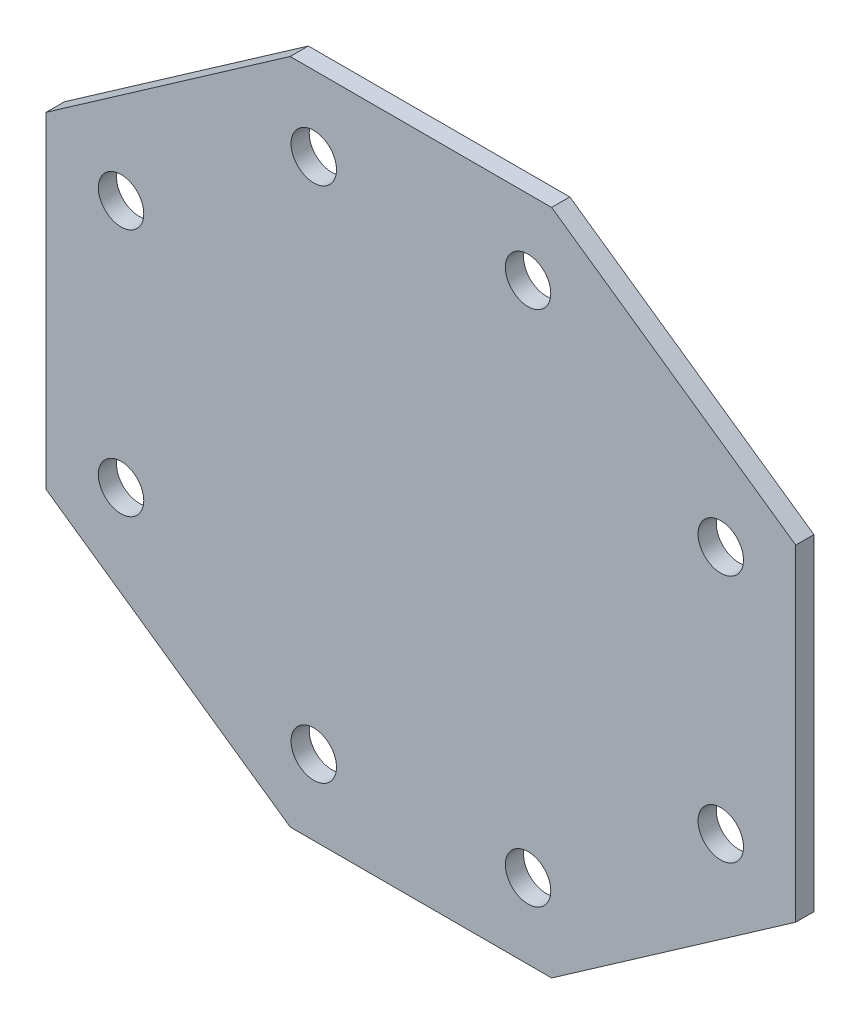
ISO-10303-21;
HEADER;
FILE_DESCRIPTION(('STEP AP214'),'2;1');
FILE_NAME('part.step','',(''),(''),'','','');
FILE_SCHEMA(('AUTOMOTIVE_DESIGN { 1 0 10303 214 1 1 1 1 }'));
ENDSEC;
DATA;
#1=APPLICATION_CONTEXT('core data for automotive mechanical design processes');
#2=APPLICATION_PROTOCOL_DEFINITION('international standard','automotive_design',2000,#1);
#3=PRODUCT_CONTEXT('',#1,'mechanical');
#4=PRODUCT('Part','Part','',(#3));
#5=PRODUCT_RELATED_PRODUCT_CATEGORY('part','',(#4));
#6=PRODUCT_DEFINITION_FORMATION('','',#4);
#7=PRODUCT_DEFINITION_CONTEXT('part definition',#1,'design');
#8=PRODUCT_DEFINITION('design','',#6,#7);
#9=PRODUCT_DEFINITION_SHAPE('','',#8);
#10=(LENGTH_UNIT() NAMED_UNIT(*) SI_UNIT(.MILLI.,.METRE.));
#11=(NAMED_UNIT(*) PLANE_ANGLE_UNIT() SI_UNIT($,.RADIAN.));
#12=(NAMED_UNIT(*) SI_UNIT($,.STERADIAN.) SOLID_ANGLE_UNIT());
#13=UNCERTAINTY_MEASURE_WITH_UNIT(LENGTH_MEASURE(1.E-05),#10,'distance_accuracy_value','');
#14=(GEOMETRIC_REPRESENTATION_CONTEXT(3) GLOBAL_UNCERTAINTY_ASSIGNED_CONTEXT((#13)) GLOBAL_UNIT_ASSIGNED_CONTEXT((#10,
#11,#12)) REPRESENTATION_CONTEXT('',''));
#15=CARTESIAN_POINT('',(0.,0.,0.));
#16=DIRECTION('',(0.,0.,1.));
#17=DIRECTION('',(1.,0.,0.));
#18=AXIS2_PLACEMENT_3D('',#15,#16,#17);
#19=CARTESIAN_POINT('',(0.,0.,0.));
#20=DIRECTION('',(0.,0.,-1.));
#21=DIRECTION('',(-1.,0.,0.));
#22=AXIS2_PLACEMENT_3D('',#19,#20,#21);
#23=PLANE('',#22);
#24=CARTESIAN_POINT('',(181.508610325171,-361.549268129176,0.));
#25=CARTESIAN_POINT('',(181.508654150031,-361.029165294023,0.));
#26=CARTESIAN_POINT('',(181.49595275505,-360.509055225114,0.));
#27=CARTESIAN_POINT('',(181.445069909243,-359.471321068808,0.));
#28=CARTESIAN_POINT('',(181.406948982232,-358.953694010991,0.));
#29=CARTESIAN_POINT('',(181.305235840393,-357.920924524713,0.));
#30=CARTESIAN_POINT('',(181.241642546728,-357.405782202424,0.));
#31=CARTESIAN_POINT('',(181.089064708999,-356.377979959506,0.));
#32=CARTESIAN_POINT('',(181.000018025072,-355.865329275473,0.));
#33=CARTESIAN_POINT('',(180.797087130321,-354.845068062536,0.));
#34=CARTESIAN_POINT('',(180.683207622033,-354.337456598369,0.));
#35=CARTESIAN_POINT('',(180.430892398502,-353.329626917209,0.));
#36=CARTESIAN_POINT('',(180.292514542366,-352.82939422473,0.));
#37=CARTESIAN_POINT('',(179.991265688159,-351.836313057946,0.));
#38=CARTESIAN_POINT('',(179.828392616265,-351.343465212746,0.));
#39=CARTESIAN_POINT('',(179.478217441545,-350.365137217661,0.));
#40=CARTESIAN_POINT('',(179.290855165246,-349.879678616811,0.));
#41=CARTESIAN_POINT('',(178.89276613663,-348.918581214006,0.));
#42=CARTESIAN_POINT('',(178.68204530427,-348.442939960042,0.));
#43=CARTESIAN_POINT('',(178.237960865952,-347.50369956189,0.));
#44=CARTESIAN_POINT('',(178.004651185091,-347.040074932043,0.));
#45=CARTESIAN_POINT('',(177.515450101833,-346.124846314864,0.));
#46=CARTESIAN_POINT('',(177.259556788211,-345.673243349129,0.));
#47=CARTESIAN_POINT('',(176.725247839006,-344.782029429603,0.));
#48=CARTESIAN_POINT('',(176.446777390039,-344.342451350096,0.));
#49=CARTESIAN_POINT('',(175.86883672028,-343.477484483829,0.));
#50=CARTESIAN_POINT('',(175.569371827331,-343.052092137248,0.));
#51=CARTESIAN_POINT('',(174.950583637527,-342.217535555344,0.));
#52=CARTESIAN_POINT('',(174.631308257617,-341.808335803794,0.));
#53=CARTESIAN_POINT('',(173.972954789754,-341.006131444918,0.));
#54=CARTESIAN_POINT('',(173.633875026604,-340.61312821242,0.));
#55=CARTESIAN_POINT('',(172.93596546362,-339.843277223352,0.));
#56=CARTESIAN_POINT('',(172.577088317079,-339.466472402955,0.));
#57=CARTESIAN_POINT('',(171.841505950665,-338.730876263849,0.));
#58=CARTESIAN_POINT('',(171.464805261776,-338.372080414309,0.));
#59=CARTESIAN_POINT('',(170.695093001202,-337.674279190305,0.));
#60=CARTESIAN_POINT('',(170.302121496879,-337.335229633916,0.));
#61=CARTESIAN_POINT('',(169.499915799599,-336.676877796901,0.));
#62=CARTESIAN_POINT('',(169.090680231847,-336.357577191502,0.));
#63=CARTESIAN_POINT('',(168.255990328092,-335.738674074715,0.));
#64=CARTESIAN_POINT('',(167.830497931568,-335.439122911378,0.));
#65=CARTESIAN_POINT('',(166.965541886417,-334.861166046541,0.));
#66=CARTESIAN_POINT('',(166.526081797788,-334.582755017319,0.));
#67=CARTESIAN_POINT('',(165.635025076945,-334.048525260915,0.));
#68=CARTESIAN_POINT('',(165.183459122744,-333.792655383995,0.));
#69=CARTESIAN_POINT('',(164.268229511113,-333.303456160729,0.));
#70=CARTESIAN_POINT('',(163.804564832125,-333.07012872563,0.));
#71=CARTESIAN_POINT('',(162.865171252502,-332.625957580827,0.));
#72=CARTESIAN_POINT('',(162.389415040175,-332.415171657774,0.));
#73=CARTESIAN_POINT('',(161.428325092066,-332.017064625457,0.));
#74=CARTESIAN_POINT('',(160.94299380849,-331.829737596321,0.));
#75=CARTESIAN_POINT('',(159.964835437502,-331.479609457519,0.));
#76=CARTESIAN_POINT('',(159.472028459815,-331.31675219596,0.));
#77=CARTESIAN_POINT('',(158.478946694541,-331.015505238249,0.));
#78=CARTESIAN_POINT('',(157.978671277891,-330.877117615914,0.));
#79=CARTESIAN_POINT('',(156.970674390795,-330.624747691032,0.));
#80=CARTESIAN_POINT('',(156.462937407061,-330.510827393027,0.));
#81=CARTESIAN_POINT('',(155.442647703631,-330.307869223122,0.));
#82=CARTESIAN_POINT('',(154.930096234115,-330.218825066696,0.));
#83=CARTESIAN_POINT('',(153.902426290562,-330.066253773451,0.));
#84=CARTESIAN_POINT('',(153.387316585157,-330.002667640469,0.));
#85=CARTESIAN_POINT('',(152.354546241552,-329.900949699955,0.));
#86=CARTESIAN_POINT('',(151.836885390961,-329.862820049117,0.));
#87=CARTESIAN_POINT('',(150.79902195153,-329.811949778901,0.));
#88=CARTESIAN_POINT('',(150.278816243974,-329.79927299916,0.));
#89=CARTESIAN_POINT('',(149.238535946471,-329.799263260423,0.));
#90=CARTESIAN_POINT('',(148.718461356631,-329.811923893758,0.));
#91=CARTESIAN_POINT('',(147.680772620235,-329.862772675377,0.));
#92=CARTESIAN_POINT('',(147.163155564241,-329.900901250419,0.));
#93=CARTESIAN_POINT('',(146.130385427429,-330.002621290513,0.));
#94=CARTESIAN_POINT('',(145.615232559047,-330.066214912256,0.));
#95=CARTESIAN_POINT('',(144.587387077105,-330.218799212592,0.));
#96=CARTESIAN_POINT('',(144.074703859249,-330.307853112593,0.));
#97=CARTESIAN_POINT('',(143.05441035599,-330.510792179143,0.));
#98=CARTESIAN_POINT('',(142.546798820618,-330.624671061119,0.));
#99=CARTESIAN_POINT('',(141.538969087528,-330.876985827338,0.));
#100=CARTESIAN_POINT('',(141.038736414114,-331.015363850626,0.));
#101=CARTESIAN_POINT('',(140.045655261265,-331.316612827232,0.));
#102=CARTESIAN_POINT('',(139.552807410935,-331.479485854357,0.));
#103=CARTESIAN_POINT('',(138.574479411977,-331.829660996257,0.));
#104=CARTESIAN_POINT('',(138.089020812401,-332.017023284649,0.));
#105=CARTESIAN_POINT('',(137.12792341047,-332.415112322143,0.));
#106=CARTESIAN_POINT('',(136.652282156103,-332.625833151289,0.));
#107=CARTESIAN_POINT('',(135.713041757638,-333.06991758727,0.));
#108=CARTESIAN_POINT('',(135.249417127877,-333.303227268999,0.));
#109=CARTESIAN_POINT('',(134.33418851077,-333.792428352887,0.));
#110=CARTESIAN_POINT('',(133.882585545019,-334.048321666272,0.));
#111=CARTESIAN_POINT('',(132.991371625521,-334.582630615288,0.));
#112=CARTESIAN_POINT('',(132.551793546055,-334.861101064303,0.));
#113=CARTESIAN_POINT('',(131.686826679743,-335.43904173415,0.));
#114=CARTESIAN_POINT('',(131.261434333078,-335.738506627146,0.));
#115=CARTESIAN_POINT('',(130.426877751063,-336.357294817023,0.));
#116=CARTESIAN_POINT('',(130.017677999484,-336.676570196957,0.));
#117=CARTESIAN_POINT('',(129.215473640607,-337.334923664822,0.));
#118=CARTESIAN_POINT('',(128.822470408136,-337.674003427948,0.));
#119=CARTESIAN_POINT('',(128.05261941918,-338.371912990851,0.));
#120=CARTESIAN_POINT('',(127.675814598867,-338.730790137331,0.));
#121=CARTESIAN_POINT('',(126.940218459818,-339.466372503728,0.));
#122=CARTESIAN_POINT('',(126.581422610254,-339.843073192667,0.));
#123=CARTESIAN_POINT('',(125.883621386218,-340.612785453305,0.));
#124=CARTESIAN_POINT('',(125.544571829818,-341.005756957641,0.));
#125=CARTESIAN_POINT('',(124.886219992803,-341.807962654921,0.));
#126=CARTESIAN_POINT('',(124.566919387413,-342.217198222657,0.));
#127=CARTESIAN_POINT('',(123.94801627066,-343.051888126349,0.));
#128=CARTESIAN_POINT('',(123.648465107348,-343.477380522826,0.));
#129=CARTESIAN_POINT('',(123.070508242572,-344.342336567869,0.));
#130=CARTESIAN_POINT('',(122.792097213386,-344.781796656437,0.));
#131=CARTESIAN_POINT('',(122.257867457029,-345.672853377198,0.));
#132=CARTESIAN_POINT('',(122.001997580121,-346.124419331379,0.));
#133=CARTESIAN_POINT('',(121.512798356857,-347.039648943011,0.));
#134=CARTESIAN_POINT('',(121.279470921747,-347.50331362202,0.));
#135=CARTESIAN_POINT('',(120.835299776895,-348.442707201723,0.));
#136=CARTESIAN_POINT('',(120.624513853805,-348.91846341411,0.));
#137=CARTESIAN_POINT('',(120.226406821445,-349.879553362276,0.));
#138=CARTESIAN_POINT('',(120.039079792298,-350.364884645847,0.));
#139=CARTESIAN_POINT('',(119.688951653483,-351.343043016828,0.));
#140=CARTESIAN_POINT('',(119.526094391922,-351.835849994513,0.));
#141=CARTESIAN_POINT('',(119.224847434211,-352.828931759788,0.));
#142=CARTESIAN_POINT('',(119.086459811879,-353.329207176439,0.));
#143=CARTESIAN_POINT('',(118.834089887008,-354.337204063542,0.));
#144=CARTESIAN_POINT('',(118.720169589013,-354.844941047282,0.));
#145=CARTESIAN_POINT('',(118.517211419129,-355.865230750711,0.));
#146=CARTESIAN_POINT('',(118.428167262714,-356.377782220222,0.));
#147=CARTESIAN_POINT('',(118.275595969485,-357.405452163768,0.));
#148=CARTESIAN_POINT('',(118.212009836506,-357.920561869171,0.));
#149=CARTESIAN_POINT('',(118.110291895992,-358.953332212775,0.));
#150=CARTESIAN_POINT('',(118.07216224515,-359.470993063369,0.));
#151=CARTESIAN_POINT('',(118.021291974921,-360.508856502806,0.));
#152=CARTESIAN_POINT('',(118.008615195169,-361.029062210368,0.));
#153=CARTESIAN_POINT('',(118.008605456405,-362.069342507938,0.));
#154=CARTESIAN_POINT('',(118.021266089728,-362.58941709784,0.));
#155=CARTESIAN_POINT('',(118.072114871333,-363.62710583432,0.));
#156=CARTESIAN_POINT('',(118.110243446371,-364.144722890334,0.));
#157=CARTESIAN_POINT('',(118.211963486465,-365.177493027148,0.));
#158=CARTESIAN_POINT('',(118.275557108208,-365.692645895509,0.));
#159=CARTESIAN_POINT('',(118.428141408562,-366.720491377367,0.));
#160=CARTESIAN_POINT('',(118.517195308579,-367.233174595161,0.));
#161=CARTESIAN_POINT('',(118.720134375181,-368.253468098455,0.));
#162=CARTESIAN_POINT('',(118.834013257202,-368.761079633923,0.));
#163=CARTESIAN_POINT('',(119.086328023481,-369.768909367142,0.));
#164=CARTESIAN_POINT('',(119.22470604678,-370.269142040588,0.));
#165=CARTESIAN_POINT('',(119.525955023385,-371.262223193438,0.));
#166=CARTESIAN_POINT('',(119.688828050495,-371.755071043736,0.));
#167=CARTESIAN_POINT('',(120.039003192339,-372.733399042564,0.));
#168=CARTESIAN_POINT('',(120.226365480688,-373.218857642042,0.));
#169=CARTESIAN_POINT('',(120.624454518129,-374.179955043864,0.));
#170=CARTESIAN_POINT('',(120.835175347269,-374.655596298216,0.));
#171=CARTESIAN_POINT('',(121.279259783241,-375.594836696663,0.));
#172=CARTESIAN_POINT('',(121.512569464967,-376.058461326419,0.));
#173=CARTESIAN_POINT('',(122.001770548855,-376.973689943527,0.));
#174=CARTESIAN_POINT('',(122.257663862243,-377.425292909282,0.));
#175=CARTESIAN_POINT('',(122.791972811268,-378.316506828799,0.));
#176=CARTESIAN_POINT('',(123.07044326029,-378.756084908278,0.));
#177=CARTESIAN_POINT('',(123.648383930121,-379.621051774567,0.));
#178=CARTESIAN_POINT('',(123.94784882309,-380.046444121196,0.));
#179=CARTESIAN_POINT('',(124.566637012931,-380.881000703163,0.));
#180=CARTESIAN_POINT('',(124.885912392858,-381.290200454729,0.));
#181=CARTESIAN_POINT('',(125.544265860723,-382.092404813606,0.));
#182=CARTESIAN_POINT('',(125.883345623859,-382.485408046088,0.));
#183=CARTESIAN_POINT('',(126.581255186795,-383.255259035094,0.));
#184=CARTESIAN_POINT('',(126.940132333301,-383.632063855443,0.));
#185=CARTESIAN_POINT('',(127.675714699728,-384.367659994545,0.));
#186=CARTESIAN_POINT('',(128.052415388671,-384.726455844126,0.));
#187=CARTESIAN_POINT('',(128.822127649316,-385.424257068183,0.));
#188=CARTESIAN_POINT('',(129.215099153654,-385.763306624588,0.));
#189=CARTESIAN_POINT('',(130.017304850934,-386.421658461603,0.));
#190=CARTESIAN_POINT('',(130.426540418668,-386.74095906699,0.));
#191=CARTESIAN_POINT('',(131.261230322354,-387.35986218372,0.));
#192=CARTESIAN_POINT('',(131.686722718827,-387.659413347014,0.));
#193=CARTESIAN_POINT('',(132.551678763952,-388.237370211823,0.));
#194=CARTESIAN_POINT('',(132.991138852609,-388.515781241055,0.));
#195=CARTESIAN_POINT('',(133.882195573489,-389.050010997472,0.));
#196=CARTESIAN_POINT('',(134.333761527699,-389.305880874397,0.));
#197=CARTESIAN_POINT('',(135.24899113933,-389.795080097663,0.));
#198=CARTESIAN_POINT('',(135.712655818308,-390.028407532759,0.));
#199=CARTESIAN_POINT('',(136.652049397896,-390.472578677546,0.));
#200=CARTESIAN_POINT('',(137.127805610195,-390.683364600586,0.));
#201=CARTESIAN_POINT('',(138.088895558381,-391.08147163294,0.));
#202=CARTESIAN_POINT('',(138.574226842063,-391.268798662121,0.));
#203=CARTESIAN_POINT('',(139.552385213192,-391.61892680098,0.));
#204=CARTESIAN_POINT('',(140.045192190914,-391.781784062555,0.));
#205=CARTESIAN_POINT('',(141.038273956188,-392.083031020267,0.));
#206=CARTESIAN_POINT('',(141.538549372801,-392.221418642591,0.));
#207=CARTESIAN_POINT('',(142.546546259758,-392.473788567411,0.));
#208=CARTESIAN_POINT('',(143.054283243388,-392.587708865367,0.));
#209=CARTESIAN_POINT('',(144.074572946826,-392.790667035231,0.));
#210=CARTESIAN_POINT('',(144.587124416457,-392.879711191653,0.));
#211=CARTESIAN_POINT('',(145.614794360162,-393.032282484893,0.));
#212=CARTESIAN_POINT('',(146.129904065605,-393.095868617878,0.));
#213=CARTESIAN_POINT('',(147.162674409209,-393.197586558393,0.));
#214=CARTESIAN_POINT('',(147.680335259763,-393.235716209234,0.));
#215=CARTESIAN_POINT('',(148.718198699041,-393.286586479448,0.));
#216=CARTESIAN_POINT('',(149.238404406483,-393.299263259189,0.));
#217=CARTESIAN_POINT('',(150.278684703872,-393.299272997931,0.));
#218=CARTESIAN_POINT('',(150.798759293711,-393.286612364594,0.));
#219=CARTESIAN_POINT('',(151.836448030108,-393.235763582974,0.));
#220=CARTESIAN_POINT('',(152.354065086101,-393.197635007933,0.));
#221=CARTESIAN_POINT('',(153.386835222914,-393.095914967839,0.));
#222=CARTESIAN_POINT('',(153.901988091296,-393.032321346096,0.));
#223=CARTESIAN_POINT('',(154.929833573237,-392.87973704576,0.));
#224=CARTESIAN_POINT('',(155.442516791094,-392.790683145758,0.));
#225=CARTESIAN_POINT('',(156.462810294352,-392.587744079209,0.));
#226=CARTESIAN_POINT('',(156.970421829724,-392.473865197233,0.));
#227=CARTESIAN_POINT('',(157.978251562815,-392.221550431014,0.));
#228=CARTESIAN_POINT('',(158.478484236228,-392.083172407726,0.));
#229=CARTESIAN_POINT('',(159.471565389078,-391.781923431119,0.));
#230=CARTESIAN_POINT('',(159.964413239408,-391.619050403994,0.));
#231=CARTESIAN_POINT('',(160.942741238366,-391.268875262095,0.));
#232=CARTESIAN_POINT('',(161.428199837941,-391.081512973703,0.));
#233=CARTESIAN_POINT('',(162.389297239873,-390.683423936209,0.));
#234=CARTESIAN_POINT('',(162.864938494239,-390.472703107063,0.));
#235=CARTESIAN_POINT('',(163.804178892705,-390.028618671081,0.));
#236=CARTESIAN_POINT('',(164.267803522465,-389.795308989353,0.));
#237=CARTESIAN_POINT('',(165.183032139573,-389.306107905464,0.));
#238=CARTESIAN_POINT('',(165.634635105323,-389.05021459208,0.));
#239=CARTESIAN_POINT('',(166.525849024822,-388.515905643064,0.));
#240=CARTESIAN_POINT('',(166.965427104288,-388.237435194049,0.));
#241=CARTESIAN_POINT('',(167.830393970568,-387.659494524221,0.));
#242=CARTESIAN_POINT('',(168.255786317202,-387.360029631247,0.));
#243=CARTESIAN_POINT('',(169.090342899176,-386.741241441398,0.));
#244=CARTESIAN_POINT('',(169.499542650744,-386.42196606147,0.));
#245=CARTESIAN_POINT('',(170.30174700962,-385.763612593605,0.));
#246=CARTESIAN_POINT('',(170.694750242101,-385.424532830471,0.));
#247=CARTESIAN_POINT('',(171.4646012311,-384.726623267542,0.));
#248=CARTESIAN_POINT('',(171.841406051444,-384.367746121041,0.));
#249=CARTESIAN_POINT('',(172.57700219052,-383.632163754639,0.));
#250=CARTESIAN_POINT('',(172.93579804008,-383.255463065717,0.));
#251=CARTESIAN_POINT('',(173.633599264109,-382.485750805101,0.));
#252=CARTESIAN_POINT('',(173.972648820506,-382.092779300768,0.));
#253=CARTESIAN_POINT('',(174.631000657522,-381.290573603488,0.));
#254=CARTESIAN_POINT('',(174.950301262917,-380.881338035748,0.));
#255=CARTESIAN_POINT('',(175.56920437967,-380.046648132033,0.));
#256=CARTESIAN_POINT('',(175.868755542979,-379.621155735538,0.));
#257=CARTESIAN_POINT('',(176.44671240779,-378.756199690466,0.));
#258=CARTESIAN_POINT('',(176.725123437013,-378.316739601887,0.));
#259=CARTESIAN_POINT('',(177.259353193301,-377.425682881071,0.));
#260=CARTESIAN_POINT('',(177.515223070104,-376.974116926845,0.));
#261=CARTESIAN_POINT('',(178.004422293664,-376.058887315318,0.));
#262=CARTESIAN_POINT('',(178.237749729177,-375.595222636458,0.));
#263=CARTESIAN_POINT('',(178.68192087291,-374.655829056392,0.));
#264=CARTESIAN_POINT('',(178.892706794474,-374.180072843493,0.));
#265=CARTESIAN_POINT('',(179.290813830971,-373.218982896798,0.));
#266=CARTESIAN_POINT('',(179.478140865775,-372.733651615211,0.));
#267=CARTESIAN_POINT('',(179.828268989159,-371.755493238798,0.));
#268=CARTESIAN_POINT('',(179.991126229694,-371.26268625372,0.));
#269=CARTESIAN_POINT('',(180.292373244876,-370.269604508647,0.));
#270=CARTESIAN_POINT('',(180.430760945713,-369.769329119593,0.));
#271=CARTESIAN_POINT('',(180.683130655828,-368.76133215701,0.));
#272=CARTESIAN_POINT('',(180.79705065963,-368.253595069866,0.));
#273=CARTESIAN_POINT('',(181.000016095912,-367.233273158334,0.));
#274=CARTESIAN_POINT('',(181.089066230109,-366.720689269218,0.));
#275=CARTESIAN_POINT('',(181.241647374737,-365.692975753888,0.));
#276=CARTESIAN_POINT('',(181.30523844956,-365.177855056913,0.));
#277=CARTESIAN_POINT('',(181.406950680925,-364.145085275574,0.));
#278=CARTESIAN_POINT('',(181.445070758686,-363.627436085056,0.));
#279=CARTESIAN_POINT('',(181.495954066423,-362.589613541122,0.));
#280=CARTESIAN_POINT('',(181.508654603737,-362.069437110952,0.));
#281=CARTESIAN_POINT('',(181.508610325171,-361.549268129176,0.));
#282=B_SPLINE_CURVE_WITH_KNOTS('',3,(#24,#25,#26,#27,#28,#29,#30,#31,#32,#33,#34,#35,#36,#37,
#38,#39,#40,#41,#42,#43,#44,#45,#46,#47,#48,#49,#50,#51,#52,#53,#54,#55,#56,#57,#58,#59,#60,#61,
#62,#63,#64,#65,#66,#67,#68,#69,#70,#71,#72,#73,#74,#75,#76,#77,#78,#79,#80,#81,#82,#83,#84,#85,
#86,#87,#88,#89,#90,#91,#92,#93,#94,#95,#96,#97,#98,#99,#100,#101,#102,#103,#104,#105,#106,#107,
#108,#109,#110,#111,#112,#113,#114,#115,#116,#117,#118,#119,#120,#121,#122,#123,#124,#125,#126,
#127,#128,#129,#130,#131,#132,#133,#134,#135,#136,#137,#138,#139,#140,#141,#142,#143,#144,#145,
#146,#147,#148,#149,#150,#151,#152,#153,#154,#155,#156,#157,#158,#159,#160,#161,#162,#163,#164,
#165,#166,#167,#168,#169,#170,#171,#172,#173,#174,#175,#176,#177,#178,#179,#180,#181,#182,#183,
#184,#185,#186,#187,#188,#189,#190,#191,#192,#193,#194,#195,#196,#197,#198,#199,#200,#201,#202,
#203,#204,#205,#206,#207,#208,#209,#210,#211,#212,#213,#214,#215,#216,#217,#218,#219,#220,#221,
#222,#223,#224,#225,#226,#227,#228,#229,#230,#231,#232,#233,#234,#235,#236,#237,#238,#239,#240,
#241,#242,#243,#244,#245,#246,#247,#248,#249,#250,#251,#252,#253,#254,#255,#256,#257,#258,#259,
#260,#261,#262,#263,#264,#265,#266,#267,#268,#269,#270,#271,#272,#273,#274,#275,#276,#277,#278,
#279,#280,#281),.UNSPECIFIED.,.F.,.F.,(4,2,2,2,2,2,2,2,2,2,2,2,2,2,2,2,2,2,2,2,2,2,2,2,2,2,2,2,
2,2,2,2,2,2,2,2,2,2,2,2,2,2,2,2,2,2,2,2,2,2,2,2,2,2,2,2,2,2,2,2,2,2,2,2,2,2,2,2,2,2,2,2,2,2,2,2,
2,2,2,2,2,2,2,2,2,2,2,2,2,2,2,2,2,2,2,2,2,2,2,2,2,2,2,2,2,2,2,2,2,2,2,2,2,2,2,2,2,2,2,2,2,2,2,2,
2,2,2,2,4),(0.,1.56016222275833,3.11662290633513,4.67314951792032,6.23350904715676,
7.79357335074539,9.35000115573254,10.9065608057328,12.4670196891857,14.0270839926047,
15.5835117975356,17.1400714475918,18.7005303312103,20.2605946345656,21.8170224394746,
23.3735820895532,24.9340409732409,26.4941052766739,28.0505330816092,29.6070927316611,
31.1675516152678,32.7276159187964,34.2840437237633,35.840603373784,37.4010622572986,
38.9611265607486,40.5175543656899,42.0741140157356,43.6345728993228,45.19463720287,
46.7510650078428,48.3076246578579,49.8680835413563,51.4281478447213,52.9845756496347,
54.5411352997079,56.1015941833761,57.6616584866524,59.2180862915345,60.7746459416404,
62.335104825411,63.895169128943,65.4515969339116,67.0081565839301,68.5686154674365,
70.1286797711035,71.6851075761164,73.2416672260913,74.8021261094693,76.3621904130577,
77.9186182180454,79.4751778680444,81.0356367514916,82.5957010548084,84.1521288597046,
85.7086885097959,87.2691473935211,88.8292116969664,90.3856395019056,91.9421991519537,
93.5026580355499,95.0627223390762,96.6191501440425,98.1757097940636,99.7361686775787,
101.29623298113,102.852660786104,104.409220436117,105.969679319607,107.529743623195,
109.086171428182,110.642731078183,112.203189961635,113.763254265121,115.319682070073,
116.876241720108,118.436700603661,119.996764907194,121.553192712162,123.109752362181,
124.670211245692,126.230275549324,127.786703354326,129.343263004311,130.903721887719,
132.463786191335,134.020213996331,135.576773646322,137.137232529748,138.697296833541,
140.253724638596,141.810284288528,143.370743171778,144.930807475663,146.487235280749,
148.04379493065,149.604253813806,151.164318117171,152.720745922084,154.277305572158,
155.837764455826,157.397828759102,158.954256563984,160.51081621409,162.071275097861,
163.631339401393,165.187767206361,166.74432685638,168.304785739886,169.864850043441,
171.421277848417,172.977837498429,174.538296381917,176.098360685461,177.654788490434,
179.211348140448,180.771807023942,182.331871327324,183.888299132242,185.444858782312,
187.005317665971,188.565381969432,190.121809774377,191.678369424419,193.238828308,
194.798991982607,196.355452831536,197.911979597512,199.472340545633),.UNSPECIFIED.);
#283=CARTESIAN_POINT('',(181.508610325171,-361.549268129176,0.));
#284=VERTEX_POINT('',#283);
#285=EDGE_CURVE('E236',#284,#284,#282,.T.);
#286=ORIENTED_EDGE('',*,*,#285,.T.);
#287=EDGE_LOOP('',(#286));
#288=FACE_BOUND('',#287,.T.);
#289=CARTESIAN_POINT('',(450.830268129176,173.588730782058,0.));
#290=CARTESIAN_POINT('',(450.830311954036,174.108833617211,0.));
#291=CARTESIAN_POINT('',(450.817610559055,174.62894368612,0.));
#292=CARTESIAN_POINT('',(450.766727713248,175.666677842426,0.));
#293=CARTESIAN_POINT('',(450.728606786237,176.184304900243,0.));
#294=CARTESIAN_POINT('',(450.626893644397,177.217074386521,0.));
#295=CARTESIAN_POINT('',(450.563300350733,177.73221670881,0.));
#296=CARTESIAN_POINT('',(450.410722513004,178.760018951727,0.));
#297=CARTESIAN_POINT('',(450.321675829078,179.272669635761,0.));
#298=CARTESIAN_POINT('',(450.118744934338,180.29293084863,0.));
#299=CARTESIAN_POINT('',(450.004865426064,180.800542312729,0.));
#300=CARTESIAN_POINT('',(449.752550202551,181.808371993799,0.));
#301=CARTESIAN_POINT('',(449.614172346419,182.308604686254,0.));
#302=CARTESIAN_POINT('',(449.312923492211,183.301685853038,0.));
#303=CARTESIAN_POINT('',(449.150050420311,183.79453369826,0.));
#304=CARTESIAN_POINT('',(448.799875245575,184.772861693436,0.));
#305=CARTESIAN_POINT('',(448.612512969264,185.258320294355,0.));
#306=CARTESIAN_POINT('',(448.214423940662,186.219417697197,0.));
#307=CARTESIAN_POINT('',(448.003703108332,186.695058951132,0.));
#308=CARTESIAN_POINT('',(447.559618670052,187.634299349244,0.));
#309=CARTESIAN_POINT('',(447.326308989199,188.097923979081,0.));
#310=CARTESIAN_POINT('',(446.83710790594,189.01315259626,0.));
#311=CARTESIAN_POINT('',(446.581214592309,189.464755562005,0.));
#312=CARTESIAN_POINT('',(446.046905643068,190.355969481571,0.));
#313=CARTESIAN_POINT('',(445.768435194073,190.795547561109,0.));
#314=CARTESIAN_POINT('',(445.190494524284,191.660514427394,0.));
#315=CARTESIAN_POINT('',(444.891029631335,192.085906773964,0.));
#316=CARTESIAN_POINT('',(444.272241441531,192.920463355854,0.));
#317=CARTESIAN_POINT('',(443.95296606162,193.329663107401,0.));
#318=CARTESIAN_POINT('',(443.294612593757,194.131867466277,0.));
#319=CARTESIAN_POINT('',(442.955532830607,194.524870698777,0.));
#320=CARTESIAN_POINT('',(442.257623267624,195.29472168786,0.));
#321=CARTESIAN_POINT('',(441.898746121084,195.671526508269,0.));
#322=CARTESIAN_POINT('',(441.163163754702,196.407122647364,0.));
#323=CARTESIAN_POINT('',(440.786463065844,196.765918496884,0.));
#324=CARTESIAN_POINT('',(440.016750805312,197.463719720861,0.));
#325=CARTESIAN_POINT('',(439.623779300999,197.802769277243,0.));
#326=CARTESIAN_POINT('',(438.821573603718,198.461121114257,0.));
#327=CARTESIAN_POINT('',(438.412338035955,198.780421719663,0.));
#328=CARTESIAN_POINT('',(437.57764813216,199.399324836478,0.));
#329=CARTESIAN_POINT('',(437.152155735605,199.698875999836,0.));
#330=CARTESIAN_POINT('',(436.287199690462,200.276832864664,0.));
#331=CARTESIAN_POINT('',(435.847739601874,200.555243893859,0.));
#332=CARTESIAN_POINT('',(434.956682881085,201.089473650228,0.));
#333=CARTESIAN_POINT('',(434.505116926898,201.345343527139,0.));
#334=CARTESIAN_POINT('',(433.589887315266,201.834542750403,0.));
#335=CARTESIAN_POINT('',(433.126222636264,202.06787018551,0.));
#336=CARTESIAN_POINT('',(432.186829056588,202.512041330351,0.));
#337=CARTESIAN_POINT('',(431.711072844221,202.722827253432,0.));
#338=CARTESIAN_POINT('',(430.749982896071,203.120934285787,0.));
#339=CARTESIAN_POINT('',(430.264651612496,203.308261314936,0.));
#340=CARTESIAN_POINT('',(429.286493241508,203.658389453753,0.));
#341=CARTESIAN_POINT('',(428.793686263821,203.821246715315,0.));
#342=CARTESIAN_POINT('',(427.800604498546,204.122493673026,0.));
#343=CARTESIAN_POINT('',(427.300329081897,204.260881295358,0.));
#344=CARTESIAN_POINT('',(426.292332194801,204.513251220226,0.));
#345=CARTESIAN_POINT('',(425.784595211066,204.627171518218,0.));
#346=CARTESIAN_POINT('',(424.764305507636,204.8301296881,0.));
#347=CARTESIAN_POINT('',(424.251754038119,204.919173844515,0.));
#348=CARTESIAN_POINT('',(423.224084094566,205.071745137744,0.));
#349=CARTESIAN_POINT('',(422.708974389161,205.135331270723,0.));
#350=CARTESIAN_POINT('',(421.676204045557,205.237049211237,0.));
#351=CARTESIAN_POINT('',(421.158543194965,205.275178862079,0.));
#352=CARTESIAN_POINT('',(420.120679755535,205.326049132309,0.));
#353=CARTESIAN_POINT('',(419.600474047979,205.338725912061,0.));
#354=CARTESIAN_POINT('',(418.560193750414,205.338735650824,0.));
#355=CARTESIAN_POINT('',(418.040119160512,205.326075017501,0.));
#356=CARTESIAN_POINT('',(417.002430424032,205.275226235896,0.));
#357=CARTESIAN_POINT('',(416.484813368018,205.237097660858,0.));
#358=CARTESIAN_POINT('',(415.452043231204,205.135377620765,0.));
#359=CARTESIAN_POINT('',(414.936890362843,205.071783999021,0.));
#360=CARTESIAN_POINT('',(413.909044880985,204.919199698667,0.));
#361=CARTESIAN_POINT('',(413.396361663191,204.830145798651,0.));
#362=CARTESIAN_POINT('',(412.376068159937,204.627206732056,0.));
#363=CARTESIAN_POINT('',(411.868456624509,204.513327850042,0.));
#364=CARTESIAN_POINT('',(410.860626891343,204.261013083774,0.));
#365=CARTESIAN_POINT('',(410.36039421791,204.122635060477,0.));
#366=CARTESIAN_POINT('',(409.367313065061,203.821386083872,0.));
#367=CARTESIAN_POINT('',(408.874465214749,203.658513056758,0.));
#368=CARTESIAN_POINT('',(407.896137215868,203.308337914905,0.));
#369=CARTESIAN_POINT('',(407.41067861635,203.120975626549,0.));
#370=CARTESIAN_POINT('',(406.449581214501,202.722886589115,0.));
#371=CARTESIAN_POINT('',(405.973939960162,202.51216575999,0.));
#372=CARTESIAN_POINT('',(405.034699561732,202.068081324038,0.));
#373=CARTESIAN_POINT('',(404.571074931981,201.834771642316,0.));
#374=CARTESIAN_POINT('',(403.655846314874,201.345570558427,0.));
#375=CARTESIAN_POINT('',(403.204243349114,201.089677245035,0.));
#376=CARTESIAN_POINT('',(402.313029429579,200.555368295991,0.));
#377=CARTESIAN_POINT('',(401.873451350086,200.276897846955,0.));
#378=CARTESIAN_POINT('',(401.008484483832,199.698957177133,0.));
#379=CARTESIAN_POINT('',(400.58309213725,199.399492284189,0.));
#380=CARTESIAN_POINT('',(399.748535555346,198.780704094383,0.));
#381=CARTESIAN_POINT('',(399.339335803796,198.461428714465,0.));
#382=CARTESIAN_POINT('',(398.53713144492,197.803075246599,0.));
#383=CARTESIAN_POINT('',(398.144128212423,197.463995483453,0.));
#384=CARTESIAN_POINT('',(397.374277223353,196.766085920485,0.));
#385=CARTESIAN_POINT('',(396.997472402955,196.407208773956,0.));
#386=CARTESIAN_POINT('',(396.261876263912,195.671626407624,0.));
#387=CARTESIAN_POINT('',(395.903080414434,195.294925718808,0.));
#388=CARTESIAN_POINT('',(395.205279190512,194.525213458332,0.));
#389=CARTESIAN_POINT('',(394.866229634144,194.132241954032,0.));
#390=CARTESIAN_POINT('',(394.207877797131,193.330036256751,0.));
#391=CARTESIAN_POINT('',(393.888577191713,192.920800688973,0.));
#392=CARTESIAN_POINT('',(393.26967407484,192.086110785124,0.));
#393=CARTESIAN_POINT('',(392.970122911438,191.66061838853,0.));
#394=CARTESIAN_POINT('',(392.392166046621,190.795662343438,0.));
#395=CARTESIAN_POINT('',(392.113755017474,190.356202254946,0.));
#396=CARTESIAN_POINT('',(391.579525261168,189.465145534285,0.));
#397=CARTESIAN_POINT('',(391.323655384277,189.013579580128,0.));
#398=CARTESIAN_POINT('',(390.834456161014,188.098349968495,0.));
#399=CARTESIAN_POINT('',(390.601128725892,187.634685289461,0.));
#400=CARTESIAN_POINT('',(390.156957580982,186.695291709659,0.));
#401=CARTESIAN_POINT('',(389.94617165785,186.219535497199,0.));
#402=CARTESIAN_POINT('',(389.548064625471,185.258445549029,0.));
#403=CARTESIAN_POINT('',(389.360737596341,184.773114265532,0.));
#404=CARTESIAN_POINT('',(389.010609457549,183.794955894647,0.));
#405=CARTESIAN_POINT('',(388.847752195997,183.302148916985,0.));
#406=CARTESIAN_POINT('',(388.546505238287,182.30906715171,0.));
#407=CARTESIAN_POINT('',(388.40811761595,181.808791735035,0.));
#408=CARTESIAN_POINT('',(388.155747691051,180.800794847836,0.));
#409=CARTESIAN_POINT('',(388.041827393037,180.293057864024,0.));
#410=CARTESIAN_POINT('',(387.838869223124,179.272768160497,0.));
#411=CARTESIAN_POINT('',(387.749825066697,178.76021669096,0.));
#412=CARTESIAN_POINT('',(387.597253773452,177.73254674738,0.));
#413=CARTESIAN_POINT('',(387.53366764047,177.217437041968,0.));
#414=CARTESIAN_POINT('',(387.431949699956,176.184666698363,0.));
#415=CARTESIAN_POINT('',(387.393820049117,175.667005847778,0.));
#416=CARTESIAN_POINT('',(387.342949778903,174.629142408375,0.));
#417=CARTESIAN_POINT('',(387.330272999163,174.10893670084,0.));
#418=CARTESIAN_POINT('',(387.330263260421,173.068656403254,0.));
#419=CARTESIAN_POINT('',(387.342923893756,172.54858181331,0.));
#420=CARTESIAN_POINT('',(387.393772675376,171.510893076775,0.));
#421=CARTESIAN_POINT('',(387.431901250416,170.993276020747,0.));
#422=CARTESIAN_POINT('',(387.533621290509,169.960505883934,0.));
#423=CARTESIAN_POINT('',(387.597214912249,169.445353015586,0.));
#424=CARTESIAN_POINT('',(387.749799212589,168.417507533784,0.));
#425=CARTESIAN_POINT('',(387.838853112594,167.904824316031,0.));
#426=CARTESIAN_POINT('',(388.041792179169,166.884530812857,0.));
#427=CARTESIAN_POINT('',(388.155671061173,166.376919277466,0.));
#428=CARTESIAN_POINT('',(388.407985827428,165.36908954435,0.));
#429=CARTESIAN_POINT('',(388.546363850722,164.86885687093,0.));
#430=CARTESIAN_POINT('',(388.847612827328,163.875775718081,0.));
#431=CARTESIAN_POINT('',(389.010485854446,163.382927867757,0.));
#432=CARTESIAN_POINT('',(389.360660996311,162.404599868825,0.));
#433=CARTESIAN_POINT('',(389.548023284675,161.919141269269,0.));
#434=CARTESIAN_POINT('',(389.946112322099,160.958043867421,0.));
#435=CARTESIAN_POINT('',(390.1568331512,160.482402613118,0.));
#436=CARTESIAN_POINT('',(390.600917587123,159.543162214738,0.));
#437=CARTESIAN_POINT('',(390.834227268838,159.079537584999,0.));
#438=CARTESIAN_POINT('',(391.323428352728,158.164308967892,0.));
#439=CARTESIAN_POINT('',(391.579321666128,157.712706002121,0.));
#440=CARTESIAN_POINT('',(392.1136306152,156.821492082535,0.));
#441=CARTESIAN_POINT('',(392.392101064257,156.381914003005,0.));
#442=CARTESIAN_POINT('',(392.970041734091,155.516947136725,0.));
#443=CARTESIAN_POINT('',(393.269506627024,155.091554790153,0.));
#444=CARTESIAN_POINT('',(393.888294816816,154.256998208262,0.));
#445=CARTESIAN_POINT('',(394.207570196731,153.847798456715,0.));
#446=CARTESIAN_POINT('',(394.865923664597,153.045594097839,0.));
#447=CARTESIAN_POINT('',(395.205003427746,152.652590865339,0.));
#448=CARTESIAN_POINT('',(395.902912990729,151.882739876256,0.));
#449=CARTESIAN_POINT('',(396.261790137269,151.505935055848,0.));
#450=CARTESIAN_POINT('',(396.997372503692,150.77033891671,0.));
#451=CARTESIAN_POINT('',(397.374073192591,150.411543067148,0.));
#452=CARTESIAN_POINT('',(398.143785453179,149.713741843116,0.));
#453=CARTESIAN_POINT('',(398.536756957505,149.374692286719,0.));
#454=CARTESIAN_POINT('',(399.338962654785,148.716340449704,0.));
#455=CARTESIAN_POINT('',(399.748198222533,148.397039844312,0.));
#456=CARTESIAN_POINT('',(400.582888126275,147.778136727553,0.));
#457=CARTESIAN_POINT('',(401.008380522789,147.478585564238,0.));
#458=CARTESIAN_POINT('',(401.873336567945,146.900628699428,0.));
#459=CARTESIAN_POINT('',(402.312796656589,146.622217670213,0.));
#460=CARTESIAN_POINT('',(403.20385337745,146.087987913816,0.));
#461=CARTESIAN_POINT('',(403.655419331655,145.832118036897,0.));
#462=CARTESIAN_POINT('',(404.570648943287,145.342918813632,0.));
#463=CARTESIAN_POINT('',(405.034313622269,145.109591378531,0.));
#464=CARTESIAN_POINT('',(405.973707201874,144.665420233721,0.));
#465=CARTESIAN_POINT('',(406.449463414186,144.454634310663,0.));
#466=CARTESIAN_POINT('',(407.4105533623,144.05652727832,0.));
#467=CARTESIAN_POINT('',(407.895884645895,143.869200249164,0.));
#468=CARTESIAN_POINT('',(408.874043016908,143.519072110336,0.));
#469=CARTESIAN_POINT('',(409.366849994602,143.356214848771,0.));
#470=CARTESIAN_POINT('',(410.359931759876,143.05496789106,0.));
#471=CARTESIAN_POINT('',(410.860207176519,142.916580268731,0.));
#472=CARTESIAN_POINT('',(411.86820406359,142.664210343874,0.));
#473=CARTESIAN_POINT('',(412.375941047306,142.55029004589,0.));
#474=CARTESIAN_POINT('',(413.396230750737,142.347331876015,0.));
#475=CARTESIAN_POINT('',(413.908782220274,142.258287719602,0.));
#476=CARTESIAN_POINT('',(414.936452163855,142.105716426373,0.));
#477=CARTESIAN_POINT('',(415.451561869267,142.042130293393,0.));
#478=CARTESIAN_POINT('',(416.484332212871,141.940412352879,0.));
#479=CARTESIAN_POINT('',(417.001993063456,141.902282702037,0.));
#480=CARTESIAN_POINT('',(418.039856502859,141.851412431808,0.));
#481=CARTESIAN_POINT('',(418.560062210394,141.838735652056,0.));
#482=CARTESIAN_POINT('',(419.600342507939,141.838725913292,0.));
#483=CARTESIAN_POINT('',(420.120417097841,141.851386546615,0.));
#484=CARTESIAN_POINT('',(421.158105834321,141.90223532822,0.));
#485=CARTESIAN_POINT('',(421.675722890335,141.940363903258,0.));
#486=CARTESIAN_POINT('',(422.708493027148,142.042083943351,0.));
#487=CARTESIAN_POINT('',(423.22364589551,142.105677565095,0.));
#488=CARTESIAN_POINT('',(424.251491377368,142.258261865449,0.));
#489=CARTESIAN_POINT('',(424.764174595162,142.347315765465,0.));
#490=CARTESIAN_POINT('',(425.784468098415,142.55025483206,0.));
#491=CARTESIAN_POINT('',(426.292079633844,142.664133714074,0.));
#492=CARTESIAN_POINT('',(427.29990936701,142.916448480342,0.));
#493=CARTESIAN_POINT('',(427.800142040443,143.054826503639,0.));
#494=CARTESIAN_POINT('',(428.793223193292,143.356075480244,0.));
#495=CARTESIAN_POINT('',(429.286071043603,143.518948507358,0.));
#496=CARTESIAN_POINT('',(430.264399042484,143.869123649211,0.));
#497=CARTESIAN_POINT('',(430.749857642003,144.056485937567,0.));
#498=CARTESIAN_POINT('',(431.710955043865,144.454574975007,0.));
#499=CARTESIAN_POINT('',(432.186596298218,144.665295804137,0.));
#500=CARTESIAN_POINT('',(433.125836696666,145.109380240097,0.));
#501=CARTESIAN_POINT('',(433.589461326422,145.34268992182,0.));
#502=CARTESIAN_POINT('',(434.504689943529,145.831891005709,0.));
#503=CARTESIAN_POINT('',(434.956292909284,146.087784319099,0.));
#504=CARTESIAN_POINT('',(435.847506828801,146.622093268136,0.));
#505=CARTESIAN_POINT('',(436.28708490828,146.900563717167,0.));
#506=CARTESIAN_POINT('',(437.152051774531,147.478504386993,0.));
#507=CARTESIAN_POINT('',(437.577444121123,147.777969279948,0.));
#508=CARTESIAN_POINT('',(438.412000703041,148.396757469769,0.));
#509=CARTESIAN_POINT('',(438.821200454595,148.71603284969,0.));
#510=CARTESIAN_POINT('',(439.623404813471,149.374386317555,0.));
#511=CARTESIAN_POINT('',(440.016408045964,149.713466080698,0.));
#512=CARTESIAN_POINT('',(440.78625903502,150.411375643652,0.));
#513=CARTESIAN_POINT('',(441.163063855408,150.770252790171,0.));
#514=CARTESIAN_POINT('',(441.898659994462,151.505835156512,0.));
#515=CARTESIAN_POINT('',(442.257455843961,151.882535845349,0.));
#516=CARTESIAN_POINT('',(442.95525706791,152.652248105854,0.));
#517=CARTESIAN_POINT('',(443.294306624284,153.04521961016,0.));
#518=CARTESIAN_POINT('',(443.9526584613,153.847425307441,0.));
#519=CARTESIAN_POINT('',(444.271959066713,154.25666087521,0.));
#520=CARTESIAN_POINT('',(444.890862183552,155.091350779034,0.));
#521=CARTESIAN_POINT('',(445.190413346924,155.516843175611,0.));
#522=CARTESIAN_POINT('',(445.768370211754,156.381799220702,0.));
#523=CARTESIAN_POINT('',(446.04678124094,156.821259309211,0.));
#524=CARTESIAN_POINT('',(446.58101099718,157.712316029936,0.));
#525=CARTESIAN_POINT('',(446.836880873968,158.163881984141,0.));
#526=CARTESIAN_POINT('',(447.326080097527,159.079111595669,0.));
#527=CARTESIAN_POINT('',(447.55940753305,159.542776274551,0.));
#528=CARTESIAN_POINT('',(448.003578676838,160.482169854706,0.));
#529=CARTESIAN_POINT('',(448.214364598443,160.957926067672,0.));
#530=CARTESIAN_POINT('',(448.612471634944,161.91901601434,0.));
#531=CARTESIAN_POINT('',(448.799798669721,162.404347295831,0.));
#532=CARTESIAN_POINT('',(449.149926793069,163.382505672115,0.));
#533=CARTESIAN_POINT('',(449.312784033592,163.875312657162,0.));
#534=CARTESIAN_POINT('',(449.614031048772,164.868394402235,0.));
#535=CARTESIAN_POINT('',(449.752418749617,165.368669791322,0.));
#536=CARTESIAN_POINT('',(450.004788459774,166.376666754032,0.));
#537=CARTESIAN_POINT('',(450.118708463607,166.884403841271,0.));
#538=CARTESIAN_POINT('',(450.321673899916,167.904725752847,0.));
#539=CARTESIAN_POINT('',(450.410724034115,168.417309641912,0.));
#540=CARTESIAN_POINT('',(450.563305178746,169.445023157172,0.));
#541=CARTESIAN_POINT('',(450.626896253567,169.96014385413,0.));
#542=CARTESIAN_POINT('',(450.728608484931,170.992913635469,0.));
#543=CARTESIAN_POINT('',(450.766728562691,171.510562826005,0.));
#544=CARTESIAN_POINT('',(450.817611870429,172.548385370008,0.));
#545=CARTESIAN_POINT('',(450.830312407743,173.068561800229,0.));
#546=CARTESIAN_POINT('',(450.830268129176,173.588730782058,0.));
#547=B_SPLINE_CURVE_WITH_KNOTS('',3,(#289,#290,#291,#292,#293,#294,#295,#296,#297,#298,#299,
#300,#301,#302,#303,#304,#305,#306,#307,#308,#309,#310,#311,#312,#313,#314,#315,#316,#317,#318,
#319,#320,#321,#322,#323,#324,#325,#326,#327,#328,#329,#330,#331,#332,#333,#334,#335,#336,#337,
#338,#339,#340,#341,#342,#343,#344,#345,#346,#347,#348,#349,#350,#351,#352,#353,#354,#355,#356,
#357,#358,#359,#360,#361,#362,#363,#364,#365,#366,#367,#368,#369,#370,#371,#372,#373,#374,#375,
#376,#377,#378,#379,#380,#381,#382,#383,#384,#385,#386,#387,#388,#389,#390,#391,#392,#393,#394,
#395,#396,#397,#398,#399,#400,#401,#402,#403,#404,#405,#406,#407,#408,#409,#410,#411,#412,#413,
#414,#415,#416,#417,#418,#419,#420,#421,#422,#423,#424,#425,#426,#427,#428,#429,#430,#431,#432,
#433,#434,#435,#436,#437,#438,#439,#440,#441,#442,#443,#444,#445,#446,#447,#448,#449,#450,#451,
#452,#453,#454,#455,#456,#457,#458,#459,#460,#461,#462,#463,#464,#465,#466,#467,#468,#469,#470,
#471,#472,#473,#474,#475,#476,#477,#478,#479,#480,#481,#482,#483,#484,#485,#486,#487,#488,#489,
#490,#491,#492,#493,#494,#495,#496,#497,#498,#499,#500,#501,#502,#503,#504,#505,#506,#507,#508,
#509,#510,#511,#512,#513,#514,#515,#516,#517,#518,#519,#520,#521,#522,#523,#524,#525,#526,#527,
#528,#529,#530,#531,#532,#533,#534,#535,#536,#537,#538,#539,#540,#541,#542,#543,#544,#545,#546),
.UNSPECIFIED.,.F.,.F.,(4,2,2,2,2,2,2,2,2,2,2,2,2,2,2,2,2,2,2,2,2,2,2,2,2,2,2,2,2,2,2,2,2,2,2,2,
2,2,2,2,2,2,2,2,2,2,2,2,2,2,2,2,2,2,2,2,2,2,2,2,2,2,2,2,2,2,2,2,2,2,2,2,2,2,2,2,2,2,2,2,2,2,2,2,
2,2,2,2,2,2,2,2,2,2,2,2,2,2,2,2,2,2,2,2,2,2,2,2,2,2,2,2,2,2,2,2,2,2,2,2,2,2,2,2,2,2,2,2,4),(0.,
1.56016222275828,3.1166229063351,4.67314951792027,6.23350904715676,7.7935733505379,
9.35000115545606,10.906560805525,12.4670196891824,14.0270839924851,15.5835117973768,
17.1400714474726,18.7005303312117,20.2605946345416,21.8170224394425,23.3735820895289,
24.9340409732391,26.4941052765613,28.0505330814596,29.6070927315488,31.1675516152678,
32.7276159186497,34.2840437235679,35.8406033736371,37.4010622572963,38.9611265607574,
40.517554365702,42.0741140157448,43.6345728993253,45.1946372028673,46.7510650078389,
48.3076246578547,49.8680835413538,51.4281478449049,52.9845756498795,54.5411352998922,
56.1015941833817,57.6616584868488,59.2180862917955,60.774645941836,62.3351048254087,
63.89516912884,65.4515969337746,67.0081565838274,68.5686154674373,70.1286797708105,
71.6851075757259,73.2416672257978,74.802126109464,76.3621904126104,77.91861821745,
79.4751778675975,81.0356367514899,82.5957010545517,84.1521288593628,85.7086885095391,
87.2691473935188,88.8292116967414,90.3856395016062,91.942199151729,93.5026580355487,
95.0627223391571,96.6191501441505,98.1757097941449,99.7361686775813,101.296232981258,
102.852660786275,104.409220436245,105.969679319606,107.529743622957,109.086171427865,
110.642731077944,112.203189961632,113.763254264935,115.319682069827,116.876241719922,
118.436700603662,119.996764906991,121.553192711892,123.109752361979,124.670211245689,
126.230275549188,127.786703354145,129.343263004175,130.90372188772,132.463786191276,
134.020213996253,135.576773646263,137.137232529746,138.697296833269,140.253724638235,
141.810284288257,143.370743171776,144.930807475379,146.487235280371,148.043794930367,
149.604253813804,151.164318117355,152.720745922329,154.277305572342,155.837764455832,
157.397828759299,158.954256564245,160.510816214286,162.071275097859,163.631339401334,
165.187767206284,166.744326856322,168.304785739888,169.864850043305,171.421277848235,
172.977837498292,174.538296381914,176.098360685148,177.654788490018,179.211348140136,
180.771807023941,182.33187132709,183.88829913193,185.444858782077,187.005317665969,
188.565381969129,190.121809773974,191.678369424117,193.238828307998,194.798991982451,
196.355452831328,197.911979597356,199.472340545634),.UNSPECIFIED.);
#548=CARTESIAN_POINT('',(450.830268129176,173.588730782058,0.));
#549=VERTEX_POINT('',#548);
#550=EDGE_CURVE('E456',#549,#549,#547,.T.);
#551=ORIENTED_EDGE('',*,*,#550,.T.);
#552=EDGE_LOOP('',(#551));
#553=FACE_BOUND('',#552,.T.);
#554=CARTESIAN_POINT('',(-118.008610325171,361.549268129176,0.));
#555=CARTESIAN_POINT('',(-118.008566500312,362.069370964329,0.));
#556=CARTESIAN_POINT('',(-118.021267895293,362.589481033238,0.));
#557=CARTESIAN_POINT('',(-118.072150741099,363.627215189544,0.));
#558=CARTESIAN_POINT('',(-118.11027166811,364.144842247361,0.));
#559=CARTESIAN_POINT('',(-118.21198480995,365.177611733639,0.));
#560=CARTESIAN_POINT('',(-118.275578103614,365.692754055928,0.));
#561=CARTESIAN_POINT('',(-118.428155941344,366.720556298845,0.));
#562=CARTESIAN_POINT('',(-118.517202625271,367.233206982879,0.));
#563=CARTESIAN_POINT('',(-118.720133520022,368.253468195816,0.));
#564=CARTESIAN_POINT('',(-118.834013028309,368.761079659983,0.));
#565=CARTESIAN_POINT('',(-119.086328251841,369.768909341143,0.));
#566=CARTESIAN_POINT('',(-119.224706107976,370.269142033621,0.));
#567=CARTESIAN_POINT('',(-119.525954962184,371.262223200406,0.));
#568=CARTESIAN_POINT('',(-119.688828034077,371.755071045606,0.));
#569=CARTESIAN_POINT('',(-120.039003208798,372.73339904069,0.));
#570=CARTESIAN_POINT('',(-120.226365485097,373.218857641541,0.));
#571=CARTESIAN_POINT('',(-120.624454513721,374.179955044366,0.));
#572=CARTESIAN_POINT('',(-120.835175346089,374.655596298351,0.));
#573=CARTESIAN_POINT('',(-121.279259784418,375.594836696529,0.));
#574=CARTESIAN_POINT('',(-121.512569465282,376.058461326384,0.));
#575=CARTESIAN_POINT('',(-122.00177054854,376.973689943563,0.));
#576=CARTESIAN_POINT('',(-122.257663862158,377.425292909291,0.));
#577=CARTESIAN_POINT('',(-122.791972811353,378.316506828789,0.));
#578=CARTESIAN_POINT('',(-123.070443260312,378.756084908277,0.));
#579=CARTESIAN_POINT('',(-123.648383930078,379.621051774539,0.));
#580=CARTESIAN_POINT('',(-123.947848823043,380.046444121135,0.));
#581=CARTESIAN_POINT('',(-124.566637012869,380.881000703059,0.));
#582=CARTESIAN_POINT('',(-124.885912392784,381.290200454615,0.));
#583=CARTESIAN_POINT('',(-125.544265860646,382.092404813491,0.));
#584=CARTESIAN_POINT('',(-125.883345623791,382.485408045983,0.));
#585=CARTESIAN_POINT('',(-126.581255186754,383.255259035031,0.));
#586=CARTESIAN_POINT('',(-126.94013233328,383.632063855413,0.));
#587=CARTESIAN_POINT('',(-127.675714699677,384.367659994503,0.));
#588=CARTESIAN_POINT('',(-128.052415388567,384.726455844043,0.));
#589=CARTESIAN_POINT('',(-128.822127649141,385.424257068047,0.));
#590=CARTESIAN_POINT('',(-129.215099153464,385.763306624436,0.));
#591=CARTESIAN_POINT('',(-130.017304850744,386.421658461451,0.));
#592=CARTESIAN_POINT('',(-130.426540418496,386.74095906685,0.));
#593=CARTESIAN_POINT('',(-131.261230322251,387.359862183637,0.));
#594=CARTESIAN_POINT('',(-131.686722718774,387.659413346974,0.));
#595=CARTESIAN_POINT('',(-132.551678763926,388.237370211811,0.));
#596=CARTESIAN_POINT('',(-132.991138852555,388.515781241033,0.));
#597=CARTESIAN_POINT('',(-133.882195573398,389.050010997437,0.));
#598=CARTESIAN_POINT('',(-134.333761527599,389.305880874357,0.));
#599=CARTESIAN_POINT('',(-135.24899113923,389.795080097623,0.));
#600=CARTESIAN_POINT('',(-135.712655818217,390.028407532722,0.));
#601=CARTESIAN_POINT('',(-136.652049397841,390.472578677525,0.));
#602=CARTESIAN_POINT('',(-137.127805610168,390.683364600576,0.));
#603=CARTESIAN_POINT('',(-138.088895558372,391.081471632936,0.));
#604=CARTESIAN_POINT('',(-138.574226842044,391.268798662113,0.));
#605=CARTESIAN_POINT('',(-139.552385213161,391.618926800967,0.));
#606=CARTESIAN_POINT('',(-140.045192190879,391.781784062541,0.));
#607=CARTESIAN_POINT('',(-141.038273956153,392.083031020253,0.));
#608=CARTESIAN_POINT('',(-141.53854937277,392.221418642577,0.));
#609=CARTESIAN_POINT('',(-142.546546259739,392.473788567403,0.));
#610=CARTESIAN_POINT('',(-143.054283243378,392.587708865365,0.));
#611=CARTESIAN_POINT('',(-144.074572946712,392.790667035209,0.));
#612=CARTESIAN_POINT('',(-144.587124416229,392.87971119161,0.));
#613=CARTESIAN_POINT('',(-145.614794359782,393.032282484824,0.));
#614=CARTESIAN_POINT('',(-146.129904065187,393.0958686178,0.));
#615=CARTESIAN_POINT('',(-147.162674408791,393.197586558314,0.));
#616=CARTESIAN_POINT('',(-147.680335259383,393.235716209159,0.));
#617=CARTESIAN_POINT('',(-148.718198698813,393.286586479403,0.));
#618=CARTESIAN_POINT('',(-149.238404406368,393.299263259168,0.));
#619=CARTESIAN_POINT('',(-150.278684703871,393.299272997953,0.));
#620=CARTESIAN_POINT('',(-150.798759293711,393.286612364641,0.));
#621=CARTESIAN_POINT('',(-151.836448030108,393.235763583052,0.));
#622=CARTESIAN_POINT('',(-152.354065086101,393.197635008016,0.));
#623=CARTESIAN_POINT('',(-153.386835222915,393.095914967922,0.));
#624=CARTESIAN_POINT('',(-153.901988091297,393.032321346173,0.));
#625=CARTESIAN_POINT('',(-154.929833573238,392.879737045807,0.));
#626=CARTESIAN_POINT('',(-155.442516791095,392.79068314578,0.));
#627=CARTESIAN_POINT('',(-156.462810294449,392.587744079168,0.));
#628=CARTESIAN_POINT('',(-156.970421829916,392.47386519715,0.));
#629=CARTESIAN_POINT('',(-157.978251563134,392.221550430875,0.));
#630=CARTESIAN_POINT('',(-158.478484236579,392.083172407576,0.));
#631=CARTESIAN_POINT('',(-159.471565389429,391.781923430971,0.));
#632=CARTESIAN_POINT('',(-159.964413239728,391.619050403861,0.));
#633=CARTESIAN_POINT('',(-160.942741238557,391.268875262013,0.));
#634=CARTESIAN_POINT('',(-161.428199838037,391.081512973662,0.));
#635=CARTESIAN_POINT('',(-162.389297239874,390.683423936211,0.));
#636=CARTESIAN_POINT('',(-162.86493849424,390.472703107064,0.));
#637=CARTESIAN_POINT('',(-163.804178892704,390.028618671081,0.));
#638=CARTESIAN_POINT('',(-164.267803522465,389.795308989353,0.));
#639=CARTESIAN_POINT('',(-165.183032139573,389.306107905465,0.));
#640=CARTESIAN_POINT('',(-165.634635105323,389.05021459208,0.));
#641=CARTESIAN_POINT('',(-166.525849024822,388.515905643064,0.));
#642=CARTESIAN_POINT('',(-166.965427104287,388.237435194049,0.));
#643=CARTESIAN_POINT('',(-167.8303939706,387.659494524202,0.));
#644=CARTESIAN_POINT('',(-168.255786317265,387.360029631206,0.));
#645=CARTESIAN_POINT('',(-169.09034289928,386.741241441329,0.));
#646=CARTESIAN_POINT('',(-169.499542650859,386.421966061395,0.));
#647=CARTESIAN_POINT('',(-170.301747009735,385.76361259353,0.));
#648=CARTESIAN_POINT('',(-170.694750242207,385.424532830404,0.));
#649=CARTESIAN_POINT('',(-171.464601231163,384.726623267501,0.));
#650=CARTESIAN_POINT('',(-171.841406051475,384.36774612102,0.));
#651=CARTESIAN_POINT('',(-172.577002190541,383.632163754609,0.));
#652=CARTESIAN_POINT('',(-172.93579804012,383.255463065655,0.));
#653=CARTESIAN_POINT('',(-173.633599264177,382.485750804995,0.));
#654=CARTESIAN_POINT('',(-173.972648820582,382.092779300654,0.));
#655=CARTESIAN_POINT('',(-174.631000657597,381.290573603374,0.));
#656=CARTESIAN_POINT('',(-174.950301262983,380.881338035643,0.));
#657=CARTESIAN_POINT('',(-175.569204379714,380.046648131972,0.));
#658=CARTESIAN_POINT('',(-175.86875554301,379.621155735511,0.));
#659=CARTESIAN_POINT('',(-176.44671240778,378.756199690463,0.));
#660=CARTESIAN_POINT('',(-176.725123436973,378.316739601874,0.));
#661=CARTESIAN_POINT('',(-177.259353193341,377.425682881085,0.));
#662=CARTESIAN_POINT('',(-177.515223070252,376.974116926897,0.));
#663=CARTESIAN_POINT('',(-178.004422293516,376.058887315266,0.));
#664=CARTESIAN_POINT('',(-178.237749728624,375.595222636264,0.));
#665=CARTESIAN_POINT('',(-178.681920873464,374.655829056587,0.));
#666=CARTESIAN_POINT('',(-178.892706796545,374.180072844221,0.));
#667=CARTESIAN_POINT('',(-179.290813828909,373.218982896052,0.));
#668=CARTESIAN_POINT('',(-179.478140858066,372.733651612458,0.));
#669=CARTESIAN_POINT('',(-179.828268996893,371.755493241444,0.));
#670=CARTESIAN_POINT('',(-179.991126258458,371.262686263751,0.));
#671=CARTESIAN_POINT('',(-180.292373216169,370.269604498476,0.));
#672=CARTESIAN_POINT('',(-180.430760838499,369.769329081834,0.));
#673=CARTESIAN_POINT('',(-180.683130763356,368.761332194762,0.));
#674=CARTESIAN_POINT('',(-180.797051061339,368.253595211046,0.));
#675=CARTESIAN_POINT('',(-181.000009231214,367.233305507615,0.));
#676=CARTESIAN_POINT('',(-181.089053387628,366.720754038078,0.));
#677=CARTESIAN_POINT('',(-181.241624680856,365.693084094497,0.));
#678=CARTESIAN_POINT('',(-181.305210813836,365.177974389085,0.));
#679=CARTESIAN_POINT('',(-181.40692875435,364.145204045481,0.));
#680=CARTESIAN_POINT('',(-181.445058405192,363.627543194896,0.));
#681=CARTESIAN_POINT('',(-181.495928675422,362.589679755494,0.));
#682=CARTESIAN_POINT('',(-181.508605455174,362.069474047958,0.));
#683=CARTESIAN_POINT('',(-181.508615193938,361.029193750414,0.));
#684=CARTESIAN_POINT('',(-181.495954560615,360.509119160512,0.));
#685=CARTESIAN_POINT('',(-181.445105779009,359.471430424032,0.));
#686=CARTESIAN_POINT('',(-181.406977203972,358.953813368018,0.));
#687=CARTESIAN_POINT('',(-181.305257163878,357.921043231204,0.));
#688=CARTESIAN_POINT('',(-181.241663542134,357.405890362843,0.));
#689=CARTESIAN_POINT('',(-181.08907924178,356.378044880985,0.));
#690=CARTESIAN_POINT('',(-181.000025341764,355.865361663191,0.));
#691=CARTESIAN_POINT('',(-180.797086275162,354.845068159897,0.));
#692=CARTESIAN_POINT('',(-180.68320739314,354.337456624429,0.));
#693=CARTESIAN_POINT('',(-180.430892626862,353.32962689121,0.));
#694=CARTESIAN_POINT('',(-180.292514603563,352.829394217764,0.));
#695=CARTESIAN_POINT('',(-179.991265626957,351.836313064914,0.));
#696=CARTESIAN_POINT('',(-179.828392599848,351.343465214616,0.));
#697=CARTESIAN_POINT('',(-179.478217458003,350.365137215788,0.));
#698=CARTESIAN_POINT('',(-179.290855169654,349.87967861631,0.));
#699=CARTESIAN_POINT('',(-178.892766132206,348.918581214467,0.));
#700=CARTESIAN_POINT('',(-178.682045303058,348.442939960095,0.));
#701=CARTESIAN_POINT('',(-178.237960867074,347.503699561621,0.));
#702=CARTESIAN_POINT('',(-178.004651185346,347.040074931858,0.));
#703=CARTESIAN_POINT('',(-177.515450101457,346.12484631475,0.));
#704=CARTESIAN_POINT('',(-177.259556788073,345.673243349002,0.));
#705=CARTESIAN_POINT('',(-176.725247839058,344.782029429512,0.));
#706=CARTESIAN_POINT('',(-176.446777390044,344.342451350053,0.));
#707=CARTESIAN_POINT('',(-175.868836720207,343.477484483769,0.));
#708=CARTESIAN_POINT('',(-175.569371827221,343.052092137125,0.));
#709=CARTESIAN_POINT('',(-174.950583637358,342.217535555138,0.));
#710=CARTESIAN_POINT('',(-174.631308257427,341.808335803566,0.));
#711=CARTESIAN_POINT('',(-173.972954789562,341.00613144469,0.));
#712=CARTESIAN_POINT('',(-173.633875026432,340.613128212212,0.));
#713=CARTESIAN_POINT('',(-172.935965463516,339.843277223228,0.));
#714=CARTESIAN_POINT('',(-172.577088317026,339.466472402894,0.));
#715=CARTESIAN_POINT('',(-171.841505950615,338.730876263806,0.));
#716=CARTESIAN_POINT('',(-171.464805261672,338.372080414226,0.));
#717=CARTESIAN_POINT('',(-170.695093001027,337.674279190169,0.));
#718=CARTESIAN_POINT('',(-170.302121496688,337.335229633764,0.));
#719=CARTESIAN_POINT('',(-169.499915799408,336.676877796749,0.));
#720=CARTESIAN_POINT('',(-169.090680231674,336.357577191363,0.));
#721=CARTESIAN_POINT('',(-168.255990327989,335.738674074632,0.));
#722=CARTESIAN_POINT('',(-167.830497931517,335.439122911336,0.));
#723=CARTESIAN_POINT('',(-166.965541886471,334.861166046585,0.));
#724=CARTESIAN_POINT('',(-166.526081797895,334.582755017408,0.));
#725=CARTESIAN_POINT('',(-165.635025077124,334.048525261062,0.));
#726=CARTESIAN_POINT('',(-165.183459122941,333.792655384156,0.));
#727=CARTESIAN_POINT('',(-164.268229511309,333.303456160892,0.));
#728=CARTESIAN_POINT('',(-163.804564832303,333.07012872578,0.));
#729=CARTESIAN_POINT('',(-162.865171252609,332.625957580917,0.));
#730=CARTESIAN_POINT('',(-162.38941504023,332.41517165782,0.));
#731=CARTESIAN_POINT('',(-161.428325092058,332.017064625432,0.));
#732=CARTESIAN_POINT('',(-160.942993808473,331.829737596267,0.));
#733=CARTESIAN_POINT('',(-159.964835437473,331.47960945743,0.));
#734=CARTESIAN_POINT('',(-159.472028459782,331.316752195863,0.));
#735=CARTESIAN_POINT('',(-158.478946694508,331.015505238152,0.));
#736=CARTESIAN_POINT('',(-157.978671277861,330.877117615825,0.));
#737=CARTESIAN_POINT('',(-156.970674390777,330.624747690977,0.));
#738=CARTESIAN_POINT('',(-156.462937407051,330.510827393,0.));
#739=CARTESIAN_POINT('',(-155.44264770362,330.307869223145,0.));
#740=CARTESIAN_POINT('',(-154.930096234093,330.218825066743,0.));
#741=CARTESIAN_POINT('',(-153.902426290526,330.066253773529,0.));
#742=CARTESIAN_POINT('',(-153.387316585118,330.002667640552,0.));
#743=CARTESIAN_POINT('',(-152.354546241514,329.900949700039,0.));
#744=CARTESIAN_POINT('',(-151.836885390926,329.862820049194,0.));
#745=CARTESIAN_POINT('',(-150.79902195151,329.811949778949,0.));
#746=CARTESIAN_POINT('',(-150.278816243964,329.799272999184,0.));
#747=CARTESIAN_POINT('',(-149.238535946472,329.799263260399,0.));
#748=CARTESIAN_POINT('',(-148.718461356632,329.811923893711,0.));
#749=CARTESIAN_POINT('',(-147.680772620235,329.8627726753,0.));
#750=CARTESIAN_POINT('',(-147.163155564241,329.900901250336,0.));
#751=CARTESIAN_POINT('',(-146.130385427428,330.00262129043,0.));
#752=CARTESIAN_POINT('',(-145.615232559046,330.066214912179,0.));
#753=CARTESIAN_POINT('',(-144.587387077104,330.218799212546,0.));
#754=CARTESIAN_POINT('',(-144.074703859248,330.307853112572,0.));
#755=CARTESIAN_POINT('',(-143.054410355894,330.510792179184,0.));
#756=CARTESIAN_POINT('',(-142.546798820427,330.624671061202,0.));
#757=CARTESIAN_POINT('',(-141.538969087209,330.876985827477,0.));
#758=CARTESIAN_POINT('',(-141.038736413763,331.015363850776,0.));
#759=CARTESIAN_POINT('',(-140.045655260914,331.316612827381,0.));
#760=CARTESIAN_POINT('',(-139.552807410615,331.479485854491,0.));
#761=CARTESIAN_POINT('',(-138.574479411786,331.829660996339,0.));
#762=CARTESIAN_POINT('',(-138.089020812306,332.017023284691,0.));
#763=CARTESIAN_POINT('',(-137.127923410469,332.415112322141,0.));
#764=CARTESIAN_POINT('',(-136.652282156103,332.625833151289,0.));
#765=CARTESIAN_POINT('',(-135.713041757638,333.069917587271,0.));
#766=CARTESIAN_POINT('',(-135.249417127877,333.303227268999,0.));
#767=CARTESIAN_POINT('',(-134.33418851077,333.792428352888,0.));
#768=CARTESIAN_POINT('',(-133.882585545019,334.048321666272,0.));
#769=CARTESIAN_POINT('',(-132.991371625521,334.582630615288,0.));
#770=CARTESIAN_POINT('',(-132.551793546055,334.861101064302,0.));
#771=CARTESIAN_POINT('',(-131.686826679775,335.439041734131,0.));
#772=CARTESIAN_POINT('',(-131.26143433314,335.738506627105,0.));
#773=CARTESIAN_POINT('',(-130.426877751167,336.357294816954,0.));
#774=CARTESIAN_POINT('',(-130.017677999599,336.676570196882,0.));
#775=CARTESIAN_POINT('',(-129.215473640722,337.334923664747,0.));
#776=CARTESIAN_POINT('',(-128.822470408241,337.674003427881,0.));
#777=CARTESIAN_POINT('',(-128.052619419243,338.37191299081,0.));
#778=CARTESIAN_POINT('',(-127.675814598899,338.730790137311,0.));
#779=CARTESIAN_POINT('',(-126.940218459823,339.466372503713,0.));
#780=CARTESIAN_POINT('',(-126.581422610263,339.843073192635,0.));
#781=CARTESIAN_POINT('',(-125.883621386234,340.612785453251,0.));
#782=CARTESIAN_POINT('',(-125.544571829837,341.005756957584,0.));
#783=CARTESIAN_POINT('',(-124.88621999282,341.807962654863,0.));
#784=CARTESIAN_POINT('',(-124.566919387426,342.217198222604,0.));
#785=CARTESIAN_POINT('',(-123.948016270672,343.051888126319,0.));
#786=CARTESIAN_POINT('',(-123.648465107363,343.477380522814,0.));
#787=CARTESIAN_POINT('',(-123.070508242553,344.342336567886,0.));
#788=CARTESIAN_POINT('',(-122.79209721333,344.781796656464,0.));
#789=CARTESIAN_POINT('',(-122.257867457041,345.672853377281,0.));
#790=CARTESIAN_POINT('',(-122.001997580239,346.124419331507,0.));
#791=CARTESIAN_POINT('',(-121.512798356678,347.039648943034,0.));
#792=CARTESIAN_POINT('',(-121.279470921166,347.503313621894,0.));
#793=CARTESIAN_POINT('',(-120.835299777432,348.44270720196,0.));
#794=CARTESIAN_POINT('',(-120.624513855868,348.918463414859,0.));
#795=CARTESIAN_POINT('',(-120.226406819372,349.879553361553,0.));
#796=CARTESIAN_POINT('',(-120.039079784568,350.364884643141,0.));
#797=CARTESIAN_POINT('',(-119.688951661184,351.343043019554,0.));
#798=CARTESIAN_POINT('',(-119.526094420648,351.835850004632,0.));
#799=CARTESIAN_POINT('',(-119.224847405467,352.828931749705,0.));
#800=CARTESIAN_POINT('',(-119.08645970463,353.329207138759,0.));
#801=CARTESIAN_POINT('',(-118.834089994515,354.337204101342,0.));
#802=CARTESIAN_POINT('',(-118.720169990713,354.844941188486,0.));
#803=CARTESIAN_POINT('',(-118.51720455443,355.865263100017,0.));
#804=CARTESIAN_POINT('',(-118.428154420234,356.377846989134,0.));
#805=CARTESIAN_POINT('',(-118.275573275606,357.405560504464,0.));
#806=CARTESIAN_POINT('',(-118.211982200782,357.920681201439,0.));
#807=CARTESIAN_POINT('',(-118.110269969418,358.953450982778,0.));
#808=CARTESIAN_POINT('',(-118.072149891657,359.471100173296,0.));
#809=CARTESIAN_POINT('',(-118.02126658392,360.50892271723,0.));
#810=CARTESIAN_POINT('',(-118.008566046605,361.029099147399,0.));
#811=CARTESIAN_POINT('',(-118.008610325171,361.549268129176,0.));
#812=B_SPLINE_CURVE_WITH_KNOTS('',3,(#554,#555,#556,#557,#558,#559,#560,#561,#562,#563,#564,
#565,#566,#567,#568,#569,#570,#571,#572,#573,#574,#575,#576,#577,#578,#579,#580,#581,#582,#583,
#584,#585,#586,#587,#588,#589,#590,#591,#592,#593,#594,#595,#596,#597,#598,#599,#600,#601,#602,
#603,#604,#605,#606,#607,#608,#609,#610,#611,#612,#613,#614,#615,#616,#617,#618,#619,#620,#621,
#622,#623,#624,#625,#626,#627,#628,#629,#630,#631,#632,#633,#634,#635,#636,#637,#638,#639,#640,
#641,#642,#643,#644,#645,#646,#647,#648,#649,#650,#651,#652,#653,#654,#655,#656,#657,#658,#659,
#660,#661,#662,#663,#664,#665,#666,#667,#668,#669,#670,#671,#672,#673,#674,#675,#676,#677,#678,
#679,#680,#681,#682,#683,#684,#685,#686,#687,#688,#689,#690,#691,#692,#693,#694,#695,#696,#697,
#698,#699,#700,#701,#702,#703,#704,#705,#706,#707,#708,#709,#710,#711,#712,#713,#714,#715,#716,
#717,#718,#719,#720,#721,#722,#723,#724,#725,#726,#727,#728,#729,#730,#731,#732,#733,#734,#735,
#736,#737,#738,#739,#740,#741,#742,#743,#744,#745,#746,#747,#748,#749,#750,#751,#752,#753,#754,
#755,#756,#757,#758,#759,#760,#761,#762,#763,#764,#765,#766,#767,#768,#769,#770,#771,#772,#773,
#774,#775,#776,#777,#778,#779,#780,#781,#782,#783,#784,#785,#786,#787,#788,#789,#790,#791,#792,
#793,#794,#795,#796,#797,#798,#799,#800,#801,#802,#803,#804,#805,#806,#807,#808,#809,#810,#811),
.UNSPECIFIED.,.F.,.F.,(4,2,2,2,2,2,2,2,2,2,2,2,2,2,2,2,2,2,2,2,2,2,2,2,2,2,2,2,2,2,2,2,2,2,2,2,
2,2,2,2,2,2,2,2,2,2,2,2,2,2,2,2,2,2,2,2,2,2,2,2,2,2,2,2,2,2,2,2,2,2,2,2,2,2,2,2,2,2,2,2,2,2,2,2,
2,2,2,2,2,2,2,2,2,2,2,2,2,2,2,2,2,2,2,2,2,2,2,2,2,2,2,2,2,2,2,2,2,2,2,2,2,2,2,2,2,2,2,2,4),(0.,
1.56016222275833,3.11662290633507,4.67314951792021,6.23350904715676,7.79357335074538,
9.35000115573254,10.9065608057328,12.4670196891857,14.0270839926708,15.5835117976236,
17.1400714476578,18.7005303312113,20.2605946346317,21.8170224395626,23.3735820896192,
24.9340409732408,26.4941052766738,28.0505330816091,29.6070927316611,31.1675516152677,
32.7276159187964,34.2840437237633,35.840603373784,37.4010622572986,38.9611265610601,
40.517554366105,42.0741140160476,43.6345728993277,45.1946372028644,46.7510650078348,
48.3076246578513,49.8680835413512,51.4281478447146,52.9845756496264,54.5411352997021,
56.1015941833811,57.6616584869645,59.2180862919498,60.774645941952,62.335104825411,
63.895169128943,65.4515969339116,67.0081565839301,68.5686154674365,70.1286797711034,
71.6851075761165,73.2416672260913,74.8021261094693,76.3621904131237,77.9186182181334,
79.4751778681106,81.0356367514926,82.5957010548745,84.1521288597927,85.7086885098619,
87.2691473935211,88.8292116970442,90.3856395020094,91.9421991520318,93.5026580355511,
95.0627223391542,96.6191501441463,98.1757097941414,99.7361686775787,101.29623298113,
102.852660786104,104.409220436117,105.969679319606,107.529743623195,109.086171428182,
110.642731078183,112.203189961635,113.763254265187,115.319682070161,116.876241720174,
118.436700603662,119.99676490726,121.55319271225,123.109752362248,124.670211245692,
126.230275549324,127.786703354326,129.343263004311,130.903721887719,132.463786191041,
134.02021399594,135.576773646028,137.137232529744,138.697296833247,140.253724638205,
141.810284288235,143.370743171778,144.930807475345,146.487235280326,148.043794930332,
149.604253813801,151.164318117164,152.720745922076,154.277305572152,155.837764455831,
157.397828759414,158.9542565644,160.510816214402,162.071275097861,163.631339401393,
165.187767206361,166.74432685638,168.304785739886,169.864850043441,171.421277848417,
172.977837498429,174.538296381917,176.098360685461,177.654788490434,179.211348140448,
180.771807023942,182.331871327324,183.888299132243,185.444858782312,187.005317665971,
188.565381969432,190.121809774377,191.678369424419,193.238828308,194.798991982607,
196.355452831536,197.911979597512,199.472340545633),.UNSPECIFIED.);
#813=CARTESIAN_POINT('',(-118.008610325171,361.549268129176,0.));
#814=VERTEX_POINT('',#813);
#815=EDGE_CURVE('E474',#814,#814,#812,.T.);
#816=ORIENTED_EDGE('',*,*,#815,.T.);
#817=EDGE_LOOP('',(#816));
#818=FACE_BOUND('',#817,.T.);
#819=CARTESIAN_POINT('',(-387.330268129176,-173.588730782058,0.));
#820=CARTESIAN_POINT('',(-387.330224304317,-173.068627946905,0.));
#821=CARTESIAN_POINT('',(-387.342925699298,-172.548517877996,0.));
#822=CARTESIAN_POINT('',(-387.393808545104,-171.51078372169,0.));
#823=CARTESIAN_POINT('',(-387.431929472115,-170.993156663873,0.));
#824=CARTESIAN_POINT('',(-387.533642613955,-169.960387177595,0.));
#825=CARTESIAN_POINT('',(-387.597235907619,-169.445244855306,0.));
#826=CARTESIAN_POINT('',(-387.749813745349,-168.417442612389,0.));
#827=CARTESIAN_POINT('',(-387.838860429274,-167.904791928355,0.));
#828=CARTESIAN_POINT('',(-388.041791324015,-166.884530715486,0.));
#829=CARTESIAN_POINT('',(-388.155670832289,-166.376919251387,0.));
#830=CARTESIAN_POINT('',(-388.407986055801,-165.369089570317,0.));
#831=CARTESIAN_POINT('',(-388.546363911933,-164.868856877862,0.));
#832=CARTESIAN_POINT('',(-388.847612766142,-163.875775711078,0.));
#833=CARTESIAN_POINT('',(-389.010485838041,-163.382927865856,0.));
#834=CARTESIAN_POINT('',(-389.360661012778,-162.40459987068,0.));
#835=CARTESIAN_POINT('',(-389.548023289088,-161.919141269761,0.));
#836=CARTESIAN_POINT('',(-389.94611231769,-160.958043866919,0.));
#837=CARTESIAN_POINT('',(-390.15683315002,-160.482402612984,0.));
#838=CARTESIAN_POINT('',(-390.6009175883,-159.543162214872,0.));
#839=CARTESIAN_POINT('',(-390.834227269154,-159.079537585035,0.));
#840=CARTESIAN_POINT('',(-391.323428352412,-158.164308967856,0.));
#841=CARTESIAN_POINT('',(-391.579321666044,-157.712706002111,0.));
#842=CARTESIAN_POINT('',(-392.113630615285,-156.821492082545,0.));
#843=CARTESIAN_POINT('',(-392.39210106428,-156.381914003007,0.));
#844=CARTESIAN_POINT('',(-392.970041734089,-155.516947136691,0.));
#845=CARTESIAN_POINT('',(-393.269506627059,-155.091554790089,0.));
#846=CARTESIAN_POINT('',(-393.888294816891,-154.256998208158,0.));
#847=CARTESIAN_POINT('',(-394.207570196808,-153.8477984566,0.));
#848=CARTESIAN_POINT('',(-394.86592366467,-153.045594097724,0.));
#849=CARTESIAN_POINT('',(-395.205003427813,-152.652590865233,0.));
#850=CARTESIAN_POINT('',(-395.90291299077,-151.882739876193,0.));
#851=CARTESIAN_POINT('',(-396.26179013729,-151.505935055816,0.));
#852=CARTESIAN_POINT('',(-396.997372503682,-150.770338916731,0.));
#853=CARTESIAN_POINT('',(-397.374073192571,-150.411543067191,0.));
#854=CARTESIAN_POINT('',(-398.143785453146,-149.713741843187,0.));
#855=CARTESIAN_POINT('',(-398.536756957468,-149.374692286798,0.));
#856=CARTESIAN_POINT('',(-399.338962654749,-148.716340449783,0.));
#857=CARTESIAN_POINT('',(-399.748198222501,-148.397039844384,0.));
#858=CARTESIAN_POINT('',(-400.582888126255,-147.778136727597,0.));
#859=CARTESIAN_POINT('',(-401.008380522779,-147.47858556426,0.));
#860=CARTESIAN_POINT('',(-401.87333656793,-146.900628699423,0.));
#861=CARTESIAN_POINT('',(-402.312796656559,-146.622217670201,0.));
#862=CARTESIAN_POINT('',(-403.203853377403,-146.087987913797,0.));
#863=CARTESIAN_POINT('',(-403.655419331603,-145.832118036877,0.));
#864=CARTESIAN_POINT('',(-404.570648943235,-145.342918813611,0.));
#865=CARTESIAN_POINT('',(-405.034313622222,-145.109591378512,0.));
#866=CARTESIAN_POINT('',(-405.973707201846,-144.665420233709,0.));
#867=CARTESIAN_POINT('',(-406.449463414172,-144.454634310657,0.));
#868=CARTESIAN_POINT('',(-407.410553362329,-144.056527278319,0.));
#869=CARTESIAN_POINT('',(-407.895884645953,-143.869200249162,0.));
#870=CARTESIAN_POINT('',(-408.874043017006,-143.519072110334,0.));
#871=CARTESIAN_POINT('',(-409.366849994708,-143.356214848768,0.));
#872=CARTESIAN_POINT('',(-410.359931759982,-143.054967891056,0.));
#873=CARTESIAN_POINT('',(-410.860207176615,-142.916580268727,0.));
#874=CARTESIAN_POINT('',(-411.868204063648,-142.664210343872,0.));
#875=CARTESIAN_POINT('',(-412.375941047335,-142.550290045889,0.));
#876=CARTESIAN_POINT('',(-413.396230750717,-142.347331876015,0.));
#877=CARTESIAN_POINT('',(-413.908782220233,-142.258287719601,0.));
#878=CARTESIAN_POINT('',(-414.936452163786,-142.105716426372,0.));
#879=CARTESIAN_POINT('',(-415.451561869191,-142.042130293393,0.));
#880=CARTESIAN_POINT('',(-416.484332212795,-141.940412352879,0.));
#881=CARTESIAN_POINT('',(-417.001993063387,-141.902282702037,0.));
#882=CARTESIAN_POINT('',(-418.039856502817,-141.851412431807,0.));
#883=CARTESIAN_POINT('',(-418.560062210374,-141.838735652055,0.));
#884=CARTESIAN_POINT('',(-419.600342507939,-141.838725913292,0.));
#885=CARTESIAN_POINT('',(-420.120417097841,-141.851386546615,0.));
#886=CARTESIAN_POINT('',(-421.158105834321,-141.90223532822,0.));
#887=CARTESIAN_POINT('',(-421.675722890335,-141.940363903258,0.));
#888=CARTESIAN_POINT('',(-422.708493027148,-142.042083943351,0.));
#889=CARTESIAN_POINT('',(-423.22364589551,-142.105677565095,0.));
#890=CARTESIAN_POINT('',(-424.251491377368,-142.258261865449,0.));
#891=CARTESIAN_POINT('',(-424.764174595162,-142.347315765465,0.));
#892=CARTESIAN_POINT('',(-425.784468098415,-142.55025483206,0.));
#893=CARTESIAN_POINT('',(-426.292079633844,-142.664133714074,0.));
#894=CARTESIAN_POINT('',(-427.29990936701,-142.916448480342,0.));
#895=CARTESIAN_POINT('',(-427.800142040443,-143.054826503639,0.));
#896=CARTESIAN_POINT('',(-428.793223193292,-143.356075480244,0.));
#897=CARTESIAN_POINT('',(-429.286071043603,-143.518948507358,0.));
#898=CARTESIAN_POINT('',(-430.264399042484,-143.869123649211,0.));
#899=CARTESIAN_POINT('',(-430.749857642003,-144.056485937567,0.));
#900=CARTESIAN_POINT('',(-431.710955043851,-144.454574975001,0.));
#901=CARTESIAN_POINT('',(-432.186596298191,-144.665295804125,0.));
#902=CARTESIAN_POINT('',(-433.12583669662,-145.109380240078,0.));
#903=CARTESIAN_POINT('',(-433.589461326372,-145.3426899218,0.));
#904=CARTESIAN_POINT('',(-434.504689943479,-145.831891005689,0.));
#905=CARTESIAN_POINT('',(-434.956292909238,-146.087784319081,0.));
#906=CARTESIAN_POINT('',(-435.847506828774,-146.622093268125,0.));
#907=CARTESIAN_POINT('',(-436.287084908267,-146.900563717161,0.));
#908=CARTESIAN_POINT('',(-437.15205177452,-147.478504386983,0.));
#909=CARTESIAN_POINT('',(-437.577444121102,-147.777969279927,0.));
#910=CARTESIAN_POINT('',(-438.412000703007,-148.396757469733,0.));
#911=CARTESIAN_POINT('',(-438.821200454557,-148.716032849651,0.));
#912=CARTESIAN_POINT('',(-439.623404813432,-149.374386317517,0.));
#913=CARTESIAN_POINT('',(-440.016408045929,-149.713466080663,0.));
#914=CARTESIAN_POINT('',(-440.786259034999,-150.411375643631,0.));
#915=CARTESIAN_POINT('',(-441.163063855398,-150.77025279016,0.));
#916=CARTESIAN_POINT('',(-441.89865999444,-151.505835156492,0.));
#917=CARTESIAN_POINT('',(-442.257455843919,-151.882535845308,0.));
#918=CARTESIAN_POINT('',(-442.955257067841,-152.652248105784,0.));
#919=CARTESIAN_POINT('',(-443.294306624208,-153.045219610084,0.));
#920=CARTESIAN_POINT('',(-443.952658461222,-153.847425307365,0.));
#921=CARTESIAN_POINT('',(-444.271959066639,-154.256660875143,0.));
#922=CARTESIAN_POINT('',(-444.890862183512,-155.091350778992,0.));
#923=CARTESIAN_POINT('',(-445.190413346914,-155.516843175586,0.));
#924=CARTESIAN_POINT('',(-445.768370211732,-156.381799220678,0.));
#925=CARTESIAN_POINT('',(-446.046781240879,-156.82125930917,0.));
#926=CARTESIAN_POINT('',(-446.581010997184,-157.712316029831,0.));
#927=CARTESIAN_POINT('',(-446.836880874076,-158.163881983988,0.));
#928=CARTESIAN_POINT('',(-447.326080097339,-159.079111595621,0.));
#929=CARTESIAN_POINT('',(-447.559407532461,-159.542776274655,0.));
#930=CARTESIAN_POINT('',(-448.00357867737,-160.482169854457,0.));
#931=CARTESIAN_POINT('',(-448.214364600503,-160.957926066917,0.));
#932=CARTESIAN_POINT('',(-448.612471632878,-161.919016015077,0.));
#933=CARTESIAN_POINT('',(-448.799798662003,-162.404347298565,0.));
#934=CARTESIAN_POINT('',(-449.14992680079,-163.382505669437,0.));
#935=CARTESIAN_POINT('',(-449.312784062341,-163.875312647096,0.));
#936=CARTESIAN_POINT('',(-449.614031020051,-164.868394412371,0.));
#937=CARTESIAN_POINT('',(-449.752418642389,-165.368669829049,0.));
#938=CARTESIAN_POINT('',(-450.004788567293,-166.376666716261,0.));
#939=CARTESIAN_POINT('',(-450.118708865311,-166.884403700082,0.));
#940=CARTESIAN_POINT('',(-450.321667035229,-167.904693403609,0.));
#941=CARTESIAN_POINT('',(-450.410711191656,-168.417244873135,0.));
#942=CARTESIAN_POINT('',(-450.563282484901,-169.444914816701,0.));
#943=CARTESIAN_POINT('',(-450.626868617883,-169.96002452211,0.));
#944=CARTESIAN_POINT('',(-450.728586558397,-170.992794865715,0.));
#945=CARTESIAN_POINT('',(-450.766716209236,-171.510455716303,0.));
#946=CARTESIAN_POINT('',(-450.81758647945,-172.54831915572,0.));
#947=CARTESIAN_POINT('',(-450.83026325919,-173.068524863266,0.));
#948=CARTESIAN_POINT('',(-450.830272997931,-174.108805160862,0.));
#949=CARTESIAN_POINT('',(-450.817612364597,-174.628879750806,0.));
#950=CARTESIAN_POINT('',(-450.766763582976,-175.666568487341,0.));
#951=CARTESIAN_POINT('',(-450.728635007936,-176.184185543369,0.));
#952=CARTESIAN_POINT('',(-450.626914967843,-177.216955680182,0.));
#953=CARTESIAN_POINT('',(-450.563321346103,-177.73210854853,0.));
#954=CARTESIAN_POINT('',(-450.410737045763,-178.759954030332,0.));
#955=CARTESIAN_POINT('',(-450.321683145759,-179.272637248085,0.));
#956=CARTESIAN_POINT('',(-450.118744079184,-180.292930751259,0.));
#957=CARTESIAN_POINT('',(-450.004865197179,-180.80054228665,0.));
#958=CARTESIAN_POINT('',(-449.752550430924,-181.808372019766,0.));
#959=CARTESIAN_POINT('',(-449.61417240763,-182.308604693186,0.));
#960=CARTESIAN_POINT('',(-449.312923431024,-183.301685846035,0.));
#961=CARTESIAN_POINT('',(-449.150050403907,-183.794533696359,0.));
#962=CARTESIAN_POINT('',(-448.799875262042,-184.772861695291,0.));
#963=CARTESIAN_POINT('',(-448.612512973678,-185.258320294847,0.));
#964=CARTESIAN_POINT('',(-448.214423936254,-186.219417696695,0.));
#965=CARTESIAN_POINT('',(-448.003703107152,-186.695058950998,0.));
#966=CARTESIAN_POINT('',(-447.55961867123,-187.634299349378,0.));
#967=CARTESIAN_POINT('',(-447.326308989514,-188.097923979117,0.));
#968=CARTESIAN_POINT('',(-446.837107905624,-189.013152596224,0.));
#969=CARTESIAN_POINT('',(-446.581214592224,-189.464755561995,0.));
#970=CARTESIAN_POINT('',(-446.046905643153,-190.355969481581,0.));
#971=CARTESIAN_POINT('',(-445.768435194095,-190.795547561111,0.));
#972=CARTESIAN_POINT('',(-445.190494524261,-191.660514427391,0.));
#973=CARTESIAN_POINT('',(-444.891029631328,-192.085906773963,0.));
#974=CARTESIAN_POINT('',(-444.272241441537,-192.920463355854,0.));
#975=CARTESIAN_POINT('',(-443.952966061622,-193.329663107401,0.));
#976=CARTESIAN_POINT('',(-443.294612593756,-194.131867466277,0.));
#977=CARTESIAN_POINT('',(-442.955532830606,-194.524870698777,0.));
#978=CARTESIAN_POINT('',(-442.257623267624,-195.29472168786,0.));
#979=CARTESIAN_POINT('',(-441.898746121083,-195.671526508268,0.));
#980=CARTESIAN_POINT('',(-441.163163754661,-196.407122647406,0.));
#981=CARTESIAN_POINT('',(-440.786463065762,-196.765918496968,0.));
#982=CARTESIAN_POINT('',(-440.016750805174,-197.463719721,0.));
#983=CARTESIAN_POINT('',(-439.623779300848,-197.802769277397,0.));
#984=CARTESIAN_POINT('',(-438.821573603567,-198.461121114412,0.));
#985=CARTESIAN_POINT('',(-438.412338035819,-198.780421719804,0.));
#986=CARTESIAN_POINT('',(-437.577648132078,-199.399324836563,0.));
#987=CARTESIAN_POINT('',(-437.152155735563,-199.698875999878,0.));
#988=CARTESIAN_POINT('',(-436.287199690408,-200.276832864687,0.));
#989=CARTESIAN_POINT('',(-435.847739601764,-200.555243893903,0.));
#990=CARTESIAN_POINT('',(-434.956682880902,-201.0894736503,0.));
#991=CARTESIAN_POINT('',(-434.505116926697,-201.345343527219,0.));
#992=CARTESIAN_POINT('',(-433.589887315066,-201.834542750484,0.));
#993=CARTESIAN_POINT('',(-433.126222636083,-202.067870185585,0.));
#994=CARTESIAN_POINT('',(-432.186829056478,-202.512041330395,0.));
#995=CARTESIAN_POINT('',(-431.711072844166,-202.722827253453,0.));
#996=CARTESIAN_POINT('',(-430.749982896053,-203.120934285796,0.));
#997=CARTESIAN_POINT('',(-430.264651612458,-203.308261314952,0.));
#998=CARTESIAN_POINT('',(-429.286493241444,-203.65838945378,0.));
#999=CARTESIAN_POINT('',(-428.793686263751,-203.821246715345,0.));
#1000=CARTESIAN_POINT('',(-427.800604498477,-204.122493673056,0.));
#1001=CARTESIAN_POINT('',(-427.300329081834,-204.260881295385,0.));
#1002=CARTESIAN_POINT('',(-426.292332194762,-204.513251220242,0.));
#1003=CARTESIAN_POINT('',(-425.784595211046,-204.627171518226,0.));
#1004=CARTESIAN_POINT('',(-424.764305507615,-204.830129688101,0.));
#1005=CARTESIAN_POINT('',(-424.251754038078,-204.919173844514,0.));
#1006=CARTESIAN_POINT('',(-423.224084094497,-205.071745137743,0.));
#1007=CARTESIAN_POINT('',(-422.708974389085,-205.135331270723,0.));
#1008=CARTESIAN_POINT('',(-421.676204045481,-205.237049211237,0.));
#1009=CARTESIAN_POINT('',(-421.158543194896,-205.275178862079,0.));
#1010=CARTESIAN_POINT('',(-420.120679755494,-205.326049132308,0.));
#1011=CARTESIAN_POINT('',(-419.600474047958,-205.33872591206,0.));
#1012=CARTESIAN_POINT('',(-418.560193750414,-205.338735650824,0.));
#1013=CARTESIAN_POINT('',(-418.040119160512,-205.326075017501,0.));
#1014=CARTESIAN_POINT('',(-417.002430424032,-205.275226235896,0.));
#1015=CARTESIAN_POINT('',(-416.484813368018,-205.237097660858,0.));
#1016=CARTESIAN_POINT('',(-415.452043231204,-205.135377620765,0.));
#1017=CARTESIAN_POINT('',(-414.936890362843,-205.071783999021,0.));
#1018=CARTESIAN_POINT('',(-413.909044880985,-204.919199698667,0.));
#1019=CARTESIAN_POINT('',(-413.396361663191,-204.83014579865,0.));
#1020=CARTESIAN_POINT('',(-412.376068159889,-204.627206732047,0.));
#1021=CARTESIAN_POINT('',(-411.868456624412,-204.513327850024,0.));
#1022=CARTESIAN_POINT('',(-410.860626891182,-204.261013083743,0.));
#1023=CARTESIAN_POINT('',(-410.360394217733,-204.122635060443,0.));
#1024=CARTESIAN_POINT('',(-409.367313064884,-203.821386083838,0.));
#1025=CARTESIAN_POINT('',(-408.874465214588,-203.65851305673,0.));
#1026=CARTESIAN_POINT('',(-407.896137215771,-203.308337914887,0.));
#1027=CARTESIAN_POINT('',(-407.410678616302,-203.120975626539,0.));
#1028=CARTESIAN_POINT('',(-406.449581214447,-202.722886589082,0.));
#1029=CARTESIAN_POINT('',(-405.973939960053,-202.512165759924,0.));
#1030=CARTESIAN_POINT('',(-405.034699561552,-202.068081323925,0.));
#1031=CARTESIAN_POINT('',(-404.571074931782,-201.834771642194,0.));
#1032=CARTESIAN_POINT('',(-403.655846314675,-201.345570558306,0.));
#1033=CARTESIAN_POINT('',(-403.204243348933,-201.089677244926,0.));
#1034=CARTESIAN_POINT('',(-402.313029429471,-200.555368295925,0.));
#1035=CARTESIAN_POINT('',(-401.873451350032,-200.276897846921,0.));
#1036=CARTESIAN_POINT('',(-401.00848448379,-199.698957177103,0.));
#1037=CARTESIAN_POINT('',(-400.583092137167,-199.399492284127,0.));
#1038=CARTESIAN_POINT('',(-399.748535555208,-198.780704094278,0.));
#1039=CARTESIAN_POINT('',(-399.339335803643,-198.46142871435,0.));
#1040=CARTESIAN_POINT('',(-398.537131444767,-197.803075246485,0.));
#1041=CARTESIAN_POINT('',(-398.144128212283,-197.463995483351,0.));
#1042=CARTESIAN_POINT('',(-397.37427722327,-196.766085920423,0.));
#1043=CARTESIAN_POINT('',(-396.997472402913,-196.407208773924,0.));
#1044=CARTESIAN_POINT('',(-396.261876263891,-195.671626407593,0.));
#1045=CARTESIAN_POINT('',(-395.903080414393,-195.294925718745,0.));
#1046=CARTESIAN_POINT('',(-395.205279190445,-194.525213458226,0.));
#1047=CARTESIAN_POINT('',(-394.86622963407,-194.132241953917,0.));
#1048=CARTESIAN_POINT('',(-394.207877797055,-193.330036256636,0.));
#1049=CARTESIAN_POINT('',(-393.888577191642,-192.92080068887,0.));
#1050=CARTESIAN_POINT('',(-393.269674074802,-192.08611078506,0.));
#1051=CARTESIAN_POINT('',(-392.970122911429,-191.660618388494,0.));
#1052=CARTESIAN_POINT('',(-392.392166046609,-190.795662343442,0.));
#1053=CARTESIAN_POINT('',(-392.113755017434,-190.35620225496,0.));
#1054=CARTESIAN_POINT('',(-391.579525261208,-189.465145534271,0.));
#1055=CARTESIAN_POINT('',(-391.323655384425,-189.013579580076,0.));
#1056=CARTESIAN_POINT('',(-390.834456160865,-188.098349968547,0.));
#1057=CARTESIAN_POINT('',(-390.601128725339,-187.634685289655,0.));
#1058=CARTESIAN_POINT('',(-390.156957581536,-186.695291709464,0.));
#1059=CARTESIAN_POINT('',(-389.94617165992,-186.219535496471,0.));
#1060=CARTESIAN_POINT('',(-389.548064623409,-185.258445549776,0.));
#1061=CARTESIAN_POINT('',(-389.360737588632,-184.773114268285,0.));
#1062=CARTESIAN_POINT('',(-389.010609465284,-183.794955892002,0.));
#1063=CARTESIAN_POINT('',(-388.84775222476,-183.302148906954,0.));
#1064=CARTESIAN_POINT('',(-388.54650520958,-182.309067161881,0.));
#1065=CARTESIAN_POINT('',(-388.408117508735,-181.808791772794,0.));
#1066=CARTESIAN_POINT('',(-388.155747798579,-180.800794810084,0.));
#1067=CARTESIAN_POINT('',(-388.041827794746,-180.293057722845,0.));
#1068=CARTESIAN_POINT('',(-387.838862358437,-179.272735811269,0.));
#1069=CARTESIAN_POINT('',(-387.749812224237,-178.760151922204,0.));
#1070=CARTESIAN_POINT('',(-387.597231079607,-177.732438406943,0.));
#1071=CARTESIAN_POINT('',(-387.533640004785,-177.217317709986,0.));
#1072=CARTESIAN_POINT('',(-387.431927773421,-176.184547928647,0.));
#1073=CARTESIAN_POINT('',(-387.393807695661,-175.666898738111,0.));
#1074=CARTESIAN_POINT('',(-387.342924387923,-174.629076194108,0.));
#1075=CARTESIAN_POINT('',(-387.33022385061,-174.108899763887,0.));
#1076=CARTESIAN_POINT('',(-387.330268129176,-173.588730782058,0.));
#1077=B_SPLINE_CURVE_WITH_KNOTS('',3,(#819,#820,#821,#822,#823,#824,#825,#826,#827,#828,#829,
#830,#831,#832,#833,#834,#835,#836,#837,#838,#839,#840,#841,#842,#843,#844,#845,#846,#847,#848,
#849,#850,#851,#852,#853,#854,#855,#856,#857,#858,#859,#860,#861,#862,#863,#864,#865,#866,#867,
#868,#869,#870,#871,#872,#873,#874,#875,#876,#877,#878,#879,#880,#881,#882,#883,#884,#885,#886,
#887,#888,#889,#890,#891,#892,#893,#894,#895,#896,#897,#898,#899,#900,#901,#902,#903,#904,#905,
#906,#907,#908,#909,#910,#911,#912,#913,#914,#915,#916,#917,#918,#919,#920,#921,#922,#923,#924,
#925,#926,#927,#928,#929,#930,#931,#932,#933,#934,#935,#936,#937,#938,#939,#940,#941,#942,#943,
#944,#945,#946,#947,#948,#949,#950,#951,#952,#953,#954,#955,#956,#957,#958,#959,#960,#961,#962,
#963,#964,#965,#966,#967,#968,#969,#970,#971,#972,#973,#974,#975,#976,#977,#978,#979,#980,#981,
#982,#983,#984,#985,#986,#987,#988,#989,#990,#991,#992,#993,#994,#995,#996,#997,#998,#999,#1000,
#1001,#1002,#1003,#1004,#1005,#1006,#1007,#1008,#1009,#1010,#1011,#1012,#1013,#1014,#1015,#1016,
#1017,#1018,#1019,#1020,#1021,#1022,#1023,#1024,#1025,#1026,#1027,#1028,#1029,#1030,#1031,#1032,
#1033,#1034,#1035,#1036,#1037,#1038,#1039,#1040,#1041,#1042,#1043,#1044,#1045,#1046,#1047,#1048,
#1049,#1050,#1051,#1052,#1053,#1054,#1055,#1056,#1057,#1058,#1059,#1060,#1061,#1062,#1063,#1064,
#1065,#1066,#1067,#1068,#1069,#1070,#1071,#1072,#1073,#1074,#1075,#1076),.UNSPECIFIED.,.F.,.F.,
(4,2,2,2,2,2,2,2,2,2,2,2,2,2,2,2,2,2,2,2,2,2,2,2,2,2,2,2,2,2,2,2,2,2,2,2,2,2,2,2,2,2,2,2,2,2,2,
2,2,2,2,2,2,2,2,2,2,2,2,2,2,2,2,2,2,2,2,2,2,2,2,2,2,2,2,2,2,2,2,2,2,2,2,2,2,2,2,2,2,2,2,2,2,2,2,
2,2,2,2,2,2,2,2,2,2,2,2,2,2,2,2,2,2,2,2,2,2,2,2,2,2,2,2,2,2,2,2,2,4),(0.,1.56016222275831,
3.1166229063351,4.67314951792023,6.23350904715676,7.79357335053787,9.35000115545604,
10.906560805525,12.4670196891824,14.0270839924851,15.5835117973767,17.1400714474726,
18.7005303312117,20.2605946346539,21.8170224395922,23.3735820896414,24.9340409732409,
26.4941052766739,28.0505330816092,29.6070927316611,31.1675516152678,32.7276159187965,
34.2840437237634,35.8406033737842,37.4010622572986,38.9611265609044,40.5175543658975,
42.0741140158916,43.6345728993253,45.1946372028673,46.7510650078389,48.3076246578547,
49.8680835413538,51.4281478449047,52.9845756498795,54.5411352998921,56.1015941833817,
57.6616584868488,59.2180862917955,60.7746459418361,62.3351048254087,63.89516912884,
65.4515969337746,67.0081565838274,68.5686154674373,70.1286797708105,71.6851075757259,
73.2416672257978,74.802126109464,76.3621904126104,77.9186182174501,79.4751778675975,
81.0356367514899,82.5957010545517,84.1521288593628,85.7086885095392,87.2691473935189,
88.8292116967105,90.385639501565,91.942199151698,93.5026580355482,95.0627223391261,
96.6191501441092,98.1757097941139,99.7361686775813,101.296232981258,102.852660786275,
104.409220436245,105.969679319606,107.529743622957,109.086171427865,110.642731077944,
112.203189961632,113.763254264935,115.319682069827,116.876241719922,118.436700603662,
119.996764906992,121.553192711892,123.109752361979,124.670211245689,126.230275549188,
127.786703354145,129.343263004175,130.903721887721,132.463786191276,134.020213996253,
135.576773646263,137.137232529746,138.697296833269,140.253724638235,141.810284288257,
143.370743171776,144.930807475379,146.487235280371,148.043794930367,149.604253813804,
151.164318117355,152.720745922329,154.277305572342,155.837764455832,157.397828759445,
158.954256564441,160.510816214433,162.071275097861,163.631339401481,165.187767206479,
166.744326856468,168.304785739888,169.864850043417,171.421277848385,172.977837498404,
174.538296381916,176.098360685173,177.65478849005,179.21134814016,180.77180702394,
182.331871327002,183.888299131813,185.444858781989,187.005317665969,188.565381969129,
190.121809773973,191.678369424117,193.238828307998,194.798991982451,196.355452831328,
197.911979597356,199.472340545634),.UNSPECIFIED.);
#1078=CARTESIAN_POINT('',(-387.330268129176,-173.588730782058,0.));
#1079=VERTEX_POINT('',#1078);
#1080=EDGE_CURVE('E150',#1079,#1079,#1077,.T.);
#1081=ORIENTED_EDGE('',*,*,#1080,.T.);
#1082=EDGE_LOOP('',(#1081));
#1083=FACE_BOUND('',#1082,.T.);
#1084=DIRECTION('',(0.,-1.,0.));
#1085=VECTOR('',#1084,1.);
#1086=CARTESIAN_POINT('',(-523.855268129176,-228.234235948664,0.));
#1087=LINE('',#1086,#1085);
#1088=CARTESIAN_POINT('',(-523.855268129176,228.234235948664,0.));
#1089=VERTEX_POINT('',#1088);
#1090=CARTESIAN_POINT('',(-523.855268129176,-228.234235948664,0.));
#1091=VERTEX_POINT('',#1090);
#1092=EDGE_CURVE('E144',#1089,#1091,#1087,.T.);
#1093=ORIENTED_EDGE('',*,*,#1092,.F.);
#1094=DIRECTION('',(-0.8200387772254,-0.572307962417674,0.));
#1095=VECTOR('',#1094,1.);
#1096=CARTESIAN_POINT('',(-523.855268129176,228.234235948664,0.));
#1097=LINE('',#1096,#1095);
#1098=CARTESIAN_POINT('',(-182.704923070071,466.324268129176,0.));
#1099=VERTEX_POINT('',#1098);
#1100=EDGE_CURVE('E100',#1099,#1089,#1097,.T.);
#1101=ORIENTED_EDGE('',*,*,#1100,.F.);
#1102=DIRECTION('',(-1.,0.,0.));
#1103=VECTOR('',#1102,1.);
#1104=CARTESIAN_POINT('',(-182.704923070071,466.324268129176,0.));
#1105=LINE('',#1104,#1103);
#1106=CARTESIAN_POINT('',(182.70492307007,466.324268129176,0.));
#1107=VERTEX_POINT('',#1106);
#1108=EDGE_CURVE('E91',#1107,#1099,#1105,.T.);
#1109=ORIENTED_EDGE('',*,*,#1108,.F.);
#1110=DIRECTION('',(-0.820038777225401,0.572307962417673,0.));
#1111=VECTOR('',#1110,1.);
#1112=CARTESIAN_POINT('',(182.70492307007,466.324268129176,0.));
#1113=LINE('',#1112,#1111);
#1114=CARTESIAN_POINT('',(523.855268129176,228.234235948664,0.));
#1115=VERTEX_POINT('',#1114);
#1116=EDGE_CURVE('E131',#1115,#1107,#1113,.T.);
#1117=ORIENTED_EDGE('',*,*,#1116,.F.);
#1118=DIRECTION('',(0.,1.,0.));
#1119=VECTOR('',#1118,1.);
#1120=CARTESIAN_POINT('',(523.855268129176,228.234235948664,0.));
#1121=LINE('',#1120,#1119);
#1122=CARTESIAN_POINT('',(523.855268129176,-228.234235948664,0.));
#1123=VERTEX_POINT('',#1122);
#1124=EDGE_CURVE('E151',#1123,#1115,#1121,.T.);
#1125=ORIENTED_EDGE('',*,*,#1124,.F.);
#1126=DIRECTION('',(0.820038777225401,0.572307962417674,0.));
#1127=VECTOR('',#1126,1.);
#1128=CARTESIAN_POINT('',(523.855268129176,-228.234235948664,0.));
#1129=LINE('',#1128,#1127);
#1130=CARTESIAN_POINT('',(182.70492307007,-466.324268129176,0.));
#1131=VERTEX_POINT('',#1130);
#1132=EDGE_CURVE('E154',#1131,#1123,#1129,.T.);
#1133=ORIENTED_EDGE('',*,*,#1132,.F.);
#1134=DIRECTION('',(1.,0.,0.));
#1135=VECTOR('',#1134,1.);
#1136=CARTESIAN_POINT('',(182.70492307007,-466.324268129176,0.));
#1137=LINE('',#1136,#1135);
#1138=CARTESIAN_POINT('',(-182.70492307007,-466.324268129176,0.));
#1139=VERTEX_POINT('',#1138);
#1140=EDGE_CURVE('E147',#1139,#1131,#1137,.T.);
#1141=ORIENTED_EDGE('',*,*,#1140,.F.);
#1142=DIRECTION('',(0.820038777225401,-0.572307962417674,0.));
#1143=VECTOR('',#1142,1.);
#1144=CARTESIAN_POINT('',(-182.70492307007,-466.324268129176,0.));
#1145=LINE('',#1144,#1143);
#1146=EDGE_CURVE('E146',#1091,#1139,#1145,.T.);
#1147=ORIENTED_EDGE('',*,*,#1146,.F.);
#1148=EDGE_LOOP('',(#1093,#1101,#1109,#1117,#1125,#1133,#1141,#1147));
#1149=FACE_BOUND('',#1148,.T.);
#1150=CARTESIAN_POINT('',(-387.330268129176,173.588730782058,0.));
#1151=CARTESIAN_POINT('',(-387.330224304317,174.108833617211,0.));
#1152=CARTESIAN_POINT('',(-387.342925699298,174.628943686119,0.));
#1153=CARTESIAN_POINT('',(-387.393808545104,175.666677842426,0.));
#1154=CARTESIAN_POINT('',(-387.431929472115,176.184304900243,0.));
#1155=CARTESIAN_POINT('',(-387.533642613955,177.217074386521,0.));
#1156=CARTESIAN_POINT('',(-387.59723590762,177.732216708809,0.));
#1157=CARTESIAN_POINT('',(-387.749813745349,178.760018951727,0.));
#1158=CARTESIAN_POINT('',(-387.838860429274,179.272669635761,0.));
#1159=CARTESIAN_POINT('',(-388.041791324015,180.29293084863,0.));
#1160=CARTESIAN_POINT('',(-388.155670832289,180.800542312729,0.));
#1161=CARTESIAN_POINT('',(-388.407986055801,181.808371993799,0.));
#1162=CARTESIAN_POINT('',(-388.546363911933,182.308604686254,0.));
#1163=CARTESIAN_POINT('',(-388.847612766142,183.301685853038,0.));
#1164=CARTESIAN_POINT('',(-389.010485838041,183.794533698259,0.));
#1165=CARTESIAN_POINT('',(-389.360661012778,184.772861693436,0.));
#1166=CARTESIAN_POINT('',(-389.548023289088,185.258320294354,0.));
#1167=CARTESIAN_POINT('',(-389.94611231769,186.219417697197,0.));
#1168=CARTESIAN_POINT('',(-390.15683315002,186.695058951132,0.));
#1169=CARTESIAN_POINT('',(-390.6009175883,187.634299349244,0.));
#1170=CARTESIAN_POINT('',(-390.834227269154,188.097923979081,0.));
#1171=CARTESIAN_POINT('',(-391.323428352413,189.01315259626,0.));
#1172=CARTESIAN_POINT('',(-391.579321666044,189.464755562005,0.));
#1173=CARTESIAN_POINT('',(-392.113630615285,190.355969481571,0.));
#1174=CARTESIAN_POINT('',(-392.39210106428,190.795547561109,0.));
#1175=CARTESIAN_POINT('',(-392.970041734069,191.660514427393,0.));
#1176=CARTESIAN_POINT('',(-393.269506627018,192.085906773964,0.));
#1177=CARTESIAN_POINT('',(-393.888294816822,192.920463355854,0.));
#1178=CARTESIAN_POINT('',(-394.207570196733,193.3296631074,0.));
#1179=CARTESIAN_POINT('',(-394.865923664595,194.131867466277,0.));
#1180=CARTESIAN_POINT('',(-395.205003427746,194.524870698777,0.));
#1181=CARTESIAN_POINT('',(-395.902912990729,195.29472168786,0.));
#1182=CARTESIAN_POINT('',(-396.261790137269,195.671526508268,0.));
#1183=CARTESIAN_POINT('',(-396.997372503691,196.407122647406,0.));
#1184=CARTESIAN_POINT('',(-397.374073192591,196.765918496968,0.));
#1185=CARTESIAN_POINT('',(-398.143785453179,197.463719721,0.));
#1186=CARTESIAN_POINT('',(-398.536756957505,197.802769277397,0.));
#1187=CARTESIAN_POINT('',(-399.338962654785,198.461121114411,0.));
#1188=CARTESIAN_POINT('',(-399.748198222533,198.780421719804,0.));
#1189=CARTESIAN_POINT('',(-400.582888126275,199.399324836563,0.));
#1190=CARTESIAN_POINT('',(-401.008380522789,199.698875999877,0.));
#1191=CARTESIAN_POINT('',(-401.873336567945,200.276832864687,0.));
#1192=CARTESIAN_POINT('',(-402.312796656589,200.555243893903,0.));
#1193=CARTESIAN_POINT('',(-403.203853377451,201.089473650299,0.));
#1194=CARTESIAN_POINT('',(-403.655419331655,201.345343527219,0.));
#1195=CARTESIAN_POINT('',(-404.570648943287,201.834542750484,0.));
#1196=CARTESIAN_POINT('',(-405.03431362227,202.067870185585,0.));
#1197=CARTESIAN_POINT('',(-405.973707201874,202.512041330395,0.));
#1198=CARTESIAN_POINT('',(-406.449463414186,202.722827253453,0.));
#1199=CARTESIAN_POINT('',(-407.410553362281,203.120934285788,0.));
#1200=CARTESIAN_POINT('',(-407.895884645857,203.308261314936,0.));
#1201=CARTESIAN_POINT('',(-408.874043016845,203.658389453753,0.));
#1202=CARTESIAN_POINT('',(-409.366849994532,203.821246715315,0.));
#1203=CARTESIAN_POINT('',(-410.359931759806,204.122493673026,0.));
#1204=CARTESIAN_POINT('',(-410.860207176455,204.260881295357,0.));
#1205=CARTESIAN_POINT('',(-411.868204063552,204.513251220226,0.));
#1206=CARTESIAN_POINT('',(-412.375941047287,204.627171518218,0.));
#1207=CARTESIAN_POINT('',(-413.396230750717,204.8301296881,0.));
#1208=CARTESIAN_POINT('',(-413.908782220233,204.919173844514,0.));
#1209=CARTESIAN_POINT('',(-414.936452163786,205.071745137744,0.));
#1210=CARTESIAN_POINT('',(-415.451561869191,205.135331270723,0.));
#1211=CARTESIAN_POINT('',(-416.484332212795,205.237049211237,0.));
#1212=CARTESIAN_POINT('',(-417.001993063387,205.275178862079,0.));
#1213=CARTESIAN_POINT('',(-418.039856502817,205.326049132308,0.));
#1214=CARTESIAN_POINT('',(-418.560062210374,205.33872591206,0.));
#1215=CARTESIAN_POINT('',(-419.600342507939,205.338735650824,0.));
#1216=CARTESIAN_POINT('',(-420.120417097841,205.326075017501,0.));
#1217=CARTESIAN_POINT('',(-421.158105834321,205.275226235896,0.));
#1218=CARTESIAN_POINT('',(-421.675722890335,205.237097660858,0.));
#1219=CARTESIAN_POINT('',(-422.708493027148,205.135377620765,0.));
#1220=CARTESIAN_POINT('',(-423.22364589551,205.07178399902,0.));
#1221=CARTESIAN_POINT('',(-424.251491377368,204.919199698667,0.));
#1222=CARTESIAN_POINT('',(-424.764174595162,204.830145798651,0.));
#1223=CARTESIAN_POINT('',(-425.784468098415,204.627206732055,0.));
#1224=CARTESIAN_POINT('',(-426.292079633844,204.513327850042,0.));
#1225=CARTESIAN_POINT('',(-427.29990936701,204.261013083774,0.));
#1226=CARTESIAN_POINT('',(-427.800142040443,204.122635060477,0.));
#1227=CARTESIAN_POINT('',(-428.793223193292,203.821386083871,0.));
#1228=CARTESIAN_POINT('',(-429.286071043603,203.658513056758,0.));
#1229=CARTESIAN_POINT('',(-430.264399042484,203.308337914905,0.));
#1230=CARTESIAN_POINT('',(-430.749857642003,203.120975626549,0.));
#1231=CARTESIAN_POINT('',(-431.710955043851,202.722886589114,0.));
#1232=CARTESIAN_POINT('',(-432.186596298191,202.51216575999,0.));
#1233=CARTESIAN_POINT('',(-433.12583669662,202.068081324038,0.));
#1234=CARTESIAN_POINT('',(-433.589461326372,201.834771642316,0.));
#1235=CARTESIAN_POINT('',(-434.504689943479,201.345570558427,0.));
#1236=CARTESIAN_POINT('',(-434.956292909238,201.089677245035,0.));
#1237=CARTESIAN_POINT('',(-435.847506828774,200.555368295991,0.));
#1238=CARTESIAN_POINT('',(-436.287084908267,200.276897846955,0.));
#1239=CARTESIAN_POINT('',(-437.15205177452,199.698957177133,0.));
#1240=CARTESIAN_POINT('',(-437.577444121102,199.399492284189,0.));
#1241=CARTESIAN_POINT('',(-438.412000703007,198.780704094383,0.));
#1242=CARTESIAN_POINT('',(-438.821200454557,198.461428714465,0.));
#1243=CARTESIAN_POINT('',(-439.623404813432,197.803075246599,0.));
#1244=CARTESIAN_POINT('',(-440.016408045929,197.463995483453,0.));
#1245=CARTESIAN_POINT('',(-440.786259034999,196.766085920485,0.));
#1246=CARTESIAN_POINT('',(-441.163063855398,196.407208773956,0.));
#1247=CARTESIAN_POINT('',(-441.89865999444,195.671626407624,0.));
#1248=CARTESIAN_POINT('',(-442.257455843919,195.294925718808,0.));
#1249=CARTESIAN_POINT('',(-442.955257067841,194.525213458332,0.));
#1250=CARTESIAN_POINT('',(-443.294306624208,194.132241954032,0.));
#1251=CARTESIAN_POINT('',(-443.952658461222,193.33003625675,0.));
#1252=CARTESIAN_POINT('',(-444.271959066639,192.920800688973,0.));
#1253=CARTESIAN_POINT('',(-444.890862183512,192.086110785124,0.));
#1254=CARTESIAN_POINT('',(-445.190413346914,191.660618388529,0.));
#1255=CARTESIAN_POINT('',(-445.768370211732,190.795662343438,0.));
#1256=CARTESIAN_POINT('',(-446.046781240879,190.356202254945,0.));
#1257=CARTESIAN_POINT('',(-446.581010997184,189.465145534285,0.));
#1258=CARTESIAN_POINT('',(-446.836880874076,189.013579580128,0.));
#1259=CARTESIAN_POINT('',(-447.326080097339,188.098349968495,0.));
#1260=CARTESIAN_POINT('',(-447.559407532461,187.634685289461,0.));
#1261=CARTESIAN_POINT('',(-448.00357867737,186.695291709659,0.));
#1262=CARTESIAN_POINT('',(-448.214364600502,186.219535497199,0.));
#1263=CARTESIAN_POINT('',(-448.612471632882,185.258445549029,0.));
#1264=CARTESIAN_POINT('',(-448.799798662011,184.773114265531,0.));
#1265=CARTESIAN_POINT('',(-449.149926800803,183.794955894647,0.));
#1266=CARTESIAN_POINT('',(-449.312784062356,183.302148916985,0.));
#1267=CARTESIAN_POINT('',(-449.614031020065,182.30906715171,0.));
#1268=CARTESIAN_POINT('',(-449.752418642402,181.808791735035,0.));
#1269=CARTESIAN_POINT('',(-450.004788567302,180.800794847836,0.));
#1270=CARTESIAN_POINT('',(-450.118708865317,180.293057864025,0.));
#1271=CARTESIAN_POINT('',(-450.321667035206,179.2727681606,0.));
#1272=CARTESIAN_POINT('',(-450.410711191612,178.760216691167,0.));
#1273=CARTESIAN_POINT('',(-450.56328248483,177.732546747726,0.));
#1274=CARTESIAN_POINT('',(-450.626868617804,177.217437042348,0.));
#1275=CARTESIAN_POINT('',(-450.728586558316,176.184666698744,0.));
#1276=CARTESIAN_POINT('',(-450.76671620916,175.667005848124,0.));
#1277=CARTESIAN_POINT('',(-450.817586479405,174.629142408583,0.));
#1278=CARTESIAN_POINT('',(-450.83026325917,174.108936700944,0.));
#1279=CARTESIAN_POINT('',(-450.830272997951,173.068656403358,0.));
#1280=CARTESIAN_POINT('',(-450.817612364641,172.548581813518,0.));
#1281=CARTESIAN_POINT('',(-450.766763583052,171.510893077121,0.));
#1282=CARTESIAN_POINT('',(-450.728635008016,170.993276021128,0.));
#1283=CARTESIAN_POINT('',(-450.626914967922,169.960505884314,0.));
#1284=CARTESIAN_POINT('',(-450.563321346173,169.445353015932,0.));
#1285=CARTESIAN_POINT('',(-450.410737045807,168.417507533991,0.));
#1286=CARTESIAN_POINT('',(-450.321683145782,167.904824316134,0.));
#1287=CARTESIAN_POINT('',(-450.118744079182,166.884530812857,0.));
#1288=CARTESIAN_POINT('',(-450.004865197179,166.376919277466,0.));
#1289=CARTESIAN_POINT('',(-449.752550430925,165.369089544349,0.));
#1290=CARTESIAN_POINT('',(-449.61417240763,164.868856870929,0.));
#1291=CARTESIAN_POINT('',(-449.312923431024,163.87577571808,0.));
#1292=CARTESIAN_POINT('',(-449.150050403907,163.382927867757,0.));
#1293=CARTESIAN_POINT('',(-448.799875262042,162.404599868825,0.));
#1294=CARTESIAN_POINT('',(-448.612512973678,161.919141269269,0.));
#1295=CARTESIAN_POINT('',(-448.214423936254,160.958043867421,0.));
#1296=CARTESIAN_POINT('',(-448.003703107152,160.482402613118,0.));
#1297=CARTESIAN_POINT('',(-447.55961867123,159.543162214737,0.));
#1298=CARTESIAN_POINT('',(-447.326308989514,159.079537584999,0.));
#1299=CARTESIAN_POINT('',(-446.837107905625,158.164308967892,0.));
#1300=CARTESIAN_POINT('',(-446.581214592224,157.712706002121,0.));
#1301=CARTESIAN_POINT('',(-446.046905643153,156.821492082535,0.));
#1302=CARTESIAN_POINT('',(-445.768435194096,156.381914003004,0.));
#1303=CARTESIAN_POINT('',(-445.190494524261,155.516947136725,0.));
#1304=CARTESIAN_POINT('',(-444.891029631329,155.091554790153,0.));
#1305=CARTESIAN_POINT('',(-444.272241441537,154.256998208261,0.));
#1306=CARTESIAN_POINT('',(-443.952966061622,153.847798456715,0.));
#1307=CARTESIAN_POINT('',(-443.294612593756,153.045594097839,0.));
#1308=CARTESIAN_POINT('',(-442.955532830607,152.652590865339,0.));
#1309=CARTESIAN_POINT('',(-442.257623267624,151.882739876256,0.));
#1310=CARTESIAN_POINT('',(-441.898746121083,151.505935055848,0.));
#1311=CARTESIAN_POINT('',(-441.163163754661,150.770338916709,0.));
#1312=CARTESIAN_POINT('',(-440.786463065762,150.411543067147,0.));
#1313=CARTESIAN_POINT('',(-440.016750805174,149.713741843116,0.));
#1314=CARTESIAN_POINT('',(-439.623779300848,149.374692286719,0.));
#1315=CARTESIAN_POINT('',(-438.821573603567,148.716340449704,0.));
#1316=CARTESIAN_POINT('',(-438.412338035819,148.397039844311,0.));
#1317=CARTESIAN_POINT('',(-437.577648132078,147.778136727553,0.));
#1318=CARTESIAN_POINT('',(-437.152155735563,147.478585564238,0.));
#1319=CARTESIAN_POINT('',(-436.287199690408,146.900628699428,0.));
#1320=CARTESIAN_POINT('',(-435.847739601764,146.622217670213,0.));
#1321=CARTESIAN_POINT('',(-434.956682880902,146.087987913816,0.));
#1322=CARTESIAN_POINT('',(-434.505116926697,145.832118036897,0.));
#1323=CARTESIAN_POINT('',(-433.589887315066,145.342918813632,0.));
#1324=CARTESIAN_POINT('',(-433.126222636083,145.109591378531,0.));
#1325=CARTESIAN_POINT('',(-432.186829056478,144.665420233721,0.));
#1326=CARTESIAN_POINT('',(-431.711072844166,144.454634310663,0.));
#1327=CARTESIAN_POINT('',(-430.749982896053,144.056527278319,0.));
#1328=CARTESIAN_POINT('',(-430.264651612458,143.869200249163,0.));
#1329=CARTESIAN_POINT('',(-429.286493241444,143.519072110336,0.));
#1330=CARTESIAN_POINT('',(-428.793686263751,143.356214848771,0.));
#1331=CARTESIAN_POINT('',(-427.800604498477,143.05496789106,0.));
#1332=CARTESIAN_POINT('',(-427.300329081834,142.91658026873,0.));
#1333=CARTESIAN_POINT('',(-426.292332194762,142.664210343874,0.));
#1334=CARTESIAN_POINT('',(-425.784595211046,142.55029004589,0.));
#1335=CARTESIAN_POINT('',(-424.764305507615,142.347331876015,0.));
#1336=CARTESIAN_POINT('',(-424.251754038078,142.258287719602,0.));
#1337=CARTESIAN_POINT('',(-423.224084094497,142.105716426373,0.));
#1338=CARTESIAN_POINT('',(-422.708974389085,142.042130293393,0.));
#1339=CARTESIAN_POINT('',(-421.676204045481,141.940412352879,0.));
#1340=CARTESIAN_POINT('',(-421.158543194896,141.902282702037,0.));
#1341=CARTESIAN_POINT('',(-420.120679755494,141.851412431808,0.));
#1342=CARTESIAN_POINT('',(-419.600474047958,141.838735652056,0.));
#1343=CARTESIAN_POINT('',(-418.560193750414,141.838725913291,0.));
#1344=CARTESIAN_POINT('',(-418.040119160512,141.851386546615,0.));
#1345=CARTESIAN_POINT('',(-417.002430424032,141.90223532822,0.));
#1346=CARTESIAN_POINT('',(-416.484813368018,141.940363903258,0.));
#1347=CARTESIAN_POINT('',(-415.452043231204,142.042083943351,0.));
#1348=CARTESIAN_POINT('',(-414.936890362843,142.105677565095,0.));
#1349=CARTESIAN_POINT('',(-413.909044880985,142.258261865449,0.));
#1350=CARTESIAN_POINT('',(-413.396361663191,142.347315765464,0.));
#1351=CARTESIAN_POINT('',(-412.376068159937,142.55025483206,0.));
#1352=CARTESIAN_POINT('',(-411.868456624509,142.664133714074,0.));
#1353=CARTESIAN_POINT('',(-410.860626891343,142.916448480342,0.));
#1354=CARTESIAN_POINT('',(-410.36039421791,143.054826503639,0.));
#1355=CARTESIAN_POINT('',(-409.367313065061,143.356075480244,0.));
#1356=CARTESIAN_POINT('',(-408.874465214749,143.518948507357,0.));
#1357=CARTESIAN_POINT('',(-407.896137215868,143.869123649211,0.));
#1358=CARTESIAN_POINT('',(-407.41067861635,144.056485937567,0.));
#1359=CARTESIAN_POINT('',(-406.449581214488,144.454574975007,0.));
#1360=CARTESIAN_POINT('',(-405.973939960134,144.665295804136,0.));
#1361=CARTESIAN_POINT('',(-405.034699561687,145.109380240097,0.));
#1362=CARTESIAN_POINT('',(-404.57107493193,145.34268992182,0.));
#1363=CARTESIAN_POINT('',(-403.655846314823,145.831891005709,0.));
#1364=CARTESIAN_POINT('',(-403.204243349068,146.087784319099,0.));
#1365=CARTESIAN_POINT('',(-402.313029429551,146.622093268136,0.));
#1366=CARTESIAN_POINT('',(-401.873451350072,146.900563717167,0.));
#1367=CARTESIAN_POINT('',(-401.008484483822,147.478504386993,0.));
#1368=CARTESIAN_POINT('',(-400.58309213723,147.777969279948,0.));
#1369=CARTESIAN_POINT('',(-399.748535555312,148.396757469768,0.));
#1370=CARTESIAN_POINT('',(-399.339335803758,148.71603284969,0.));
#1371=CARTESIAN_POINT('',(-398.537131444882,149.374386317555,0.));
#1372=CARTESIAN_POINT('',(-398.144128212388,149.713466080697,0.));
#1373=CARTESIAN_POINT('',(-397.374277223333,150.411375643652,0.));
#1374=CARTESIAN_POINT('',(-396.997472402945,150.770252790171,0.));
#1375=CARTESIAN_POINT('',(-396.261876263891,151.505835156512,0.));
#1376=CARTESIAN_POINT('',(-395.903080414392,151.882535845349,0.));
#1377=CARTESIAN_POINT('',(-395.205279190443,152.652248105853,0.));
#1378=CARTESIAN_POINT('',(-394.866229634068,153.04521961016,0.));
#1379=CARTESIAN_POINT('',(-394.207877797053,153.84742530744,0.));
#1380=CARTESIAN_POINT('',(-393.88857719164,154.25666087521,0.));
#1381=CARTESIAN_POINT('',(-393.269674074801,155.091350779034,0.));
#1382=CARTESIAN_POINT('',(-392.970122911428,155.516843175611,0.));
#1383=CARTESIAN_POINT('',(-392.392166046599,156.381799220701,0.));
#1384=CARTESIAN_POINT('',(-392.113755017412,156.821259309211,0.));
#1385=CARTESIAN_POINT('',(-391.579525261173,157.712316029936,0.));
#1386=CARTESIAN_POINT('',(-391.323655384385,158.16388198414,0.));
#1387=CARTESIAN_POINT('',(-390.834456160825,159.079111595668,0.));
#1388=CARTESIAN_POINT('',(-390.601128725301,159.542776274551,0.));
#1389=CARTESIAN_POINT('',(-390.156957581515,160.482169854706,0.));
#1390=CARTESIAN_POINT('',(-389.946171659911,160.957926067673,0.));
#1391=CARTESIAN_POINT('',(-389.548064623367,161.919016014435,0.));
#1392=CARTESIAN_POINT('',(-389.36073758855,162.404347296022,0.));
#1393=CARTESIAN_POINT('',(-389.01060946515,163.382505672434,0.));
#1394=CARTESIAN_POINT('',(-388.847752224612,163.875312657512,0.));
#1395=CARTESIAN_POINT('',(-388.546505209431,164.868394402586,0.));
#1396=CARTESIAN_POINT('',(-388.408117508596,165.36866979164,0.));
#1397=CARTESIAN_POINT('',(-388.155747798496,166.376666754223,0.));
#1398=CARTESIAN_POINT('',(-388.041827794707,166.884403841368,0.));
#1399=CARTESIAN_POINT('',(-387.838862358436,167.904725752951,0.));
#1400=CARTESIAN_POINT('',(-387.74981222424,168.41730964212,0.));
#1401=CARTESIAN_POINT('',(-387.597231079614,169.44502315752,0.));
#1402=CARTESIAN_POINT('',(-387.533640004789,169.960143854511,0.));
#1403=CARTESIAN_POINT('',(-387.431927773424,170.99291363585,0.));
#1404=CARTESIAN_POINT('',(-387.393807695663,171.510562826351,0.));
#1405=CARTESIAN_POINT('',(-387.342924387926,172.548385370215,0.));
#1406=CARTESIAN_POINT('',(-387.33022385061,173.068561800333,0.));
#1407=CARTESIAN_POINT('',(-387.330268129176,173.588730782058,0.));
#1408=B_SPLINE_CURVE_WITH_KNOTS('',3,(#1150,#1151,#1152,#1153,#1154,#1155,#1156,#1157,#1158,
#1159,#1160,#1161,#1162,#1163,#1164,#1165,#1166,#1167,#1168,#1169,#1170,#1171,#1172,#1173,#1174,
#1175,#1176,#1177,#1178,#1179,#1180,#1181,#1182,#1183,#1184,#1185,#1186,#1187,#1188,#1189,#1190,
#1191,#1192,#1193,#1194,#1195,#1196,#1197,#1198,#1199,#1200,#1201,#1202,#1203,#1204,#1205,#1206,
#1207,#1208,#1209,#1210,#1211,#1212,#1213,#1214,#1215,#1216,#1217,#1218,#1219,#1220,#1221,#1222,
#1223,#1224,#1225,#1226,#1227,#1228,#1229,#1230,#1231,#1232,#1233,#1234,#1235,#1236,#1237,#1238,
#1239,#1240,#1241,#1242,#1243,#1244,#1245,#1246,#1247,#1248,#1249,#1250,#1251,#1252,#1253,#1254,
#1255,#1256,#1257,#1258,#1259,#1260,#1261,#1262,#1263,#1264,#1265,#1266,#1267,#1268,#1269,#1270,
#1271,#1272,#1273,#1274,#1275,#1276,#1277,#1278,#1279,#1280,#1281,#1282,#1283,#1284,#1285,#1286,
#1287,#1288,#1289,#1290,#1291,#1292,#1293,#1294,#1295,#1296,#1297,#1298,#1299,#1300,#1301,#1302,
#1303,#1304,#1305,#1306,#1307,#1308,#1309,#1310,#1311,#1312,#1313,#1314,#1315,#1316,#1317,#1318,
#1319,#1320,#1321,#1322,#1323,#1324,#1325,#1326,#1327,#1328,#1329,#1330,#1331,#1332,#1333,#1334,
#1335,#1336,#1337,#1338,#1339,#1340,#1341,#1342,#1343,#1344,#1345,#1346,#1347,#1348,#1349,#1350,
#1351,#1352,#1353,#1354,#1355,#1356,#1357,#1358,#1359,#1360,#1361,#1362,#1363,#1364,#1365,#1366,
#1367,#1368,#1369,#1370,#1371,#1372,#1373,#1374,#1375,#1376,#1377,#1378,#1379,#1380,#1381,#1382,
#1383,#1384,#1385,#1386,#1387,#1388,#1389,#1390,#1391,#1392,#1393,#1394,#1395,#1396,#1397,#1398,
#1399,#1400,#1401,#1402,#1403,#1404,#1405,#1406,#1407),.UNSPECIFIED.,.F.,.F.,(4,2,2,2,2,2,2,2,2,
2,2,2,2,2,2,2,2,2,2,2,2,2,2,2,2,2,2,2,2,2,2,2,2,2,2,2,2,2,2,2,2,2,2,2,2,2,2,2,2,2,2,2,2,2,2,2,2,
2,2,2,2,2,2,2,2,2,2,2,2,2,2,2,2,2,2,2,2,2,2,2,2,2,2,2,2,2,2,2,2,2,2,2,2,2,2,2,2,2,2,2,2,2,2,2,2,
2,2,2,2,2,2,2,2,2,2,2,2,2,2,2,2,2,2,2,2,2,2,2,4),(0.,1.56016222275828,3.1166229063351,
4.67314951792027,6.23350904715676,7.7935733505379,9.35000115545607,10.906560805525,
12.4670196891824,14.0270839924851,15.5835117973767,17.1400714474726,18.7005303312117,
20.2605946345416,21.8170224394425,23.3735820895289,24.9340409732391,26.4941052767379,
28.0505330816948,29.6070927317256,31.1675516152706,32.7276159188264,34.284043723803,
35.8406033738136,37.4010622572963,38.9611265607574,40.517554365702,42.0741140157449,
43.6345728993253,45.1946372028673,46.7510650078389,48.3076246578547,49.8680835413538,
51.4281478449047,52.9845756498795,54.5411352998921,56.1015941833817,57.6616584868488,
59.2180862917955,60.774645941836,62.3351048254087,63.89516912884,65.4515969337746,
67.0081565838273,68.5686154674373,70.1286797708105,71.6851075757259,73.2416672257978,
74.802126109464,76.3621904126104,77.9186182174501,79.4751778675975,81.0356367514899,
82.5957010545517,84.1521288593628,85.7086885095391,87.2691473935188,88.8292116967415,
90.3856395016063,91.9421991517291,93.5026580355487,95.0627223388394,96.6191501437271,
98.1757097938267,99.7361686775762,101.29623298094,102.852660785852,104.409220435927,
105.969679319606,107.529743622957,109.086171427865,110.642731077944,112.203189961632,
113.763254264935,115.319682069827,116.876241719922,118.436700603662,119.996764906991,
121.553192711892,123.109752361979,124.670211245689,126.230275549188,127.786703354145,
129.343263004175,130.903721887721,132.463786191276,134.020213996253,135.576773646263,
137.137232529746,138.697296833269,140.253724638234,141.810284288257,143.370743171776,
144.930807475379,146.487235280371,148.043794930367,149.604253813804,151.164318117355,
152.720745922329,154.277305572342,155.837764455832,157.397828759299,158.954256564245,
160.510816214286,162.071275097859,163.631339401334,165.187767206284,166.744326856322,
168.304785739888,169.864850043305,171.421277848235,172.977837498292,174.538296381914,
176.098360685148,177.654788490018,179.211348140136,180.771807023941,182.33187132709,
183.88829913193,185.444858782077,187.005317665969,188.565381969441,190.121809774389,
191.678369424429,193.238828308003,194.798991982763,196.355452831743,197.911979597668,
199.472340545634),.UNSPECIFIED.);
#1409=CARTESIAN_POINT('',(-387.330268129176,173.588730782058,0.));
#1410=VERTEX_POINT('',#1409);
#1411=EDGE_CURVE('E472',#1410,#1410,#1408,.T.);
#1412=ORIENTED_EDGE('',*,*,#1411,.T.);
#1413=EDGE_LOOP('',(#1412));
#1414=FACE_BOUND('',#1413,.T.);
#1415=CARTESIAN_POINT('',(181.508610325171,361.549268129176,0.));
#1416=CARTESIAN_POINT('',(181.508654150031,362.069370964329,0.));
#1417=CARTESIAN_POINT('',(181.49595275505,362.589481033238,0.));
#1418=CARTESIAN_POINT('',(181.445069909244,363.627215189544,0.));
#1419=CARTESIAN_POINT('',(181.406948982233,364.144842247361,0.));
#1420=CARTESIAN_POINT('',(181.305235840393,365.177611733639,0.));
#1421=CARTESIAN_POINT('',(181.241642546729,365.692754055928,0.));
#1422=CARTESIAN_POINT('',(181.089064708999,366.720556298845,0.));
#1423=CARTESIAN_POINT('',(181.000018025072,367.233206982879,0.));
#1424=CARTESIAN_POINT('',(180.797087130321,368.253468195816,0.));
#1425=CARTESIAN_POINT('',(180.683207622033,368.761079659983,0.));
#1426=CARTESIAN_POINT('',(180.430892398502,369.768909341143,0.));
#1427=CARTESIAN_POINT('',(180.292514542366,370.269142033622,0.));
#1428=CARTESIAN_POINT('',(179.991265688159,371.262223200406,0.));
#1429=CARTESIAN_POINT('',(179.828392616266,371.755071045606,0.));
#1430=CARTESIAN_POINT('',(179.478217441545,372.733399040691,0.));
#1431=CARTESIAN_POINT('',(179.290855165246,373.218857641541,0.));
#1432=CARTESIAN_POINT('',(178.89276613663,374.179955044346,0.));
#1433=CARTESIAN_POINT('',(178.68204530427,374.65559629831,0.));
#1434=CARTESIAN_POINT('',(178.237960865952,375.594836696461,0.));
#1435=CARTESIAN_POINT('',(178.004651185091,376.058461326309,0.));
#1436=CARTESIAN_POINT('',(177.515450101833,376.973689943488,0.));
#1437=CARTESIAN_POINT('',(177.259556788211,377.425292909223,0.));
#1438=CARTESIAN_POINT('',(176.725247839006,378.316506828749,0.));
#1439=CARTESIAN_POINT('',(176.446777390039,378.756084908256,0.));
#1440=CARTESIAN_POINT('',(175.86883672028,379.621051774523,0.));
#1441=CARTESIAN_POINT('',(175.569371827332,380.046444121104,0.));
#1442=CARTESIAN_POINT('',(174.950583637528,380.881000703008,0.));
#1443=CARTESIAN_POINT('',(174.631308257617,381.290200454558,0.));
#1444=CARTESIAN_POINT('',(173.972954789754,382.092404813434,0.));
#1445=CARTESIAN_POINT('',(173.633875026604,382.485408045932,0.));
#1446=CARTESIAN_POINT('',(172.93596546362,383.255259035,0.));
#1447=CARTESIAN_POINT('',(172.577088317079,383.632063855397,0.));
#1448=CARTESIAN_POINT('',(171.841505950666,384.367659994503,0.));
#1449=CARTESIAN_POINT('',(171.464805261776,384.726455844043,0.));
#1450=CARTESIAN_POINT('',(170.695093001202,385.424257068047,0.));
#1451=CARTESIAN_POINT('',(170.302121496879,385.763306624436,0.));
#1452=CARTESIAN_POINT('',(169.499915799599,386.421658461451,0.));
#1453=CARTESIAN_POINT('',(169.090680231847,386.74095906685,0.));
#1454=CARTESIAN_POINT('',(168.255990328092,387.359862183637,0.));
#1455=CARTESIAN_POINT('',(167.830497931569,387.659413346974,0.));
#1456=CARTESIAN_POINT('',(166.965541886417,388.237370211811,0.));
#1457=CARTESIAN_POINT('',(166.526081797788,388.515781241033,0.));
#1458=CARTESIAN_POINT('',(165.635025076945,389.050010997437,0.));
#1459=CARTESIAN_POINT('',(165.183459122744,389.305880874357,0.));
#1460=CARTESIAN_POINT('',(164.268229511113,389.795080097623,0.));
#1461=CARTESIAN_POINT('',(163.804564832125,390.028407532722,0.));
#1462=CARTESIAN_POINT('',(162.865171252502,390.472578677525,0.));
#1463=CARTESIAN_POINT('',(162.389415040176,390.683364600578,0.));
#1464=CARTESIAN_POINT('',(161.428325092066,391.081471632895,0.));
#1465=CARTESIAN_POINT('',(160.94299380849,391.268798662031,0.));
#1466=CARTESIAN_POINT('',(159.964835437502,391.618926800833,0.));
#1467=CARTESIAN_POINT('',(159.472028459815,391.781784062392,0.));
#1468=CARTESIAN_POINT('',(158.478946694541,392.083031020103,0.));
#1469=CARTESIAN_POINT('',(157.978671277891,392.221418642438,0.));
#1470=CARTESIAN_POINT('',(156.970674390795,392.47378856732,0.));
#1471=CARTESIAN_POINT('',(156.462937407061,392.587708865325,0.));
#1472=CARTESIAN_POINT('',(155.442647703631,392.79066703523,0.));
#1473=CARTESIAN_POINT('',(154.930096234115,392.879711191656,0.));
#1474=CARTESIAN_POINT('',(153.902426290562,393.032282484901,0.));
#1475=CARTESIAN_POINT('',(153.387316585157,393.095868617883,0.));
#1476=CARTESIAN_POINT('',(152.354546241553,393.197586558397,0.));
#1477=CARTESIAN_POINT('',(151.836885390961,393.235716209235,0.));
#1478=CARTESIAN_POINT('',(150.79902195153,393.286586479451,0.));
#1479=CARTESIAN_POINT('',(150.278816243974,393.299263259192,0.));
#1480=CARTESIAN_POINT('',(149.238535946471,393.299272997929,0.));
#1481=CARTESIAN_POINT('',(148.718461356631,393.286612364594,0.));
#1482=CARTESIAN_POINT('',(147.680772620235,393.235763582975,0.));
#1483=CARTESIAN_POINT('',(147.163155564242,393.197635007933,0.));
#1484=CARTESIAN_POINT('',(146.130385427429,393.095914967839,0.));
#1485=CARTESIAN_POINT('',(145.615232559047,393.032321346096,0.));
#1486=CARTESIAN_POINT('',(144.587387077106,392.87973704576,0.));
#1487=CARTESIAN_POINT('',(144.074703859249,392.790683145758,0.));
#1488=CARTESIAN_POINT('',(143.05441035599,392.587744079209,0.));
#1489=CARTESIAN_POINT('',(142.546798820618,392.473865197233,0.));
#1490=CARTESIAN_POINT('',(141.538969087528,392.221550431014,0.));
#1491=CARTESIAN_POINT('',(141.038736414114,392.083172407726,0.));
#1492=CARTESIAN_POINT('',(140.045655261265,391.78192343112,0.));
#1493=CARTESIAN_POINT('',(139.552807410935,391.619050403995,0.));
#1494=CARTESIAN_POINT('',(138.574479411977,391.268875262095,0.));
#1495=CARTESIAN_POINT('',(138.089020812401,391.081512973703,0.));
#1496=CARTESIAN_POINT('',(137.12792341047,390.683423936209,0.));
#1497=CARTESIAN_POINT('',(136.652282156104,390.472703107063,0.));
#1498=CARTESIAN_POINT('',(135.713041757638,390.028618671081,0.));
#1499=CARTESIAN_POINT('',(135.249417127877,389.795308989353,0.));
#1500=CARTESIAN_POINT('',(134.33418851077,389.306107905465,0.));
#1501=CARTESIAN_POINT('',(133.882585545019,389.05021459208,0.));
#1502=CARTESIAN_POINT('',(132.991371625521,388.515905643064,0.));
#1503=CARTESIAN_POINT('',(132.551793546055,388.237435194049,0.));
#1504=CARTESIAN_POINT('',(131.686826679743,387.659494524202,0.));
#1505=CARTESIAN_POINT('',(131.261434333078,387.360029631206,0.));
#1506=CARTESIAN_POINT('',(130.426877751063,386.741241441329,0.));
#1507=CARTESIAN_POINT('',(130.017677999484,386.421966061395,0.));
#1508=CARTESIAN_POINT('',(129.215473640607,385.76361259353,0.));
#1509=CARTESIAN_POINT('',(128.822470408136,385.424532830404,0.));
#1510=CARTESIAN_POINT('',(128.05261941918,384.726623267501,0.));
#1511=CARTESIAN_POINT('',(127.675814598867,384.367746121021,0.));
#1512=CARTESIAN_POINT('',(126.940218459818,383.632163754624,0.));
#1513=CARTESIAN_POINT('',(126.581422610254,383.255463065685,0.));
#1514=CARTESIAN_POINT('',(125.883621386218,382.485750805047,0.));
#1515=CARTESIAN_POINT('',(125.544571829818,382.092779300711,0.));
#1516=CARTESIAN_POINT('',(124.886219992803,381.290573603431,0.));
#1517=CARTESIAN_POINT('',(124.566919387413,380.881338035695,0.));
#1518=CARTESIAN_POINT('',(123.94801627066,380.046648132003,0.));
#1519=CARTESIAN_POINT('',(123.648465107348,379.621155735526,0.));
#1520=CARTESIAN_POINT('',(123.070508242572,378.756199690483,0.));
#1521=CARTESIAN_POINT('',(122.792097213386,378.316739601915,0.));
#1522=CARTESIAN_POINT('',(122.257867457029,377.425682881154,0.));
#1523=CARTESIAN_POINT('',(122.001997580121,376.974116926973,0.));
#1524=CARTESIAN_POINT('',(121.512798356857,376.058887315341,0.));
#1525=CARTESIAN_POINT('',(121.279470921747,375.595222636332,0.));
#1526=CARTESIAN_POINT('',(120.835299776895,374.655829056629,0.));
#1527=CARTESIAN_POINT('',(120.624513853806,374.180072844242,0.));
#1528=CARTESIAN_POINT('',(120.226406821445,373.218982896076,0.));
#1529=CARTESIAN_POINT('',(120.039079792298,372.733651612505,0.));
#1530=CARTESIAN_POINT('',(119.688951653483,371.755493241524,0.));
#1531=CARTESIAN_POINT('',(119.526094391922,371.262686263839,0.));
#1532=CARTESIAN_POINT('',(119.224847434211,370.269604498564,0.));
#1533=CARTESIAN_POINT('',(119.086459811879,369.769329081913,0.));
#1534=CARTESIAN_POINT('',(118.834089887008,368.76133219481,0.));
#1535=CARTESIAN_POINT('',(118.720169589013,368.25359521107,0.));
#1536=CARTESIAN_POINT('',(118.517211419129,367.233305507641,0.));
#1537=CARTESIAN_POINT('',(118.428167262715,366.72075403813,0.));
#1538=CARTESIAN_POINT('',(118.275595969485,365.693084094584,0.));
#1539=CARTESIAN_POINT('',(118.212009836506,365.177974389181,0.));
#1540=CARTESIAN_POINT('',(118.110291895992,364.145204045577,0.));
#1541=CARTESIAN_POINT('',(118.07216224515,363.627543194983,0.));
#1542=CARTESIAN_POINT('',(118.021291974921,362.589679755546,0.));
#1543=CARTESIAN_POINT('',(118.008615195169,362.069474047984,0.));
#1544=CARTESIAN_POINT('',(118.008605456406,361.029193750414,0.));
#1545=CARTESIAN_POINT('',(118.021266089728,360.509119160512,0.));
#1546=CARTESIAN_POINT('',(118.072114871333,359.471430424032,0.));
#1547=CARTESIAN_POINT('',(118.110243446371,358.953813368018,0.));
#1548=CARTESIAN_POINT('',(118.211963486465,357.921043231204,0.));
#1549=CARTESIAN_POINT('',(118.275557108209,357.405890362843,0.));
#1550=CARTESIAN_POINT('',(118.428141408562,356.378044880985,0.));
#1551=CARTESIAN_POINT('',(118.517195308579,355.865361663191,0.));
#1552=CARTESIAN_POINT('',(118.720134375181,354.845068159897,0.));
#1553=CARTESIAN_POINT('',(118.834013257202,354.337456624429,0.));
#1554=CARTESIAN_POINT('',(119.086328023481,353.32962689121,0.));
#1555=CARTESIAN_POINT('',(119.22470604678,352.829394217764,0.));
#1556=CARTESIAN_POINT('',(119.525955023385,351.836313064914,0.));
#1557=CARTESIAN_POINT('',(119.688828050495,351.343465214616,0.));
#1558=CARTESIAN_POINT('',(120.039003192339,350.365137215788,0.));
#1559=CARTESIAN_POINT('',(120.226365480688,349.87967861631,0.));
#1560=CARTESIAN_POINT('',(120.624454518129,348.918581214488,0.));
#1561=CARTESIAN_POINT('',(120.835175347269,348.442939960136,0.));
#1562=CARTESIAN_POINT('',(121.279259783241,347.503699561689,0.));
#1563=CARTESIAN_POINT('',(121.512569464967,347.040074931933,0.));
#1564=CARTESIAN_POINT('',(122.001770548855,346.124846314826,0.));
#1565=CARTESIAN_POINT('',(122.257663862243,345.67324334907,0.));
#1566=CARTESIAN_POINT('',(122.791972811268,344.782029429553,0.));
#1567=CARTESIAN_POINT('',(123.07044326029,344.342451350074,0.));
#1568=CARTESIAN_POINT('',(123.648383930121,343.477484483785,0.));
#1569=CARTESIAN_POINT('',(123.94784882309,343.052092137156,0.));
#1570=CARTESIAN_POINT('',(124.566637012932,342.217535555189,0.));
#1571=CARTESIAN_POINT('',(124.885912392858,341.808335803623,0.));
#1572=CARTESIAN_POINT('',(125.544265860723,341.006131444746,0.));
#1573=CARTESIAN_POINT('',(125.883345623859,340.613128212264,0.));
#1574=CARTESIAN_POINT('',(126.581255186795,339.843277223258,0.));
#1575=CARTESIAN_POINT('',(126.940132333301,339.466472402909,0.));
#1576=CARTESIAN_POINT('',(127.675714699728,338.730876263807,0.));
#1577=CARTESIAN_POINT('',(128.052415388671,338.372080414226,0.));
#1578=CARTESIAN_POINT('',(128.822127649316,337.674279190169,0.));
#1579=CARTESIAN_POINT('',(129.215099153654,337.335229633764,0.));
#1580=CARTESIAN_POINT('',(130.017304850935,336.676877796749,0.));
#1581=CARTESIAN_POINT('',(130.426540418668,336.357577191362,0.));
#1582=CARTESIAN_POINT('',(131.261230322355,335.738674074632,0.));
#1583=CARTESIAN_POINT('',(131.686722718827,335.439122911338,0.));
#1584=CARTESIAN_POINT('',(132.551678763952,334.861166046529,0.));
#1585=CARTESIAN_POINT('',(132.991138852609,334.582755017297,0.));
#1586=CARTESIAN_POINT('',(133.88219557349,334.04852526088,0.));
#1587=CARTESIAN_POINT('',(134.333761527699,333.792655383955,0.));
#1588=CARTESIAN_POINT('',(135.24899113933,333.303456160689,0.));
#1589=CARTESIAN_POINT('',(135.712655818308,333.070128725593,0.));
#1590=CARTESIAN_POINT('',(136.652049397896,332.625957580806,0.));
#1591=CARTESIAN_POINT('',(137.127805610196,332.415171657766,0.));
#1592=CARTESIAN_POINT('',(138.088895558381,332.017064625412,0.));
#1593=CARTESIAN_POINT('',(138.574226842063,331.829737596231,0.));
#1594=CARTESIAN_POINT('',(139.552385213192,331.479609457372,0.));
#1595=CARTESIAN_POINT('',(140.045192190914,331.316752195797,0.));
#1596=CARTESIAN_POINT('',(141.038273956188,331.015505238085,0.));
#1597=CARTESIAN_POINT('',(141.538549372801,330.877117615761,0.));
#1598=CARTESIAN_POINT('',(142.546546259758,330.624747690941,0.));
#1599=CARTESIAN_POINT('',(143.054283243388,330.510827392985,0.));
#1600=CARTESIAN_POINT('',(144.074572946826,330.307869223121,0.));
#1601=CARTESIAN_POINT('',(144.587124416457,330.218825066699,0.));
#1602=CARTESIAN_POINT('',(145.614794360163,330.066253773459,0.));
#1603=CARTESIAN_POINT('',(146.129904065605,330.002667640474,0.));
#1604=CARTESIAN_POINT('',(147.162674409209,329.900949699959,0.));
#1605=CARTESIAN_POINT('',(147.680335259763,329.862820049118,0.));
#1606=CARTESIAN_POINT('',(148.718198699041,329.811949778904,0.));
#1607=CARTESIAN_POINT('',(149.238404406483,329.799272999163,0.));
#1608=CARTESIAN_POINT('',(150.278684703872,329.799263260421,0.));
#1609=CARTESIAN_POINT('',(150.798759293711,329.811923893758,0.));
#1610=CARTESIAN_POINT('',(151.836448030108,329.862772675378,0.));
#1611=CARTESIAN_POINT('',(152.354065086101,329.900901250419,0.));
#1612=CARTESIAN_POINT('',(153.386835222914,330.002621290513,0.));
#1613=CARTESIAN_POINT('',(153.901988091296,330.066214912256,0.));
#1614=CARTESIAN_POINT('',(154.929833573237,330.218799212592,0.));
#1615=CARTESIAN_POINT('',(155.442516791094,330.307853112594,0.));
#1616=CARTESIAN_POINT('',(156.462810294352,330.510792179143,0.));
#1617=CARTESIAN_POINT('',(156.970421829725,330.624671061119,0.));
#1618=CARTESIAN_POINT('',(157.978251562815,330.876985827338,0.));
#1619=CARTESIAN_POINT('',(158.478484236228,331.015363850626,0.));
#1620=CARTESIAN_POINT('',(159.471565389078,331.316612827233,0.));
#1621=CARTESIAN_POINT('',(159.964413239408,331.479485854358,0.));
#1622=CARTESIAN_POINT('',(160.942741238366,331.829660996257,0.));
#1623=CARTESIAN_POINT('',(161.428199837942,332.017023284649,0.));
#1624=CARTESIAN_POINT('',(162.389297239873,332.415112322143,0.));
#1625=CARTESIAN_POINT('',(162.864938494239,332.625833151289,0.));
#1626=CARTESIAN_POINT('',(163.804178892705,333.069917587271,0.));
#1627=CARTESIAN_POINT('',(164.267803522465,333.303227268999,0.));
#1628=CARTESIAN_POINT('',(165.183032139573,333.792428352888,0.));
#1629=CARTESIAN_POINT('',(165.634635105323,334.048321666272,0.));
#1630=CARTESIAN_POINT('',(166.525849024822,334.582630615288,0.));
#1631=CARTESIAN_POINT('',(166.965427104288,334.861101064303,0.));
#1632=CARTESIAN_POINT('',(167.830393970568,335.439041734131,0.));
#1633=CARTESIAN_POINT('',(168.255786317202,335.738506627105,0.));
#1634=CARTESIAN_POINT('',(169.090342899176,336.357294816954,0.));
#1635=CARTESIAN_POINT('',(169.499542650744,336.676570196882,0.));
#1636=CARTESIAN_POINT('',(170.30174700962,337.334923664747,0.));
#1637=CARTESIAN_POINT('',(170.694750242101,337.674003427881,0.));
#1638=CARTESIAN_POINT('',(171.4646012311,338.37191299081,0.));
#1639=CARTESIAN_POINT('',(171.841406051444,338.730790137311,0.));
#1640=CARTESIAN_POINT('',(172.57700219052,339.466372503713,0.));
#1641=CARTESIAN_POINT('',(172.93579804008,339.843073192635,0.));
#1642=CARTESIAN_POINT('',(173.633599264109,340.612785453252,0.));
#1643=CARTESIAN_POINT('',(173.972648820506,341.005756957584,0.));
#1644=CARTESIAN_POINT('',(174.631000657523,341.807962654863,0.));
#1645=CARTESIAN_POINT('',(174.950301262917,342.217198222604,0.));
#1646=CARTESIAN_POINT('',(175.569204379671,343.051888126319,0.));
#1647=CARTESIAN_POINT('',(175.86875554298,343.477380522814,0.));
#1648=CARTESIAN_POINT('',(176.44671240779,344.342336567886,0.));
#1649=CARTESIAN_POINT('',(176.725123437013,344.781796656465,0.));
#1650=CARTESIAN_POINT('',(177.259353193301,345.672853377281,0.));
#1651=CARTESIAN_POINT('',(177.515223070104,346.124419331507,0.));
#1652=CARTESIAN_POINT('',(178.004422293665,347.039648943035,0.));
#1653=CARTESIAN_POINT('',(178.237749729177,347.503313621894,0.));
#1654=CARTESIAN_POINT('',(178.68192087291,348.44270720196,0.));
#1655=CARTESIAN_POINT('',(178.892706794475,348.918463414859,0.));
#1656=CARTESIAN_POINT('',(179.290813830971,349.879553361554,0.));
#1657=CARTESIAN_POINT('',(179.478140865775,350.364884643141,0.));
#1658=CARTESIAN_POINT('',(179.828268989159,351.343043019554,0.));
#1659=CARTESIAN_POINT('',(179.991126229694,351.835850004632,0.));
#1660=CARTESIAN_POINT('',(180.292373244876,352.828931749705,0.));
#1661=CARTESIAN_POINT('',(180.430760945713,353.329207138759,0.));
#1662=CARTESIAN_POINT('',(180.683130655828,354.337204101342,0.));
#1663=CARTESIAN_POINT('',(180.79705065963,354.844941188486,0.));
#1664=CARTESIAN_POINT('',(181.000016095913,355.865263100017,0.));
#1665=CARTESIAN_POINT('',(181.089066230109,356.377846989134,0.));
#1666=CARTESIAN_POINT('',(181.241647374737,357.405560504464,0.));
#1667=CARTESIAN_POINT('',(181.30523844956,357.920681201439,0.));
#1668=CARTESIAN_POINT('',(181.406950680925,358.953450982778,0.));
#1669=CARTESIAN_POINT('',(181.445070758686,359.471100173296,0.));
#1670=CARTESIAN_POINT('',(181.495954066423,360.50892271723,0.));
#1671=CARTESIAN_POINT('',(181.508654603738,361.029099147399,0.));
#1672=CARTESIAN_POINT('',(181.508610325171,361.549268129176,0.));
#1673=B_SPLINE_CURVE_WITH_KNOTS('',3,(#1415,#1416,#1417,#1418,#1419,#1420,#1421,#1422,#1423,
#1424,#1425,#1426,#1427,#1428,#1429,#1430,#1431,#1432,#1433,#1434,#1435,#1436,#1437,#1438,#1439,
#1440,#1441,#1442,#1443,#1444,#1445,#1446,#1447,#1448,#1449,#1450,#1451,#1452,#1453,#1454,#1455,
#1456,#1457,#1458,#1459,#1460,#1461,#1462,#1463,#1464,#1465,#1466,#1467,#1468,#1469,#1470,#1471,
#1472,#1473,#1474,#1475,#1476,#1477,#1478,#1479,#1480,#1481,#1482,#1483,#1484,#1485,#1486,#1487,
#1488,#1489,#1490,#1491,#1492,#1493,#1494,#1495,#1496,#1497,#1498,#1499,#1500,#1501,#1502,#1503,
#1504,#1505,#1506,#1507,#1508,#1509,#1510,#1511,#1512,#1513,#1514,#1515,#1516,#1517,#1518,#1519,
#1520,#1521,#1522,#1523,#1524,#1525,#1526,#1527,#1528,#1529,#1530,#1531,#1532,#1533,#1534,#1535,
#1536,#1537,#1538,#1539,#1540,#1541,#1542,#1543,#1544,#1545,#1546,#1547,#1548,#1549,#1550,#1551,
#1552,#1553,#1554,#1555,#1556,#1557,#1558,#1559,#1560,#1561,#1562,#1563,#1564,#1565,#1566,#1567,
#1568,#1569,#1570,#1571,#1572,#1573,#1574,#1575,#1576,#1577,#1578,#1579,#1580,#1581,#1582,#1583,
#1584,#1585,#1586,#1587,#1588,#1589,#1590,#1591,#1592,#1593,#1594,#1595,#1596,#1597,#1598,#1599,
#1600,#1601,#1602,#1603,#1604,#1605,#1606,#1607,#1608,#1609,#1610,#1611,#1612,#1613,#1614,#1615,
#1616,#1617,#1618,#1619,#1620,#1621,#1622,#1623,#1624,#1625,#1626,#1627,#1628,#1629,#1630,#1631,
#1632,#1633,#1634,#1635,#1636,#1637,#1638,#1639,#1640,#1641,#1642,#1643,#1644,#1645,#1646,#1647,
#1648,#1649,#1650,#1651,#1652,#1653,#1654,#1655,#1656,#1657,#1658,#1659,#1660,#1661,#1662,#1663,
#1664,#1665,#1666,#1667,#1668,#1669,#1670,#1671,#1672),.UNSPECIFIED.,.F.,.F.,(4,2,2,2,2,2,2,2,2,
2,2,2,2,2,2,2,2,2,2,2,2,2,2,2,2,2,2,2,2,2,2,2,2,2,2,2,2,2,2,2,2,2,2,2,2,2,2,2,2,2,2,2,2,2,2,2,2,
2,2,2,2,2,2,2,2,2,2,2,2,2,2,2,2,2,2,2,2,2,2,2,2,2,2,2,2,2,2,2,2,2,2,2,2,2,2,2,2,2,2,2,2,2,2,2,2,
2,2,2,2,2,2,2,2,2,2,2,2,2,2,2,2,2,2,2,2,2,2,2,4),(0.,1.56016222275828,3.11662290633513,
4.67314951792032,6.23350904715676,7.79357335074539,9.35000115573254,10.9065608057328,
12.4670196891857,14.0270839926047,15.5835117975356,17.1400714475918,18.7005303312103,
20.2605946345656,21.8170224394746,23.3735820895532,24.9340409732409,26.4941052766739,
28.0505330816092,29.6070927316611,31.1675516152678,32.7276159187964,34.2840437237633,
35.840603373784,37.4010622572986,38.9611265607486,40.5175543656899,42.0741140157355,
43.6345728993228,45.19463720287,46.7510650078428,48.3076246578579,49.8680835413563,
51.4281478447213,52.9845756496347,54.5411352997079,56.1015941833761,57.6616584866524,
59.2180862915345,60.7746459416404,62.335104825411,63.8951691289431,65.4515969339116,
67.0081565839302,68.5686154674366,70.1286797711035,71.6851075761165,73.2416672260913,
74.8021261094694,76.3621904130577,77.9186182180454,79.4751778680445,81.0356367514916,
82.5957010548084,84.1521288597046,85.7086885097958,87.2691473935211,88.8292116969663,
90.3856395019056,91.9421991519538,93.5026580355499,95.0627223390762,96.6191501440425,
98.1757097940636,99.7361686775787,101.29623298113,102.852660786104,104.409220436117,
105.969679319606,107.529743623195,109.086171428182,110.642731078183,112.203189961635,
113.763254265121,115.319682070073,116.876241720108,118.436700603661,119.996764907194,
121.553192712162,123.109752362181,124.670211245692,126.230275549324,127.786703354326,
129.343263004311,130.903721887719,132.463786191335,134.020213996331,135.576773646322,
137.137232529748,138.697296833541,140.253724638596,141.810284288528,143.370743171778,
144.930807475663,146.487235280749,148.04379493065,149.604253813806,151.164318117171,
152.720745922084,154.277305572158,155.837764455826,157.397828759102,158.954256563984,
160.51081621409,162.071275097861,163.631339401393,165.187767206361,166.74432685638,
168.304785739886,169.864850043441,171.421277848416,172.977837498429,174.538296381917,
176.098360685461,177.654788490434,179.211348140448,180.771807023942,182.331871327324,
183.888299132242,185.444858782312,187.005317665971,188.565381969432,190.121809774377,
191.678369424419,193.238828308,194.798991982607,196.355452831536,197.911979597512,
199.472340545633),.UNSPECIFIED.);
#1674=CARTESIAN_POINT('',(181.508610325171,361.549268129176,0.));
#1675=VERTEX_POINT('',#1674);
#1676=EDGE_CURVE('E470',#1675,#1675,#1673,.T.);
#1677=ORIENTED_EDGE('',*,*,#1676,.T.);
#1678=EDGE_LOOP('',(#1677));
#1679=FACE_BOUND('',#1678,.T.);
#1680=CARTESIAN_POINT('',(450.830268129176,-173.588730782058,0.));
#1681=CARTESIAN_POINT('',(450.830311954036,-173.068627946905,0.));
#1682=CARTESIAN_POINT('',(450.817610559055,-172.548517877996,0.));
#1683=CARTESIAN_POINT('',(450.766727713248,-171.51078372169,0.));
#1684=CARTESIAN_POINT('',(450.728606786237,-170.993156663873,0.));
#1685=CARTESIAN_POINT('',(450.626893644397,-169.960387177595,0.));
#1686=CARTESIAN_POINT('',(450.563300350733,-169.445244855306,0.));
#1687=CARTESIAN_POINT('',(450.410722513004,-168.417442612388,0.));
#1688=CARTESIAN_POINT('',(450.321675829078,-167.904791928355,0.));
#1689=CARTESIAN_POINT('',(450.118744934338,-166.884530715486,0.));
#1690=CARTESIAN_POINT('',(450.004865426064,-166.376919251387,0.));
#1691=CARTESIAN_POINT('',(449.752550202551,-165.369089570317,0.));
#1692=CARTESIAN_POINT('',(449.614172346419,-164.868856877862,0.));
#1693=CARTESIAN_POINT('',(449.312923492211,-163.875775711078,0.));
#1694=CARTESIAN_POINT('',(449.150050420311,-163.382927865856,0.));
#1695=CARTESIAN_POINT('',(448.799875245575,-162.40459987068,0.));
#1696=CARTESIAN_POINT('',(448.612512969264,-161.919141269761,0.));
#1697=CARTESIAN_POINT('',(448.214423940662,-160.958043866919,0.));
#1698=CARTESIAN_POINT('',(448.003703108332,-160.482402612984,0.));
#1699=CARTESIAN_POINT('',(447.559618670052,-159.543162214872,0.));
#1700=CARTESIAN_POINT('',(447.326308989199,-159.079537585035,0.));
#1701=CARTESIAN_POINT('',(446.83710790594,-158.164308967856,0.));
#1702=CARTESIAN_POINT('',(446.581214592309,-157.712706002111,0.));
#1703=CARTESIAN_POINT('',(446.046905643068,-156.821492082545,0.));
#1704=CARTESIAN_POINT('',(445.768435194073,-156.381914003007,0.));
#1705=CARTESIAN_POINT('',(445.190494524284,-155.516947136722,0.));
#1706=CARTESIAN_POINT('',(444.891029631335,-155.091554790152,0.));
#1707=CARTESIAN_POINT('',(444.272241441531,-154.256998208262,0.));
#1708=CARTESIAN_POINT('',(443.95296606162,-153.847798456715,0.));
#1709=CARTESIAN_POINT('',(443.294612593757,-153.045594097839,0.));
#1710=CARTESIAN_POINT('',(442.955532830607,-152.652590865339,0.));
#1711=CARTESIAN_POINT('',(442.257623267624,-151.882739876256,0.));
#1712=CARTESIAN_POINT('',(441.898746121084,-151.505935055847,0.));
#1713=CARTESIAN_POINT('',(441.163163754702,-150.770338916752,0.));
#1714=CARTESIAN_POINT('',(440.786463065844,-150.411543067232,0.));
#1715=CARTESIAN_POINT('',(440.016750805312,-149.713741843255,0.));
#1716=CARTESIAN_POINT('',(439.623779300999,-149.374692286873,0.));
#1717=CARTESIAN_POINT('',(438.821573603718,-148.716340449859,0.));
#1718=CARTESIAN_POINT('',(438.412338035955,-148.397039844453,0.));
#1719=CARTESIAN_POINT('',(437.57764813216,-147.778136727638,0.));
#1720=CARTESIAN_POINT('',(437.152155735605,-147.478585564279,0.));
#1721=CARTESIAN_POINT('',(436.287199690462,-146.900628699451,0.));
#1722=CARTESIAN_POINT('',(435.847739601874,-146.622217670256,0.));
#1723=CARTESIAN_POINT('',(434.956682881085,-146.087987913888,0.));
#1724=CARTESIAN_POINT('',(434.505116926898,-145.832118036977,0.));
#1725=CARTESIAN_POINT('',(433.589887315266,-145.342918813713,0.));
#1726=CARTESIAN_POINT('',(433.126222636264,-145.109591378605,0.));
#1727=CARTESIAN_POINT('',(432.186829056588,-144.665420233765,0.));
#1728=CARTESIAN_POINT('',(431.711072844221,-144.454634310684,0.));
#1729=CARTESIAN_POINT('',(430.749982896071,-144.056527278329,0.));
#1730=CARTESIAN_POINT('',(430.264651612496,-143.86920024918,0.));
#1731=CARTESIAN_POINT('',(429.286493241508,-143.519072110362,0.));
#1732=CARTESIAN_POINT('',(428.793686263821,-143.356214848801,0.));
#1733=CARTESIAN_POINT('',(427.800604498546,-143.05496789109,0.));
#1734=CARTESIAN_POINT('',(427.300329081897,-142.916580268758,0.));
#1735=CARTESIAN_POINT('',(426.292332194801,-142.66421034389,0.));
#1736=CARTESIAN_POINT('',(425.784595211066,-142.550290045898,0.));
#1737=CARTESIAN_POINT('',(424.764305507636,-142.347331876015,0.));
#1738=CARTESIAN_POINT('',(424.251754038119,-142.258287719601,0.));
#1739=CARTESIAN_POINT('',(423.224084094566,-142.105716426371,0.));
#1740=CARTESIAN_POINT('',(422.708974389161,-142.042130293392,0.));
#1741=CARTESIAN_POINT('',(421.676204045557,-141.940412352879,0.));
#1742=CARTESIAN_POINT('',(421.158543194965,-141.902282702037,0.));
#1743=CARTESIAN_POINT('',(420.120679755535,-141.851412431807,0.));
#1744=CARTESIAN_POINT('',(419.600474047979,-141.838735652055,0.));
#1745=CARTESIAN_POINT('',(418.560193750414,-141.838725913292,0.));
#1746=CARTESIAN_POINT('',(418.040119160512,-141.851386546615,0.));
#1747=CARTESIAN_POINT('',(417.002430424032,-141.90223532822,0.));
#1748=CARTESIAN_POINT('',(416.484813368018,-141.940363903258,0.));
#1749=CARTESIAN_POINT('',(415.452043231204,-142.042083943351,0.));
#1750=CARTESIAN_POINT('',(414.936890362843,-142.105677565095,0.));
#1751=CARTESIAN_POINT('',(413.909044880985,-142.258261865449,0.));
#1752=CARTESIAN_POINT('',(413.396361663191,-142.347315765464,0.));
#1753=CARTESIAN_POINT('',(412.376068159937,-142.55025483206,0.));
#1754=CARTESIAN_POINT('',(411.868456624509,-142.664133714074,0.));
#1755=CARTESIAN_POINT('',(410.860626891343,-142.916448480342,0.));
#1756=CARTESIAN_POINT('',(410.36039421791,-143.054826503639,0.));
#1757=CARTESIAN_POINT('',(409.367313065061,-143.356075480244,0.));
#1758=CARTESIAN_POINT('',(408.874465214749,-143.518948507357,0.));
#1759=CARTESIAN_POINT('',(407.896137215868,-143.869123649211,0.));
#1760=CARTESIAN_POINT('',(407.41067861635,-144.056485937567,0.));
#1761=CARTESIAN_POINT('',(406.449581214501,-144.454574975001,0.));
#1762=CARTESIAN_POINT('',(405.973939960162,-144.665295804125,0.));
#1763=CARTESIAN_POINT('',(405.034699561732,-145.109380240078,0.));
#1764=CARTESIAN_POINT('',(404.571074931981,-145.3426899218,0.));
#1765=CARTESIAN_POINT('',(403.655846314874,-145.831891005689,0.));
#1766=CARTESIAN_POINT('',(403.204243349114,-146.087784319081,0.));
#1767=CARTESIAN_POINT('',(402.313029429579,-146.622093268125,0.));
#1768=CARTESIAN_POINT('',(401.873451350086,-146.900563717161,0.));
#1769=CARTESIAN_POINT('',(401.008484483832,-147.478504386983,0.));
#1770=CARTESIAN_POINT('',(400.58309213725,-147.777969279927,0.));
#1771=CARTESIAN_POINT('',(399.748535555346,-148.396757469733,0.));
#1772=CARTESIAN_POINT('',(399.339335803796,-148.716032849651,0.));
#1773=CARTESIAN_POINT('',(398.53713144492,-149.374386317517,0.));
#1774=CARTESIAN_POINT('',(398.144128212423,-149.713466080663,0.));
#1775=CARTESIAN_POINT('',(397.374277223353,-150.411375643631,0.));
#1776=CARTESIAN_POINT('',(396.997472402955,-150.77025279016,0.));
#1777=CARTESIAN_POINT('',(396.261876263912,-151.505835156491,0.));
#1778=CARTESIAN_POINT('',(395.903080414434,-151.882535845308,0.));
#1779=CARTESIAN_POINT('',(395.205279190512,-152.652248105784,0.));
#1780=CARTESIAN_POINT('',(394.866229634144,-153.045219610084,0.));
#1781=CARTESIAN_POINT('',(394.207877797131,-153.847425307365,0.));
#1782=CARTESIAN_POINT('',(393.888577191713,-154.256660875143,0.));
#1783=CARTESIAN_POINT('',(393.26967407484,-155.091350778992,0.));
#1784=CARTESIAN_POINT('',(392.970122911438,-155.516843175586,0.));
#1785=CARTESIAN_POINT('',(392.392166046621,-156.381799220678,0.));
#1786=CARTESIAN_POINT('',(392.113755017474,-156.82125930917,0.));
#1787=CARTESIAN_POINT('',(391.579525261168,-157.712316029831,0.));
#1788=CARTESIAN_POINT('',(391.323655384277,-158.163881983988,0.));
#1789=CARTESIAN_POINT('',(390.834456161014,-159.079111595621,0.));
#1790=CARTESIAN_POINT('',(390.601128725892,-159.542776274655,0.));
#1791=CARTESIAN_POINT('',(390.156957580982,-160.482169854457,0.));
#1792=CARTESIAN_POINT('',(389.94617165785,-160.957926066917,0.));
#1793=CARTESIAN_POINT('',(389.548064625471,-161.919016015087,0.));
#1794=CARTESIAN_POINT('',(389.360737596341,-162.404347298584,0.));
#1795=CARTESIAN_POINT('',(389.010609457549,-163.382505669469,0.));
#1796=CARTESIAN_POINT('',(388.847752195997,-163.875312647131,0.));
#1797=CARTESIAN_POINT('',(388.546505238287,-164.868394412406,0.));
#1798=CARTESIAN_POINT('',(388.40811761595,-165.368669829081,0.));
#1799=CARTESIAN_POINT('',(388.155747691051,-166.37666671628,0.));
#1800=CARTESIAN_POINT('',(388.041827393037,-166.884403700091,0.));
#1801=CARTESIAN_POINT('',(387.838869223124,-167.904693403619,0.));
#1802=CARTESIAN_POINT('',(387.749825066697,-168.417244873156,0.));
#1803=CARTESIAN_POINT('',(387.597253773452,-169.444914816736,0.));
#1804=CARTESIAN_POINT('',(387.53366764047,-169.960024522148,0.));
#1805=CARTESIAN_POINT('',(387.431949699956,-170.992794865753,0.));
#1806=CARTESIAN_POINT('',(387.393820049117,-171.510455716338,0.));
#1807=CARTESIAN_POINT('',(387.342949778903,-172.548319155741,0.));
#1808=CARTESIAN_POINT('',(387.330272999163,-173.068524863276,0.));
#1809=CARTESIAN_POINT('',(387.330263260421,-174.108805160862,0.));
#1810=CARTESIAN_POINT('',(387.342923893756,-174.628879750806,0.));
#1811=CARTESIAN_POINT('',(387.393772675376,-175.666568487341,0.));
#1812=CARTESIAN_POINT('',(387.431901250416,-176.184185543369,0.));
#1813=CARTESIAN_POINT('',(387.533621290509,-177.216955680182,0.));
#1814=CARTESIAN_POINT('',(387.597214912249,-177.73210854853,0.));
#1815=CARTESIAN_POINT('',(387.749799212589,-178.759954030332,0.));
#1816=CARTESIAN_POINT('',(387.838853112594,-179.272637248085,0.));
#1817=CARTESIAN_POINT('',(388.041792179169,-180.292930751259,0.));
#1818=CARTESIAN_POINT('',(388.155671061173,-180.80054228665,0.));
#1819=CARTESIAN_POINT('',(388.407985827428,-181.808372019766,0.));
#1820=CARTESIAN_POINT('',(388.546363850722,-182.308604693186,0.));
#1821=CARTESIAN_POINT('',(388.847612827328,-183.301685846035,0.));
#1822=CARTESIAN_POINT('',(389.010485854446,-183.794533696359,0.));
#1823=CARTESIAN_POINT('',(389.360660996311,-184.77286169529,0.));
#1824=CARTESIAN_POINT('',(389.548023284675,-185.258320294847,0.));
#1825=CARTESIAN_POINT('',(389.946112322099,-186.219417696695,0.));
#1826=CARTESIAN_POINT('',(390.1568331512,-186.695058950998,0.));
#1827=CARTESIAN_POINT('',(390.600917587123,-187.634299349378,0.));
#1828=CARTESIAN_POINT('',(390.834227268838,-188.097923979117,0.));
#1829=CARTESIAN_POINT('',(391.323428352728,-189.013152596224,0.));
#1830=CARTESIAN_POINT('',(391.579321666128,-189.464755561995,0.));
#1831=CARTESIAN_POINT('',(392.1136306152,-190.355969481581,0.));
#1832=CARTESIAN_POINT('',(392.392101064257,-190.795547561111,0.));
#1833=CARTESIAN_POINT('',(392.970041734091,-191.660514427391,0.));
#1834=CARTESIAN_POINT('',(393.269506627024,-192.085906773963,0.));
#1835=CARTESIAN_POINT('',(393.888294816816,-192.920463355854,0.));
#1836=CARTESIAN_POINT('',(394.207570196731,-193.329663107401,0.));
#1837=CARTESIAN_POINT('',(394.865923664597,-194.131867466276,0.));
#1838=CARTESIAN_POINT('',(395.205003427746,-194.524870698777,0.));
#1839=CARTESIAN_POINT('',(395.902912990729,-195.29472168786,0.));
#1840=CARTESIAN_POINT('',(396.261790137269,-195.671526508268,0.));
#1841=CARTESIAN_POINT('',(396.997372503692,-196.407122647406,0.));
#1842=CARTESIAN_POINT('',(397.374073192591,-196.765918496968,0.));
#1843=CARTESIAN_POINT('',(398.143785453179,-197.463719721,0.));
#1844=CARTESIAN_POINT('',(398.536756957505,-197.802769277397,0.));
#1845=CARTESIAN_POINT('',(399.338962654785,-198.461121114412,0.));
#1846=CARTESIAN_POINT('',(399.748198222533,-198.780421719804,0.));
#1847=CARTESIAN_POINT('',(400.582888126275,-199.399324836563,0.));
#1848=CARTESIAN_POINT('',(401.008380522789,-199.698875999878,0.));
#1849=CARTESIAN_POINT('',(401.873336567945,-200.276832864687,0.));
#1850=CARTESIAN_POINT('',(402.312796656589,-200.555243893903,0.));
#1851=CARTESIAN_POINT('',(403.20385337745,-201.089473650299,0.));
#1852=CARTESIAN_POINT('',(403.655419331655,-201.345343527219,0.));
#1853=CARTESIAN_POINT('',(404.570648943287,-201.834542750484,0.));
#1854=CARTESIAN_POINT('',(405.034313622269,-202.067870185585,0.));
#1855=CARTESIAN_POINT('',(405.973707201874,-202.512041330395,0.));
#1856=CARTESIAN_POINT('',(406.449463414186,-202.722827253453,0.));
#1857=CARTESIAN_POINT('',(407.4105533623,-203.120934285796,0.));
#1858=CARTESIAN_POINT('',(407.895884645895,-203.308261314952,0.));
#1859=CARTESIAN_POINT('',(408.874043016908,-203.658389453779,0.));
#1860=CARTESIAN_POINT('',(409.366849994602,-203.821246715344,0.));
#1861=CARTESIAN_POINT('',(410.359931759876,-204.122493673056,0.));
#1862=CARTESIAN_POINT('',(410.860207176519,-204.260881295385,0.));
#1863=CARTESIAN_POINT('',(411.86820406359,-204.513251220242,0.));
#1864=CARTESIAN_POINT('',(412.375941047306,-204.627171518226,0.));
#1865=CARTESIAN_POINT('',(413.396230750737,-204.8301296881,0.));
#1866=CARTESIAN_POINT('',(413.908782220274,-204.919173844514,0.));
#1867=CARTESIAN_POINT('',(414.936452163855,-205.071745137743,0.));
#1868=CARTESIAN_POINT('',(415.451561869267,-205.135331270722,0.));
#1869=CARTESIAN_POINT('',(416.484332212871,-205.237049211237,0.));
#1870=CARTESIAN_POINT('',(417.001993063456,-205.275178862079,0.));
#1871=CARTESIAN_POINT('',(418.039856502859,-205.326049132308,0.));
#1872=CARTESIAN_POINT('',(418.560062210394,-205.33872591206,0.));
#1873=CARTESIAN_POINT('',(419.600342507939,-205.338735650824,0.));
#1874=CARTESIAN_POINT('',(420.120417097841,-205.326075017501,0.));
#1875=CARTESIAN_POINT('',(421.158105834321,-205.275226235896,0.));
#1876=CARTESIAN_POINT('',(421.675722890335,-205.237097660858,0.));
#1877=CARTESIAN_POINT('',(422.708493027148,-205.135377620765,0.));
#1878=CARTESIAN_POINT('',(423.22364589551,-205.071783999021,0.));
#1879=CARTESIAN_POINT('',(424.251491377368,-204.919199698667,0.));
#1880=CARTESIAN_POINT('',(424.764174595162,-204.830145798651,0.));
#1881=CARTESIAN_POINT('',(425.784468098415,-204.627206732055,0.));
#1882=CARTESIAN_POINT('',(426.292079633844,-204.513327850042,0.));
#1883=CARTESIAN_POINT('',(427.29990936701,-204.261013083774,0.));
#1884=CARTESIAN_POINT('',(427.800142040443,-204.122635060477,0.));
#1885=CARTESIAN_POINT('',(428.793223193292,-203.821386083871,0.));
#1886=CARTESIAN_POINT('',(429.286071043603,-203.658513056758,0.));
#1887=CARTESIAN_POINT('',(430.264399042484,-203.308337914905,0.));
#1888=CARTESIAN_POINT('',(430.749857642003,-203.120975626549,0.));
#1889=CARTESIAN_POINT('',(431.710955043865,-202.722886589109,0.));
#1890=CARTESIAN_POINT('',(432.186596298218,-202.512165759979,0.));
#1891=CARTESIAN_POINT('',(433.125836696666,-202.068081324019,0.));
#1892=CARTESIAN_POINT('',(433.589461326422,-201.834771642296,0.));
#1893=CARTESIAN_POINT('',(434.504689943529,-201.345570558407,0.));
#1894=CARTESIAN_POINT('',(434.956292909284,-201.089677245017,0.));
#1895=CARTESIAN_POINT('',(435.847506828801,-200.55536829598,0.));
#1896=CARTESIAN_POINT('',(436.28708490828,-200.276897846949,0.));
#1897=CARTESIAN_POINT('',(437.152051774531,-199.698957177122,0.));
#1898=CARTESIAN_POINT('',(437.577444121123,-199.399492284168,0.));
#1899=CARTESIAN_POINT('',(438.412000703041,-198.780704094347,0.));
#1900=CARTESIAN_POINT('',(438.821200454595,-198.461428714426,0.));
#1901=CARTESIAN_POINT('',(439.623404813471,-197.80307524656,0.));
#1902=CARTESIAN_POINT('',(440.016408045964,-197.463995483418,0.));
#1903=CARTESIAN_POINT('',(440.78625903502,-196.766085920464,0.));
#1904=CARTESIAN_POINT('',(441.163063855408,-196.407208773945,0.));
#1905=CARTESIAN_POINT('',(441.898659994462,-195.671626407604,0.));
#1906=CARTESIAN_POINT('',(442.257455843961,-195.294925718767,0.));
#1907=CARTESIAN_POINT('',(442.95525706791,-194.525213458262,0.));
#1908=CARTESIAN_POINT('',(443.294306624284,-194.132241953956,0.));
#1909=CARTESIAN_POINT('',(443.9526584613,-193.330036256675,0.));
#1910=CARTESIAN_POINT('',(444.271959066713,-192.920800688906,0.));
#1911=CARTESIAN_POINT('',(444.890862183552,-192.086110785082,0.));
#1912=CARTESIAN_POINT('',(445.190413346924,-191.660618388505,0.));
#1913=CARTESIAN_POINT('',(445.768370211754,-190.795662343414,0.));
#1914=CARTESIAN_POINT('',(446.04678124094,-190.356202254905,0.));
#1915=CARTESIAN_POINT('',(446.58101099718,-189.465145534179,0.));
#1916=CARTESIAN_POINT('',(446.836880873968,-189.013579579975,0.));
#1917=CARTESIAN_POINT('',(447.326080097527,-188.098349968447,0.));
#1918=CARTESIAN_POINT('',(447.55940753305,-187.634685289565,0.));
#1919=CARTESIAN_POINT('',(448.003578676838,-186.69529170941,0.));
#1920=CARTESIAN_POINT('',(448.214364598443,-186.219535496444,0.));
#1921=CARTESIAN_POINT('',(448.612471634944,-185.258445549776,0.));
#1922=CARTESIAN_POINT('',(448.799798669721,-184.773114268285,0.));
#1923=CARTESIAN_POINT('',(449.149926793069,-183.794955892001,0.));
#1924=CARTESIAN_POINT('',(449.312784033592,-183.302148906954,0.));
#1925=CARTESIAN_POINT('',(449.614031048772,-182.309067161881,0.));
#1926=CARTESIAN_POINT('',(449.752418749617,-181.808791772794,0.));
#1927=CARTESIAN_POINT('',(450.004788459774,-180.800794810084,0.));
#1928=CARTESIAN_POINT('',(450.118708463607,-180.293057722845,0.));
#1929=CARTESIAN_POINT('',(450.321673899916,-179.272735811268,0.));
#1930=CARTESIAN_POINT('',(450.410724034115,-178.760151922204,0.));
#1931=CARTESIAN_POINT('',(450.563305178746,-177.732438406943,0.));
#1932=CARTESIAN_POINT('',(450.626896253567,-177.217317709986,0.));
#1933=CARTESIAN_POINT('',(450.728608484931,-176.184547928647,0.));
#1934=CARTESIAN_POINT('',(450.766728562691,-175.666898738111,0.));
#1935=CARTESIAN_POINT('',(450.817611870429,-174.629076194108,0.));
#1936=CARTESIAN_POINT('',(450.830312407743,-174.108899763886,0.));
#1937=CARTESIAN_POINT('',(450.830268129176,-173.588730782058,0.));
#1938=B_SPLINE_CURVE_WITH_KNOTS('',3,(#1680,#1681,#1682,#1683,#1684,#1685,#1686,#1687,#1688,
#1689,#1690,#1691,#1692,#1693,#1694,#1695,#1696,#1697,#1698,#1699,#1700,#1701,#1702,#1703,#1704,
#1705,#1706,#1707,#1708,#1709,#1710,#1711,#1712,#1713,#1714,#1715,#1716,#1717,#1718,#1719,#1720,
#1721,#1722,#1723,#1724,#1725,#1726,#1727,#1728,#1729,#1730,#1731,#1732,#1733,#1734,#1735,#1736,
#1737,#1738,#1739,#1740,#1741,#1742,#1743,#1744,#1745,#1746,#1747,#1748,#1749,#1750,#1751,#1752,
#1753,#1754,#1755,#1756,#1757,#1758,#1759,#1760,#1761,#1762,#1763,#1764,#1765,#1766,#1767,#1768,
#1769,#1770,#1771,#1772,#1773,#1774,#1775,#1776,#1777,#1778,#1779,#1780,#1781,#1782,#1783,#1784,
#1785,#1786,#1787,#1788,#1789,#1790,#1791,#1792,#1793,#1794,#1795,#1796,#1797,#1798,#1799,#1800,
#1801,#1802,#1803,#1804,#1805,#1806,#1807,#1808,#1809,#1810,#1811,#1812,#1813,#1814,#1815,#1816,
#1817,#1818,#1819,#1820,#1821,#1822,#1823,#1824,#1825,#1826,#1827,#1828,#1829,#1830,#1831,#1832,
#1833,#1834,#1835,#1836,#1837,#1838,#1839,#1840,#1841,#1842,#1843,#1844,#1845,#1846,#1847,#1848,
#1849,#1850,#1851,#1852,#1853,#1854,#1855,#1856,#1857,#1858,#1859,#1860,#1861,#1862,#1863,#1864,
#1865,#1866,#1867,#1868,#1869,#1870,#1871,#1872,#1873,#1874,#1875,#1876,#1877,#1878,#1879,#1880,
#1881,#1882,#1883,#1884,#1885,#1886,#1887,#1888,#1889,#1890,#1891,#1892,#1893,#1894,#1895,#1896,
#1897,#1898,#1899,#1900,#1901,#1902,#1903,#1904,#1905,#1906,#1907,#1908,#1909,#1910,#1911,#1912,
#1913,#1914,#1915,#1916,#1917,#1918,#1919,#1920,#1921,#1922,#1923,#1924,#1925,#1926,#1927,#1928,
#1929,#1930,#1931,#1932,#1933,#1934,#1935,#1936,#1937),.UNSPECIFIED.,.F.,.F.,(4,2,2,2,2,2,2,2,2,
2,2,2,2,2,2,2,2,2,2,2,2,2,2,2,2,2,2,2,2,2,2,2,2,2,2,2,2,2,2,2,2,2,2,2,2,2,2,2,2,2,2,2,2,2,2,2,2,
2,2,2,2,2,2,2,2,2,2,2,2,2,2,2,2,2,2,2,2,2,2,2,2,2,2,2,2,2,2,2,2,2,2,2,2,2,2,2,2,2,2,2,2,2,2,2,2,
2,2,2,2,2,2,2,2,2,2,2,2,2,2,2,2,2,2,2,2,2,2,2,4),(0.,1.56016222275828,3.1166229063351,
4.67314951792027,6.23350904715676,7.7935733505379,9.35000115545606,10.906560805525,
12.4670196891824,14.0270839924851,15.5835117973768,17.1400714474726,18.7005303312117,
20.2605946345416,21.8170224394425,23.3735820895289,24.9340409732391,26.4941052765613,
28.0505330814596,29.6070927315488,31.1675516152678,32.7276159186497,34.2840437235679,
35.8406033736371,37.4010622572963,38.9611265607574,40.517554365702,42.0741140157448,
43.6345728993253,45.1946372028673,46.7510650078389,48.3076246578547,49.8680835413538,
51.4281478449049,52.9845756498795,54.5411352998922,56.1015941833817,57.6616584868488,
59.2180862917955,60.774645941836,62.3351048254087,63.89516912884,65.4515969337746,
67.0081565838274,68.5686154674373,70.1286797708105,71.6851075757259,73.2416672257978,
74.802126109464,76.3621904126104,77.91861821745,79.4751778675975,81.0356367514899,
82.5957010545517,84.1521288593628,85.7086885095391,87.2691473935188,88.8292116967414,
90.3856395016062,91.942199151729,93.5026580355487,95.0627223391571,96.6191501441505,
98.1757097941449,99.7361686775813,101.296232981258,102.852660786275,104.409220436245,
105.969679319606,107.529743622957,109.086171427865,110.642731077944,112.203189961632,
113.763254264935,115.319682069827,116.876241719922,118.436700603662,119.996764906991,
121.553192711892,123.109752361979,124.670211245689,126.230275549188,127.786703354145,
129.343263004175,130.90372188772,132.463786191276,134.020213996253,135.576773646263,
137.137232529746,138.697296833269,140.253724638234,141.810284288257,143.370743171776,
144.930807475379,146.487235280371,148.043794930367,149.604253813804,151.164318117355,
152.720745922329,154.277305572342,155.837764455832,157.397828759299,158.954256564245,
160.510816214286,162.071275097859,163.631339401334,165.187767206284,166.744326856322,
168.304785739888,169.864850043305,171.421277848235,172.977837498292,174.538296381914,
176.098360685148,177.654788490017,179.211348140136,180.771807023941,182.33187132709,
183.88829913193,185.444858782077,187.005317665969,188.565381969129,190.121809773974,
191.678369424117,193.238828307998,194.798991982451,196.355452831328,197.911979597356,
199.472340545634),.UNSPECIFIED.);
#1939=CARTESIAN_POINT('',(450.830268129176,-173.588730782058,0.));
#1940=VERTEX_POINT('',#1939);
#1941=EDGE_CURVE('E455',#1940,#1940,#1938,.T.);
#1942=ORIENTED_EDGE('',*,*,#1941,.T.);
#1943=EDGE_LOOP('',(#1942));
#1944=FACE_BOUND('',#1943,.T.);
#1945=CARTESIAN_POINT('',(-118.008610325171,-361.549268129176,0.));
#1946=CARTESIAN_POINT('',(-118.008566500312,-361.029165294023,0.));
#1947=CARTESIAN_POINT('',(-118.021267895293,-360.509055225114,0.));
#1948=CARTESIAN_POINT('',(-118.072150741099,-359.471321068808,0.));
#1949=CARTESIAN_POINT('',(-118.11027166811,-358.953694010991,0.));
#1950=CARTESIAN_POINT('',(-118.21198480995,-357.920924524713,0.));
#1951=CARTESIAN_POINT('',(-118.275578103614,-357.405782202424,0.));
#1952=CARTESIAN_POINT('',(-118.428155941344,-356.377979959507,0.));
#1953=CARTESIAN_POINT('',(-118.517202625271,-355.865329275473,0.));
#1954=CARTESIAN_POINT('',(-118.720133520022,-354.845068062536,0.));
#1955=CARTESIAN_POINT('',(-118.834013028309,-354.337456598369,0.));
#1956=CARTESIAN_POINT('',(-119.08632825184,-353.329626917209,0.));
#1957=CARTESIAN_POINT('',(-119.224706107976,-352.829394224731,0.));
#1958=CARTESIAN_POINT('',(-119.525954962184,-351.836313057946,0.));
#1959=CARTESIAN_POINT('',(-119.688828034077,-351.343465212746,0.));
#1960=CARTESIAN_POINT('',(-120.039003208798,-350.365137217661,0.));
#1961=CARTESIAN_POINT('',(-120.226365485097,-349.879678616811,0.));
#1962=CARTESIAN_POINT('',(-120.624454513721,-348.918581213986,0.));
#1963=CARTESIAN_POINT('',(-120.835175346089,-348.442939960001,0.));
#1964=CARTESIAN_POINT('',(-121.279259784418,-347.503699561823,0.));
#1965=CARTESIAN_POINT('',(-121.512569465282,-347.040074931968,0.));
#1966=CARTESIAN_POINT('',(-122.00177054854,-346.124846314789,0.));
#1967=CARTESIAN_POINT('',(-122.257663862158,-345.67324334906,0.));
#1968=CARTESIAN_POINT('',(-122.791972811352,-344.782029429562,0.));
#1969=CARTESIAN_POINT('',(-123.070443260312,-344.342451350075,0.));
#1970=CARTESIAN_POINT('',(-123.648383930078,-343.477484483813,0.));
#1971=CARTESIAN_POINT('',(-123.947848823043,-343.052092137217,0.));
#1972=CARTESIAN_POINT('',(-124.566637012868,-342.217535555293,0.));
#1973=CARTESIAN_POINT('',(-124.885912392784,-341.808335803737,0.));
#1974=CARTESIAN_POINT('',(-125.544265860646,-341.006131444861,0.));
#1975=CARTESIAN_POINT('',(-125.883345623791,-340.613128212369,0.));
#1976=CARTESIAN_POINT('',(-126.581255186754,-339.843277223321,0.));
#1977=CARTESIAN_POINT('',(-126.940132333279,-339.466472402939,0.));
#1978=CARTESIAN_POINT('',(-127.675714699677,-338.730876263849,0.));
#1979=CARTESIAN_POINT('',(-128.052415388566,-338.372080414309,0.));
#1980=CARTESIAN_POINT('',(-128.822127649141,-337.674279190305,0.));
#1981=CARTESIAN_POINT('',(-129.215099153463,-337.335229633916,0.));
#1982=CARTESIAN_POINT('',(-130.017304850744,-336.676877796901,0.));
#1983=CARTESIAN_POINT('',(-130.426540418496,-336.357577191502,0.));
#1984=CARTESIAN_POINT('',(-131.26123032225,-335.738674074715,0.));
#1985=CARTESIAN_POINT('',(-131.686722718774,-335.439122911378,0.));
#1986=CARTESIAN_POINT('',(-132.551678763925,-334.861166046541,0.));
#1987=CARTESIAN_POINT('',(-132.991138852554,-334.582755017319,0.));
#1988=CARTESIAN_POINT('',(-133.882195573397,-334.048525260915,0.));
#1989=CARTESIAN_POINT('',(-134.333761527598,-333.792655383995,0.));
#1990=CARTESIAN_POINT('',(-135.24899113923,-333.303456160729,0.));
#1991=CARTESIAN_POINT('',(-135.712655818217,-333.07012872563,0.));
#1992=CARTESIAN_POINT('',(-136.652049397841,-332.625957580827,0.));
#1993=CARTESIAN_POINT('',(-137.127805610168,-332.415171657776,0.));
#1994=CARTESIAN_POINT('',(-138.088895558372,-332.017064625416,0.));
#1995=CARTESIAN_POINT('',(-138.574226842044,-331.829737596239,0.));
#1996=CARTESIAN_POINT('',(-139.55238521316,-331.479609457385,0.));
#1997=CARTESIAN_POINT('',(-140.045192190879,-331.316752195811,0.));
#1998=CARTESIAN_POINT('',(-141.038273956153,-331.015505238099,0.));
#1999=CARTESIAN_POINT('',(-141.53854937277,-330.877117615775,0.));
#2000=CARTESIAN_POINT('',(-142.546546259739,-330.624747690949,0.));
#2001=CARTESIAN_POINT('',(-143.054283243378,-330.510827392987,0.));
#2002=CARTESIAN_POINT('',(-144.074572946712,-330.307869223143,0.));
#2003=CARTESIAN_POINT('',(-144.587124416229,-330.218825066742,0.));
#2004=CARTESIAN_POINT('',(-145.614794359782,-330.066253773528,0.));
#2005=CARTESIAN_POINT('',(-146.129904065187,-330.002667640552,0.));
#2006=CARTESIAN_POINT('',(-147.16267440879,-329.900949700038,0.));
#2007=CARTESIAN_POINT('',(-147.680335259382,-329.862820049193,0.));
#2008=CARTESIAN_POINT('',(-148.718198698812,-329.811949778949,0.));
#2009=CARTESIAN_POINT('',(-149.238404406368,-329.799272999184,0.));
#2010=CARTESIAN_POINT('',(-150.278684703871,-329.799263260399,0.));
#2011=CARTESIAN_POINT('',(-150.798759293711,-329.811923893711,0.));
#2012=CARTESIAN_POINT('',(-151.836448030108,-329.8627726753,0.));
#2013=CARTESIAN_POINT('',(-152.354065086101,-329.900901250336,0.));
#2014=CARTESIAN_POINT('',(-153.386835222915,-330.00262129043,0.));
#2015=CARTESIAN_POINT('',(-153.901988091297,-330.066214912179,0.));
#2016=CARTESIAN_POINT('',(-154.929833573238,-330.218799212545,0.));
#2017=CARTESIAN_POINT('',(-155.442516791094,-330.307853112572,0.));
#2018=CARTESIAN_POINT('',(-156.462810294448,-330.510792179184,0.));
#2019=CARTESIAN_POINT('',(-156.970421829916,-330.624671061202,0.));
#2020=CARTESIAN_POINT('',(-157.978251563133,-330.876985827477,0.));
#2021=CARTESIAN_POINT('',(-158.478484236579,-331.015363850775,0.));
#2022=CARTESIAN_POINT('',(-159.471565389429,-331.316612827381,0.));
#2023=CARTESIAN_POINT('',(-159.964413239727,-331.479485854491,0.));
#2024=CARTESIAN_POINT('',(-160.942741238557,-331.829660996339,0.));
#2025=CARTESIAN_POINT('',(-161.428199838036,-332.01702328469,0.));
#2026=CARTESIAN_POINT('',(-162.389297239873,-332.415112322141,0.));
#2027=CARTESIAN_POINT('',(-162.864938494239,-332.625833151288,0.));
#2028=CARTESIAN_POINT('',(-163.804178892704,-333.069917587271,0.));
#2029=CARTESIAN_POINT('',(-164.267803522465,-333.303227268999,0.));
#2030=CARTESIAN_POINT('',(-165.183032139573,-333.792428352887,0.));
#2031=CARTESIAN_POINT('',(-165.634635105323,-334.048321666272,0.));
#2032=CARTESIAN_POINT('',(-166.525849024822,-334.582630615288,0.));
#2033=CARTESIAN_POINT('',(-166.965427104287,-334.861101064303,0.));
#2034=CARTESIAN_POINT('',(-167.830393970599,-335.43904173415,0.));
#2035=CARTESIAN_POINT('',(-168.255786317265,-335.738506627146,0.));
#2036=CARTESIAN_POINT('',(-169.090342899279,-336.357294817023,0.));
#2037=CARTESIAN_POINT('',(-169.499542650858,-336.676570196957,0.));
#2038=CARTESIAN_POINT('',(-170.301747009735,-337.334923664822,0.));
#2039=CARTESIAN_POINT('',(-170.694750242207,-337.674003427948,0.));
#2040=CARTESIAN_POINT('',(-171.464601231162,-338.371912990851,0.));
#2041=CARTESIAN_POINT('',(-171.841406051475,-338.730790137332,0.));
#2042=CARTESIAN_POINT('',(-172.577002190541,-339.466372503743,0.));
#2043=CARTESIAN_POINT('',(-172.93579804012,-339.843073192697,0.));
#2044=CARTESIAN_POINT('',(-173.633599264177,-340.612785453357,0.));
#2045=CARTESIAN_POINT('',(-173.972648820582,-341.005756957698,0.));
#2046=CARTESIAN_POINT('',(-174.631000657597,-341.807962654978,0.));
#2047=CARTESIAN_POINT('',(-174.950301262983,-342.217198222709,0.));
#2048=CARTESIAN_POINT('',(-175.569204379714,-343.05188812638,0.));
#2049=CARTESIAN_POINT('',(-175.86875554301,-343.477380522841,0.));
#2050=CARTESIAN_POINT('',(-176.446712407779,-344.342336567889,0.));
#2051=CARTESIAN_POINT('',(-176.725123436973,-344.781796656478,0.));
#2052=CARTESIAN_POINT('',(-177.259353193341,-345.672853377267,0.));
#2053=CARTESIAN_POINT('',(-177.515223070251,-346.124419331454,0.));
#2054=CARTESIAN_POINT('',(-178.004422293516,-347.039648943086,0.));
#2055=CARTESIAN_POINT('',(-178.237749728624,-347.503313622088,0.));
#2056=CARTESIAN_POINT('',(-178.681920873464,-348.442707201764,0.));
#2057=CARTESIAN_POINT('',(-178.892706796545,-348.918463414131,0.));
#2058=CARTESIAN_POINT('',(-179.290813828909,-349.8795533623,0.));
#2059=CARTESIAN_POINT('',(-179.478140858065,-350.364884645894,0.));
#2060=CARTESIAN_POINT('',(-179.828268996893,-351.343043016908,0.));
#2061=CARTESIAN_POINT('',(-179.991126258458,-351.835849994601,0.));
#2062=CARTESIAN_POINT('',(-180.292373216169,-352.828931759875,0.));
#2063=CARTESIAN_POINT('',(-180.430760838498,-353.329207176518,0.));
#2064=CARTESIAN_POINT('',(-180.683130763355,-354.33720406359,0.));
#2065=CARTESIAN_POINT('',(-180.797051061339,-354.844941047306,0.));
#2066=CARTESIAN_POINT('',(-181.000009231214,-355.865230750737,0.));
#2067=CARTESIAN_POINT('',(-181.089053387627,-356.377782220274,0.));
#2068=CARTESIAN_POINT('',(-181.241624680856,-357.405452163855,0.));
#2069=CARTESIAN_POINT('',(-181.305210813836,-357.920561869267,0.));
#2070=CARTESIAN_POINT('',(-181.40692875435,-358.953332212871,0.));
#2071=CARTESIAN_POINT('',(-181.445058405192,-359.470993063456,0.));
#2072=CARTESIAN_POINT('',(-181.495928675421,-360.508856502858,0.));
#2073=CARTESIAN_POINT('',(-181.508605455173,-361.029062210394,0.));
#2074=CARTESIAN_POINT('',(-181.508615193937,-362.069342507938,0.));
#2075=CARTESIAN_POINT('',(-181.495954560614,-362.58941709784,0.));
#2076=CARTESIAN_POINT('',(-181.445105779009,-363.62710583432,0.));
#2077=CARTESIAN_POINT('',(-181.406977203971,-364.144722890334,0.));
#2078=CARTESIAN_POINT('',(-181.305257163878,-365.177493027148,0.));
#2079=CARTESIAN_POINT('',(-181.241663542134,-365.692645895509,0.));
#2080=CARTESIAN_POINT('',(-181.08907924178,-366.720491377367,0.));
#2081=CARTESIAN_POINT('',(-181.000025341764,-367.233174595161,0.));
#2082=CARTESIAN_POINT('',(-180.797086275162,-368.253468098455,0.));
#2083=CARTESIAN_POINT('',(-180.68320739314,-368.761079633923,0.));
#2084=CARTESIAN_POINT('',(-180.430892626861,-369.768909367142,0.));
#2085=CARTESIAN_POINT('',(-180.292514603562,-370.269142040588,0.));
#2086=CARTESIAN_POINT('',(-179.991265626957,-371.262223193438,0.));
#2087=CARTESIAN_POINT('',(-179.828392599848,-371.755071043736,0.));
#2088=CARTESIAN_POINT('',(-179.478217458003,-372.733399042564,0.));
#2089=CARTESIAN_POINT('',(-179.290855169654,-373.218857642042,0.));
#2090=CARTESIAN_POINT('',(-178.892766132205,-374.179955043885,0.));
#2091=CARTESIAN_POINT('',(-178.682045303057,-374.655596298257,0.));
#2092=CARTESIAN_POINT('',(-178.237960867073,-375.594836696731,0.));
#2093=CARTESIAN_POINT('',(-178.004651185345,-376.058461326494,0.));
#2094=CARTESIAN_POINT('',(-177.515450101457,-376.973689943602,0.));
#2095=CARTESIAN_POINT('',(-177.259556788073,-377.42529290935,0.));
#2096=CARTESIAN_POINT('',(-176.725247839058,-378.31650682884,0.));
#2097=CARTESIAN_POINT('',(-176.446777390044,-378.756084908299,0.));
#2098=CARTESIAN_POINT('',(-175.868836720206,-379.621051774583,0.));
#2099=CARTESIAN_POINT('',(-175.569371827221,-380.046444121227,0.));
#2100=CARTESIAN_POINT('',(-174.950583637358,-380.881000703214,0.));
#2101=CARTESIAN_POINT('',(-174.631308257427,-381.290200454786,0.));
#2102=CARTESIAN_POINT('',(-173.972954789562,-382.092404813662,0.));
#2103=CARTESIAN_POINT('',(-173.633875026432,-382.48540804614,0.));
#2104=CARTESIAN_POINT('',(-172.935965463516,-383.255259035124,0.));
#2105=CARTESIAN_POINT('',(-172.577088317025,-383.632063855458,0.));
#2106=CARTESIAN_POINT('',(-171.841505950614,-384.367659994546,0.));
#2107=CARTESIAN_POINT('',(-171.464805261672,-384.726455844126,0.));
#2108=CARTESIAN_POINT('',(-170.695093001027,-385.424257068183,0.));
#2109=CARTESIAN_POINT('',(-170.302121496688,-385.763306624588,0.));
#2110=CARTESIAN_POINT('',(-169.499915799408,-386.421658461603,0.));
#2111=CARTESIAN_POINT('',(-169.090680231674,-386.740959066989,0.));
#2112=CARTESIAN_POINT('',(-168.255990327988,-387.35986218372,0.));
#2113=CARTESIAN_POINT('',(-167.830497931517,-387.659413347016,0.));
#2114=CARTESIAN_POINT('',(-166.965541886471,-388.237370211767,0.));
#2115=CARTESIAN_POINT('',(-166.526081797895,-388.515781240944,0.));
#2116=CARTESIAN_POINT('',(-165.635025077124,-389.05001099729,0.));
#2117=CARTESIAN_POINT('',(-165.183459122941,-389.305880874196,0.));
#2118=CARTESIAN_POINT('',(-164.268229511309,-389.79508009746,0.));
#2119=CARTESIAN_POINT('',(-163.804564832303,-390.028407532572,0.));
#2120=CARTESIAN_POINT('',(-162.865171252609,-390.472578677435,0.));
#2121=CARTESIAN_POINT('',(-162.389415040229,-390.683364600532,0.));
#2122=CARTESIAN_POINT('',(-161.428325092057,-391.08147163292,0.));
#2123=CARTESIAN_POINT('',(-160.942993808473,-391.268798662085,0.));
#2124=CARTESIAN_POINT('',(-159.964835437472,-391.618926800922,0.));
#2125=CARTESIAN_POINT('',(-159.472028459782,-391.781784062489,0.));
#2126=CARTESIAN_POINT('',(-158.478946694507,-392.0830310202,0.));
#2127=CARTESIAN_POINT('',(-157.978671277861,-392.221418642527,0.));
#2128=CARTESIAN_POINT('',(-156.970674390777,-392.473788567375,0.));
#2129=CARTESIAN_POINT('',(-156.462937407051,-392.587708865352,0.));
#2130=CARTESIAN_POINT('',(-155.44264770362,-392.790667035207,0.));
#2131=CARTESIAN_POINT('',(-154.930096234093,-392.879711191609,0.));
#2132=CARTESIAN_POINT('',(-153.902426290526,-393.032282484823,0.));
#2133=CARTESIAN_POINT('',(-153.387316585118,-393.0958686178,0.));
#2134=CARTESIAN_POINT('',(-152.354546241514,-393.197586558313,0.));
#2135=CARTESIAN_POINT('',(-151.836885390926,-393.235716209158,0.));
#2136=CARTESIAN_POINT('',(-150.799021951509,-393.286586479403,0.));
#2137=CARTESIAN_POINT('',(-150.278816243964,-393.299263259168,0.));
#2138=CARTESIAN_POINT('',(-149.238535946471,-393.299272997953,0.));
#2139=CARTESIAN_POINT('',(-148.718461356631,-393.286612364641,0.));
#2140=CARTESIAN_POINT('',(-147.680772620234,-393.235763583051,0.));
#2141=CARTESIAN_POINT('',(-147.163155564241,-393.197635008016,0.));
#2142=CARTESIAN_POINT('',(-146.130385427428,-393.095914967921,0.));
#2143=CARTESIAN_POINT('',(-145.615232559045,-393.032321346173,0.));
#2144=CARTESIAN_POINT('',(-144.587387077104,-392.879737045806,0.));
#2145=CARTESIAN_POINT('',(-144.074703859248,-392.79068314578,0.));
#2146=CARTESIAN_POINT('',(-143.054410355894,-392.587744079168,0.));
#2147=CARTESIAN_POINT('',(-142.546798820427,-392.47386519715,0.));
#2148=CARTESIAN_POINT('',(-141.538969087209,-392.221550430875,0.));
#2149=CARTESIAN_POINT('',(-141.038736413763,-392.083172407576,0.));
#2150=CARTESIAN_POINT('',(-140.045655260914,-391.781923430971,0.));
#2151=CARTESIAN_POINT('',(-139.552807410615,-391.619050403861,0.));
#2152=CARTESIAN_POINT('',(-138.574479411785,-391.268875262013,0.));
#2153=CARTESIAN_POINT('',(-138.089020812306,-391.081512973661,0.));
#2154=CARTESIAN_POINT('',(-137.127923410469,-390.683423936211,0.));
#2155=CARTESIAN_POINT('',(-136.652282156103,-390.472703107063,0.));
#2156=CARTESIAN_POINT('',(-135.713041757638,-390.028618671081,0.));
#2157=CARTESIAN_POINT('',(-135.249417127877,-389.795308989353,0.));
#2158=CARTESIAN_POINT('',(-134.33418851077,-389.306107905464,0.));
#2159=CARTESIAN_POINT('',(-133.882585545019,-389.05021459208,0.));
#2160=CARTESIAN_POINT('',(-132.991371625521,-388.515905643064,0.));
#2161=CARTESIAN_POINT('',(-132.551793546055,-388.237435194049,0.));
#2162=CARTESIAN_POINT('',(-131.686826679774,-387.659494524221,0.));
#2163=CARTESIAN_POINT('',(-131.26143433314,-387.360029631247,0.));
#2164=CARTESIAN_POINT('',(-130.426877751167,-386.741241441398,0.));
#2165=CARTESIAN_POINT('',(-130.017677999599,-386.42196606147,0.));
#2166=CARTESIAN_POINT('',(-129.215473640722,-385.763612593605,0.));
#2167=CARTESIAN_POINT('',(-128.822470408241,-385.424532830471,0.));
#2168=CARTESIAN_POINT('',(-128.052619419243,-384.726623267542,0.));
#2169=CARTESIAN_POINT('',(-127.675814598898,-384.367746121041,0.));
#2170=CARTESIAN_POINT('',(-126.940218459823,-383.632163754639,0.));
#2171=CARTESIAN_POINT('',(-126.581422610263,-383.255463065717,0.));
#2172=CARTESIAN_POINT('',(-125.883621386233,-382.485750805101,0.));
#2173=CARTESIAN_POINT('',(-125.544571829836,-382.092779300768,0.));
#2174=CARTESIAN_POINT('',(-124.88621999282,-381.290573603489,0.));
#2175=CARTESIAN_POINT('',(-124.566919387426,-380.881338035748,0.));
#2176=CARTESIAN_POINT('',(-123.948016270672,-380.046648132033,0.));
#2177=CARTESIAN_POINT('',(-123.648465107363,-379.621155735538,0.));
#2178=CARTESIAN_POINT('',(-123.070508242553,-378.756199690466,0.));
#2179=CARTESIAN_POINT('',(-122.79209721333,-378.316739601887,0.));
#2180=CARTESIAN_POINT('',(-122.257867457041,-377.425682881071,0.));
#2181=CARTESIAN_POINT('',(-122.001997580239,-376.974116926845,0.));
#2182=CARTESIAN_POINT('',(-121.512798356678,-376.058887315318,0.));
#2183=CARTESIAN_POINT('',(-121.279470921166,-375.595222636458,0.));
#2184=CARTESIAN_POINT('',(-120.835299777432,-374.655829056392,0.));
#2185=CARTESIAN_POINT('',(-120.624513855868,-374.180072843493,0.));
#2186=CARTESIAN_POINT('',(-120.226406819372,-373.218982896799,0.));
#2187=CARTESIAN_POINT('',(-120.039079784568,-372.733651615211,0.));
#2188=CARTESIAN_POINT('',(-119.688951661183,-371.755493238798,0.));
#2189=CARTESIAN_POINT('',(-119.526094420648,-371.26268625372,0.));
#2190=CARTESIAN_POINT('',(-119.224847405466,-370.269604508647,0.));
#2191=CARTESIAN_POINT('',(-119.086459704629,-369.769329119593,0.));
#2192=CARTESIAN_POINT('',(-118.834089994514,-368.76133215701,0.));
#2193=CARTESIAN_POINT('',(-118.720169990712,-368.253595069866,0.));
#2194=CARTESIAN_POINT('',(-118.51720455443,-367.233273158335,0.));
#2195=CARTESIAN_POINT('',(-118.428154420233,-366.720689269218,0.));
#2196=CARTESIAN_POINT('',(-118.275573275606,-365.692975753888,0.));
#2197=CARTESIAN_POINT('',(-118.211982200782,-365.177855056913,0.));
#2198=CARTESIAN_POINT('',(-118.110269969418,-364.145085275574,0.));
#2199=CARTESIAN_POINT('',(-118.072149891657,-363.627436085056,0.));
#2200=CARTESIAN_POINT('',(-118.021266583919,-362.589613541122,0.));
#2201=CARTESIAN_POINT('',(-118.008566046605,-362.069437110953,0.));
#2202=CARTESIAN_POINT('',(-118.008610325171,-361.549268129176,0.));
#2203=B_SPLINE_CURVE_WITH_KNOTS('',3,(#1945,#1946,#1947,#1948,#1949,#1950,#1951,#1952,#1953,
#1954,#1955,#1956,#1957,#1958,#1959,#1960,#1961,#1962,#1963,#1964,#1965,#1966,#1967,#1968,#1969,
#1970,#1971,#1972,#1973,#1974,#1975,#1976,#1977,#1978,#1979,#1980,#1981,#1982,#1983,#1984,#1985,
#1986,#1987,#1988,#1989,#1990,#1991,#1992,#1993,#1994,#1995,#1996,#1997,#1998,#1999,#2000,#2001,
#2002,#2003,#2004,#2005,#2006,#2007,#2008,#2009,#2010,#2011,#2012,#2013,#2014,#2015,#2016,#2017,
#2018,#2019,#2020,#2021,#2022,#2023,#2024,#2025,#2026,#2027,#2028,#2029,#2030,#2031,#2032,#2033,
#2034,#2035,#2036,#2037,#2038,#2039,#2040,#2041,#2042,#2043,#2044,#2045,#2046,#2047,#2048,#2049,
#2050,#2051,#2052,#2053,#2054,#2055,#2056,#2057,#2058,#2059,#2060,#2061,#2062,#2063,#2064,#2065,
#2066,#2067,#2068,#2069,#2070,#2071,#2072,#2073,#2074,#2075,#2076,#2077,#2078,#2079,#2080,#2081,
#2082,#2083,#2084,#2085,#2086,#2087,#2088,#2089,#2090,#2091,#2092,#2093,#2094,#2095,#2096,#2097,
#2098,#2099,#2100,#2101,#2102,#2103,#2104,#2105,#2106,#2107,#2108,#2109,#2110,#2111,#2112,#2113,
#2114,#2115,#2116,#2117,#2118,#2119,#2120,#2121,#2122,#2123,#2124,#2125,#2126,#2127,#2128,#2129,
#2130,#2131,#2132,#2133,#2134,#2135,#2136,#2137,#2138,#2139,#2140,#2141,#2142,#2143,#2144,#2145,
#2146,#2147,#2148,#2149,#2150,#2151,#2152,#2153,#2154,#2155,#2156,#2157,#2158,#2159,#2160,#2161,
#2162,#2163,#2164,#2165,#2166,#2167,#2168,#2169,#2170,#2171,#2172,#2173,#2174,#2175,#2176,#2177,
#2178,#2179,#2180,#2181,#2182,#2183,#2184,#2185,#2186,#2187,#2188,#2189,#2190,#2191,#2192,#2193,
#2194,#2195,#2196,#2197,#2198,#2199,#2200,#2201,#2202),.UNSPECIFIED.,.F.,.F.,(4,2,2,2,2,2,2,2,2,
2,2,2,2,2,2,2,2,2,2,2,2,2,2,2,2,2,2,2,2,2,2,2,2,2,2,2,2,2,2,2,2,2,2,2,2,2,2,2,2,2,2,2,2,2,2,2,2,
2,2,2,2,2,2,2,2,2,2,2,2,2,2,2,2,2,2,2,2,2,2,2,2,2,2,2,2,2,2,2,2,2,2,2,2,2,2,2,2,2,2,2,2,2,2,2,2,
2,2,2,2,2,2,2,2,2,2,2,2,2,2,2,2,2,2,2,2,2,2,2,4),(0.,1.56016222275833,3.11662290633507,
4.67314951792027,6.23350904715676,7.79357335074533,9.35000115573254,10.9065608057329,
12.4670196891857,14.0270839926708,15.5835117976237,17.1400714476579,18.7005303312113,
20.2605946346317,21.8170224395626,23.3735820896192,24.9340409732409,26.4941052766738,
28.0505330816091,29.6070927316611,31.1675516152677,32.7276159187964,34.2840437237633,
35.840603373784,37.4010622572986,38.9611265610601,40.517554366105,42.0741140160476,
43.6345728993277,45.1946372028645,46.7510650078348,48.3076246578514,49.8680835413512,
51.4281478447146,52.9845756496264,54.5411352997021,56.1015941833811,57.6616584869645,
59.2180862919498,60.774645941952,62.335104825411,63.895169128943,65.4515969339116,
67.0081565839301,68.5686154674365,70.1286797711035,71.6851075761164,73.2416672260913,
74.8021261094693,76.3621904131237,77.9186182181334,79.4751778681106,81.0356367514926,
82.5957010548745,84.1521288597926,85.7086885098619,87.2691473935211,88.8292116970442,
90.3856395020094,91.9421991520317,93.5026580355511,95.0627223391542,96.6191501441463,
98.1757097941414,99.7361686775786,101.29623298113,102.852660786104,104.409220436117,
105.969679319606,107.529743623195,109.086171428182,110.642731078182,112.203189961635,
113.763254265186,115.319682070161,116.876241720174,118.436700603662,119.99676490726,
121.55319271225,123.109752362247,124.670211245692,126.230275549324,127.786703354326,
129.343263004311,130.903721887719,132.463786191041,134.020213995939,135.576773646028,
137.137232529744,138.697296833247,140.253724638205,141.810284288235,143.370743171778,
144.930807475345,146.487235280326,148.043794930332,149.604253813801,151.164318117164,
152.720745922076,154.277305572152,155.837764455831,157.397828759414,158.9542565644,
160.510816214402,162.071275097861,163.631339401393,165.187767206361,166.74432685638,
168.304785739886,169.864850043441,171.421277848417,172.977837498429,174.538296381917,
176.098360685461,177.654788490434,179.211348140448,180.771807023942,182.331871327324,
183.888299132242,185.444858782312,187.005317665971,188.565381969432,190.121809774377,
191.678369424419,193.238828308,194.798991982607,196.355452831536,197.911979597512,
199.472340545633),.UNSPECIFIED.);
#2204=CARTESIAN_POINT('',(-118.008610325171,-361.549268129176,0.));
#2205=VERTEX_POINT('',#2204);
#2206=EDGE_CURVE('E233',#2205,#2205,#2203,.T.);
#2207=ORIENTED_EDGE('',*,*,#2206,.T.);
#2208=EDGE_LOOP('',(#2207));
#2209=FACE_BOUND('',#2208,.T.);
#2210=ADVANCED_FACE('F43',(#288,#553,#818,#1083,#1149,#1414,#1679,#1944,#2209),#23,.T.);
#2211=CARTESIAN_POINT('',(-523.855268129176,-228.234235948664,25.4));
#2212=DIRECTION('',(1.,0.,0.));
#2213=DIRECTION('',(0.,0.,-1.));
#2214=AXIS2_PLACEMENT_3D('',#2211,#2212,#2213);
#2215=PLANE('',#2214);
#2216=ORIENTED_EDGE('',*,*,#1092,.T.);
#2217=DIRECTION('',(0.,0.,-1.));
#2218=VECTOR('',#2217,1.);
#2219=CARTESIAN_POINT('',(-523.855268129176,-228.234235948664,25.4));
#2220=LINE('',#2219,#2218);
#2221=CARTESIAN_POINT('',(-523.855268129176,-228.234235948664,25.4));
#2222=VERTEX_POINT('',#2221);
#2223=EDGE_CURVE('E11',#2222,#1091,#2220,.T.);
#2224=ORIENTED_EDGE('',*,*,#2223,.F.);
#2225=DIRECTION('',(0.,-1.,0.));
#2226=VECTOR('',#2225,1.);
#2227=CARTESIAN_POINT('',(-523.855268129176,-228.234235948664,25.4));
#2228=LINE('',#2227,#2226);
#2229=CARTESIAN_POINT('',(-523.855268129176,228.234235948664,25.4));
#2230=VERTEX_POINT('',#2229);
#2231=EDGE_CURVE('E159',#2230,#2222,#2228,.T.);
#2232=ORIENTED_EDGE('',*,*,#2231,.F.);
#2233=DIRECTION('',(0.,0.,-1.));
#2234=VECTOR('',#2233,1.);
#2235=CARTESIAN_POINT('',(-523.855268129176,228.234235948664,25.4));
#2236=LINE('',#2235,#2234);
#2237=EDGE_CURVE('E137',#2230,#1089,#2236,.T.);
#2238=ORIENTED_EDGE('',*,*,#2237,.T.);
#2239=EDGE_LOOP('',(#2216,#2224,#2232,#2238));
#2240=FACE_BOUND('',#2239,.T.);
#2241=ADVANCED_FACE('F44',(#2240),#2215,.F.);
#2242=CARTESIAN_POINT('',(-182.70492307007,-466.324268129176,25.4));
#2243=DIRECTION('',(0.572307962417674,0.820038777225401,0.));
#2244=DIRECTION('',(-0.820038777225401,0.572307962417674,0.));
#2245=AXIS2_PLACEMENT_3D('',#2242,#2243,#2244);
#2246=PLANE('',#2245);
#2247=ORIENTED_EDGE('',*,*,#1146,.T.);
#2248=DIRECTION('',(0.,0.,-1.));
#2249=VECTOR('',#2248,1.);
#2250=CARTESIAN_POINT('',(-182.70492307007,-466.324268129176,25.4));
#2251=LINE('',#2250,#2249);
#2252=CARTESIAN_POINT('',(-182.70492307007,-466.324268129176,25.4));
#2253=VERTEX_POINT('',#2252);
#2254=EDGE_CURVE('E54',#2253,#1139,#2251,.T.);
#2255=ORIENTED_EDGE('',*,*,#2254,.F.);
#2256=DIRECTION('',(0.820038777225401,-0.572307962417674,0.));
#2257=VECTOR('',#2256,1.);
#2258=CARTESIAN_POINT('',(-182.70492307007,-466.324268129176,25.4));
#2259=LINE('',#2258,#2257);
#2260=EDGE_CURVE('E110',#2222,#2253,#2259,.T.);
#2261=ORIENTED_EDGE('',*,*,#2260,.F.);
#2262=ORIENTED_EDGE('',*,*,#2223,.T.);
#2263=EDGE_LOOP('',(#2247,#2255,#2261,#2262));
#2264=FACE_BOUND('',#2263,.T.);
#2265=ADVANCED_FACE('F324',(#2264),#2246,.F.);
#2266=CARTESIAN_POINT('',(182.70492307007,-466.324268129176,25.4));
#2267=DIRECTION('',(0.,1.,0.));
#2268=DIRECTION('',(0.,0.,1.));
#2269=AXIS2_PLACEMENT_3D('',#2266,#2267,#2268);
#2270=PLANE('',#2269);
#2271=ORIENTED_EDGE('',*,*,#1140,.T.);
#2272=DIRECTION('',(0.,0.,-1.));
#2273=VECTOR('',#2272,1.);
#2274=CARTESIAN_POINT('',(182.70492307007,-466.324268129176,25.4));
#2275=LINE('',#2274,#2273);
#2276=CARTESIAN_POINT('',(182.70492307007,-466.324268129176,25.4));
#2277=VERTEX_POINT('',#2276);
#2278=EDGE_CURVE('E168',#2277,#1131,#2275,.T.);
#2279=ORIENTED_EDGE('',*,*,#2278,.F.);
#2280=DIRECTION('',(1.,0.,0.));
#2281=VECTOR('',#2280,1.);
#2282=CARTESIAN_POINT('',(182.70492307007,-466.324268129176,25.4));
#2283=LINE('',#2282,#2281);
#2284=EDGE_CURVE('E281',#2253,#2277,#2283,.T.);
#2285=ORIENTED_EDGE('',*,*,#2284,.F.);
#2286=ORIENTED_EDGE('',*,*,#2254,.T.);
#2287=EDGE_LOOP('',(#2271,#2279,#2285,#2286));
#2288=FACE_BOUND('',#2287,.T.);
#2289=ADVANCED_FACE('F316',(#2288),#2270,.F.);
#2290=CARTESIAN_POINT('',(523.855268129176,-228.234235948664,25.4));
#2291=DIRECTION('',(-0.572307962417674,0.820038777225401,0.));
#2292=DIRECTION('',(-0.820038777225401,-0.572307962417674,0.));
#2293=AXIS2_PLACEMENT_3D('',#2290,#2291,#2292);
#2294=PLANE('',#2293);
#2295=ORIENTED_EDGE('',*,*,#1132,.T.);
#2296=DIRECTION('',(0.,0.,-1.));
#2297=VECTOR('',#2296,1.);
#2298=CARTESIAN_POINT('',(523.855268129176,-228.234235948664,25.4));
#2299=LINE('',#2298,#2297);
#2300=CARTESIAN_POINT('',(523.855268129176,-228.234235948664,25.4));
#2301=VERTEX_POINT('',#2300);
#2302=EDGE_CURVE('E161',#2301,#1123,#2299,.T.);
#2303=ORIENTED_EDGE('',*,*,#2302,.F.);
#2304=DIRECTION('',(0.820038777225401,0.572307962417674,0.));
#2305=VECTOR('',#2304,1.);
#2306=CARTESIAN_POINT('',(523.855268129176,-228.234235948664,25.4));
#2307=LINE('',#2306,#2305);
#2308=EDGE_CURVE('E288',#2277,#2301,#2307,.T.);
#2309=ORIENTED_EDGE('',*,*,#2308,.F.);
#2310=ORIENTED_EDGE('',*,*,#2278,.T.);
#2311=EDGE_LOOP('',(#2295,#2303,#2309,#2310));
#2312=FACE_BOUND('',#2311,.T.);
#2313=ADVANCED_FACE('F292',(#2312),#2294,.F.);
#2314=CARTESIAN_POINT('',(523.855268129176,228.234235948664,25.4));
#2315=DIRECTION('',(-1.,0.,0.));
#2316=DIRECTION('',(0.,-1.,0.));
#2317=AXIS2_PLACEMENT_3D('',#2314,#2315,#2316);
#2318=PLANE('',#2317);
#2319=ORIENTED_EDGE('',*,*,#1124,.T.);
#2320=DIRECTION('',(0.,0.,-1.));
#2321=VECTOR('',#2320,1.);
#2322=CARTESIAN_POINT('',(523.855268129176,228.234235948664,25.4));
#2323=LINE('',#2322,#2321);
#2324=CARTESIAN_POINT('',(523.855268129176,228.234235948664,25.4));
#2325=VERTEX_POINT('',#2324);
#2326=EDGE_CURVE('E133',#2325,#1115,#2323,.T.);
#2327=ORIENTED_EDGE('',*,*,#2326,.F.);
#2328=DIRECTION('',(0.,1.,0.));
#2329=VECTOR('',#2328,1.);
#2330=CARTESIAN_POINT('',(523.855268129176,228.234235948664,25.4));
#2331=LINE('',#2330,#2329);
#2332=EDGE_CURVE('E129',#2301,#2325,#2331,.T.);
#2333=ORIENTED_EDGE('',*,*,#2332,.F.);
#2334=ORIENTED_EDGE('',*,*,#2302,.T.);
#2335=EDGE_LOOP('',(#2319,#2327,#2333,#2334));
#2336=FACE_BOUND('',#2335,.T.);
#2337=ADVANCED_FACE('F298',(#2336),#2318,.F.);
#2338=CARTESIAN_POINT('',(182.70492307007,466.324268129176,25.4));
#2339=DIRECTION('',(-0.572307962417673,-0.820038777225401,0.));
#2340=DIRECTION('',(0.820038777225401,-0.572307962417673,0.));
#2341=AXIS2_PLACEMENT_3D('',#2338,#2339,#2340);
#2342=PLANE('',#2341);
#2343=ORIENTED_EDGE('',*,*,#1116,.T.);
#2344=DIRECTION('',(0.,0.,-1.));
#2345=VECTOR('',#2344,1.);
#2346=CARTESIAN_POINT('',(182.70492307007,466.324268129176,25.4));
#2347=LINE('',#2346,#2345);
#2348=CARTESIAN_POINT('',(182.70492307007,466.324268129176,25.4));
#2349=VERTEX_POINT('',#2348);
#2350=EDGE_CURVE('E132',#2349,#1107,#2347,.T.);
#2351=ORIENTED_EDGE('',*,*,#2350,.F.);
#2352=DIRECTION('',(-0.820038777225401,0.572307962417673,0.));
#2353=VECTOR('',#2352,1.);
#2354=CARTESIAN_POINT('',(182.70492307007,466.324268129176,25.4));
#2355=LINE('',#2354,#2353);
#2356=EDGE_CURVE('E119',#2325,#2349,#2355,.T.);
#2357=ORIENTED_EDGE('',*,*,#2356,.F.);
#2358=ORIENTED_EDGE('',*,*,#2326,.T.);
#2359=EDGE_LOOP('',(#2343,#2351,#2357,#2358));
#2360=FACE_BOUND('',#2359,.T.);
#2361=ADVANCED_FACE('F134',(#2360),#2342,.F.);
#2362=CARTESIAN_POINT('',(-182.704923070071,466.324268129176,25.4));
#2363=DIRECTION('',(0.,-1.,0.));
#2364=DIRECTION('',(1.,0.,0.));
#2365=AXIS2_PLACEMENT_3D('',#2362,#2363,#2364);
#2366=PLANE('',#2365);
#2367=ORIENTED_EDGE('',*,*,#1108,.T.);
#2368=DIRECTION('',(0.,0.,-1.));
#2369=VECTOR('',#2368,1.);
#2370=CARTESIAN_POINT('',(-182.704923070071,466.324268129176,25.4));
#2371=LINE('',#2370,#2369);
#2372=CARTESIAN_POINT('',(-182.704923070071,466.324268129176,25.4));
#2373=VERTEX_POINT('',#2372);
#2374=EDGE_CURVE('E138',#2373,#1099,#2371,.T.);
#2375=ORIENTED_EDGE('',*,*,#2374,.F.);
#2376=DIRECTION('',(-1.,0.,0.));
#2377=VECTOR('',#2376,1.);
#2378=CARTESIAN_POINT('',(-182.704923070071,466.324268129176,25.4));
#2379=LINE('',#2378,#2377);
#2380=EDGE_CURVE('E121',#2349,#2373,#2379,.T.);
#2381=ORIENTED_EDGE('',*,*,#2380,.F.);
#2382=ORIENTED_EDGE('',*,*,#2350,.T.);
#2383=EDGE_LOOP('',(#2367,#2375,#2381,#2382));
#2384=FACE_BOUND('',#2383,.T.);
#2385=ADVANCED_FACE('F136',(#2384),#2366,.F.);
#2386=CARTESIAN_POINT('',(-523.855268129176,228.234235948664,25.4));
#2387=DIRECTION('',(0.572307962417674,-0.8200387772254,0.));
#2388=DIRECTION('',(0.8200387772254,0.572307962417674,0.));
#2389=AXIS2_PLACEMENT_3D('',#2386,#2387,#2388);
#2390=PLANE('',#2389);
#2391=ORIENTED_EDGE('',*,*,#1100,.T.);
#2392=ORIENTED_EDGE('',*,*,#2237,.F.);
#2393=DIRECTION('',(-0.8200387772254,-0.572307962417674,0.));
#2394=VECTOR('',#2393,1.);
#2395=CARTESIAN_POINT('',(-523.855268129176,228.234235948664,25.4));
#2396=LINE('',#2395,#2394);
#2397=EDGE_CURVE('E63',#2373,#2230,#2396,.T.);
#2398=ORIENTED_EDGE('',*,*,#2397,.F.);
#2399=ORIENTED_EDGE('',*,*,#2374,.T.);
#2400=EDGE_LOOP('',(#2391,#2392,#2398,#2399));
#2401=FACE_BOUND('',#2400,.T.);
#2402=ADVANCED_FACE('F194',(#2401),#2390,.F.);
#2403=CARTESIAN_POINT('',(0.,0.,25.4));
#2404=DIRECTION('',(0.,0.,-1.));
#2405=DIRECTION('',(-1.,0.,0.));
#2406=AXIS2_PLACEMENT_3D('',#2403,#2404,#2405);
#2407=PLANE('',#2406);
#2408=CARTESIAN_POINT('',(-149.758610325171,-361.549268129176,25.4));
#2409=DIRECTION('',(0.,0.,1.));
#2410=DIRECTION('',(1.,0.,0.));
#2411=AXIS2_PLACEMENT_3D('',#2408,#2409,#2410);
#2412=CIRCLE('',#2411,31.75);
#2413=CARTESIAN_POINT('',(-118.008610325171,-361.549268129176,25.4));
#2414=VERTEX_POINT('',#2413);
#2415=EDGE_CURVE('E234',#2414,#2414,#2412,.T.);
#2416=ORIENTED_EDGE('',*,*,#2415,.F.);
#2417=EDGE_LOOP('',(#2416));
#2418=FACE_BOUND('',#2417,.T.);
#2419=CARTESIAN_POINT('',(149.758610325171,-361.549268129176,25.4));
#2420=DIRECTION('',(0.,0.,1.));
#2421=DIRECTION('',(1.,0.,0.));
#2422=AXIS2_PLACEMENT_3D('',#2419,#2420,#2421);
#2423=CIRCLE('',#2422,31.75);
#2424=CARTESIAN_POINT('',(181.508610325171,-361.549268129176,25.4));
#2425=VERTEX_POINT('',#2424);
#2426=EDGE_CURVE('E239',#2425,#2425,#2423,.T.);
#2427=ORIENTED_EDGE('',*,*,#2426,.F.);
#2428=EDGE_LOOP('',(#2427));
#2429=FACE_BOUND('',#2428,.T.);
#2430=CARTESIAN_POINT('',(419.080268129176,-173.588730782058,25.4));
#2431=DIRECTION('',(0.,0.,1.));
#2432=DIRECTION('',(1.,0.,0.));
#2433=AXIS2_PLACEMENT_3D('',#2430,#2431,#2432);
#2434=CIRCLE('',#2433,31.75);
#2435=CARTESIAN_POINT('',(450.830268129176,-173.588730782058,25.4));
#2436=VERTEX_POINT('',#2435);
#2437=EDGE_CURVE('E452',#2436,#2436,#2434,.T.);
#2438=ORIENTED_EDGE('',*,*,#2437,.F.);
#2439=EDGE_LOOP('',(#2438));
#2440=FACE_BOUND('',#2439,.T.);
#2441=CARTESIAN_POINT('',(419.080268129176,173.588730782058,25.4));
#2442=DIRECTION('',(0.,0.,1.));
#2443=DIRECTION('',(1.,0.,0.));
#2444=AXIS2_PLACEMENT_3D('',#2441,#2442,#2443);
#2445=CIRCLE('',#2444,31.75);
#2446=CARTESIAN_POINT('',(450.830268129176,173.588730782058,25.4));
#2447=VERTEX_POINT('',#2446);
#2448=EDGE_CURVE('E461',#2447,#2447,#2445,.T.);
#2449=ORIENTED_EDGE('',*,*,#2448,.F.);
#2450=EDGE_LOOP('',(#2449));
#2451=FACE_BOUND('',#2450,.T.);
#2452=CARTESIAN_POINT('',(149.758610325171,361.549268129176,25.4));
#2453=DIRECTION('',(0.,0.,1.));
#2454=DIRECTION('',(1.,0.,0.));
#2455=AXIS2_PLACEMENT_3D('',#2452,#2453,#2454);
#2456=CIRCLE('',#2455,31.75);
#2457=CARTESIAN_POINT('',(181.508610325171,361.549268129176,25.4));
#2458=VERTEX_POINT('',#2457);
#2459=EDGE_CURVE('E466',#2458,#2458,#2456,.T.);
#2460=ORIENTED_EDGE('',*,*,#2459,.F.);
#2461=EDGE_LOOP('',(#2460));
#2462=FACE_BOUND('',#2461,.T.);
#2463=CARTESIAN_POINT('',(-149.758610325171,361.549268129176,25.4));
#2464=DIRECTION('',(0.,0.,1.));
#2465=DIRECTION('',(1.,0.,0.));
#2466=AXIS2_PLACEMENT_3D('',#2463,#2464,#2465);
#2467=CIRCLE('',#2466,31.75);
#2468=CARTESIAN_POINT('',(-118.008610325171,361.549268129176,25.4));
#2469=VERTEX_POINT('',#2468);
#2470=EDGE_CURVE('E471',#2469,#2469,#2467,.T.);
#2471=ORIENTED_EDGE('',*,*,#2470,.F.);
#2472=EDGE_LOOP('',(#2471));
#2473=FACE_BOUND('',#2472,.T.);
#2474=CARTESIAN_POINT('',(-419.080268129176,173.588730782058,25.4));
#2475=DIRECTION('',(0.,0.,1.));
#2476=DIRECTION('',(1.,0.,0.));
#2477=AXIS2_PLACEMENT_3D('',#2474,#2475,#2476);
#2478=CIRCLE('',#2477,31.75);
#2479=CARTESIAN_POINT('',(-387.330268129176,173.588730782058,25.4));
#2480=VERTEX_POINT('',#2479);
#2481=EDGE_CURVE('E246',#2480,#2480,#2478,.T.);
#2482=ORIENTED_EDGE('',*,*,#2481,.F.);
#2483=EDGE_LOOP('',(#2482));
#2484=FACE_BOUND('',#2483,.T.);
#2485=CARTESIAN_POINT('',(-419.080268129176,-173.588730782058,25.4));
#2486=DIRECTION('',(0.,0.,1.));
#2487=DIRECTION('',(1.,0.,0.));
#2488=AXIS2_PLACEMENT_3D('',#2485,#2486,#2487);
#2489=CIRCLE('',#2488,31.75);
#2490=CARTESIAN_POINT('',(-387.330268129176,-173.588730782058,25.4));
#2491=VERTEX_POINT('',#2490);
#2492=EDGE_CURVE('E242',#2491,#2491,#2489,.T.);
#2493=ORIENTED_EDGE('',*,*,#2492,.F.);
#2494=EDGE_LOOP('',(#2493));
#2495=FACE_BOUND('',#2494,.T.);
#2496=ORIENTED_EDGE('',*,*,#2231,.T.);
#2497=ORIENTED_EDGE('',*,*,#2260,.T.);
#2498=ORIENTED_EDGE('',*,*,#2284,.T.);
#2499=ORIENTED_EDGE('',*,*,#2308,.T.);
#2500=ORIENTED_EDGE('',*,*,#2332,.T.);
#2501=ORIENTED_EDGE('',*,*,#2356,.T.);
#2502=ORIENTED_EDGE('',*,*,#2380,.T.);
#2503=ORIENTED_EDGE('',*,*,#2397,.T.);
#2504=EDGE_LOOP('',(#2496,#2497,#2498,#2499,#2500,#2501,#2502,#2503));
#2505=FACE_BOUND('',#2504,.T.);
#2506=ADVANCED_FACE('F125',(#2418,#2429,#2440,#2451,#2462,#2473,#2484,#2495,#2505),#2407,.F.);
#2507=CARTESIAN_POINT('',(-419.080268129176,-173.588730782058,-1.2E-05));
#2508=DIRECTION('',(0.,0.,1.));
#2509=DIRECTION('',(1.,0.,0.));
#2510=AXIS2_PLACEMENT_3D('',#2507,#2508,#2509);
#2511=CYLINDRICAL_SURFACE('',#2510,31.75);
#2512=ORIENTED_EDGE('',*,*,#1080,.F.);
#2513=EDGE_LOOP('',(#2512));
#2514=FACE_BOUND('',#2513,.T.);
#2515=ORIENTED_EDGE('',*,*,#2492,.T.);
#2516=EDGE_LOOP('',(#2515));
#2517=FACE_BOUND('',#2516,.T.);
#2518=ADVANCED_FACE('F268',(#2514,#2517),#2511,.F.);
#2519=CARTESIAN_POINT('',(-419.080268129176,173.588730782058,-1.2E-05));
#2520=DIRECTION('',(0.,0.,1.));
#2521=DIRECTION('',(1.,0.,0.));
#2522=AXIS2_PLACEMENT_3D('',#2519,#2520,#2521);
#2523=CYLINDRICAL_SURFACE('',#2522,31.75);
#2524=ORIENTED_EDGE('',*,*,#1411,.F.);
#2525=EDGE_LOOP('',(#2524));
#2526=FACE_BOUND('',#2525,.T.);
#2527=ORIENTED_EDGE('',*,*,#2481,.T.);
#2528=EDGE_LOOP('',(#2527));
#2529=FACE_BOUND('',#2528,.T.);
#2530=ADVANCED_FACE('F269',(#2526,#2529),#2523,.F.);
#2531=CARTESIAN_POINT('',(-149.758610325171,361.549268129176,-1.2E-05));
#2532=DIRECTION('',(0.,0.,1.));
#2533=DIRECTION('',(1.,0.,0.));
#2534=AXIS2_PLACEMENT_3D('',#2531,#2532,#2533);
#2535=CYLINDRICAL_SURFACE('',#2534,31.75);
#2536=ORIENTED_EDGE('',*,*,#815,.F.);
#2537=EDGE_LOOP('',(#2536));
#2538=FACE_BOUND('',#2537,.T.);
#2539=ORIENTED_EDGE('',*,*,#2470,.T.);
#2540=EDGE_LOOP('',(#2539));
#2541=FACE_BOUND('',#2540,.T.);
#2542=ADVANCED_FACE('F395',(#2538,#2541),#2535,.F.);
#2543=CARTESIAN_POINT('',(149.758610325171,361.549268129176,-1.2E-05));
#2544=DIRECTION('',(0.,0.,1.));
#2545=DIRECTION('',(1.,0.,0.));
#2546=AXIS2_PLACEMENT_3D('',#2543,#2544,#2545);
#2547=CYLINDRICAL_SURFACE('',#2546,31.75);
#2548=ORIENTED_EDGE('',*,*,#1676,.F.);
#2549=EDGE_LOOP('',(#2548));
#2550=FACE_BOUND('',#2549,.T.);
#2551=ORIENTED_EDGE('',*,*,#2459,.T.);
#2552=EDGE_LOOP('',(#2551));
#2553=FACE_BOUND('',#2552,.T.);
#2554=ADVANCED_FACE('F401',(#2550,#2553),#2547,.F.);
#2555=CARTESIAN_POINT('',(419.080268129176,173.588730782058,-1.2E-05));
#2556=DIRECTION('',(0.,0.,1.));
#2557=DIRECTION('',(1.,0.,0.));
#2558=AXIS2_PLACEMENT_3D('',#2555,#2556,#2557);
#2559=CYLINDRICAL_SURFACE('',#2558,31.75);
#2560=ORIENTED_EDGE('',*,*,#550,.F.);
#2561=EDGE_LOOP('',(#2560));
#2562=FACE_BOUND('',#2561,.T.);
#2563=ORIENTED_EDGE('',*,*,#2448,.T.);
#2564=EDGE_LOOP('',(#2563));
#2565=FACE_BOUND('',#2564,.T.);
#2566=ADVANCED_FACE('F415',(#2562,#2565),#2559,.F.);
#2567=CARTESIAN_POINT('',(419.080268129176,-173.588730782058,-1.2E-05));
#2568=DIRECTION('',(0.,0.,1.));
#2569=DIRECTION('',(1.,0.,0.));
#2570=AXIS2_PLACEMENT_3D('',#2567,#2568,#2569);
#2571=CYLINDRICAL_SURFACE('',#2570,31.75);
#2572=ORIENTED_EDGE('',*,*,#1941,.F.);
#2573=EDGE_LOOP('',(#2572));
#2574=FACE_BOUND('',#2573,.T.);
#2575=ORIENTED_EDGE('',*,*,#2437,.T.);
#2576=EDGE_LOOP('',(#2575));
#2577=FACE_BOUND('',#2576,.T.);
#2578=ADVANCED_FACE('F421',(#2574,#2577),#2571,.F.);
#2579=CARTESIAN_POINT('',(149.758610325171,-361.549268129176,-1.2E-05));
#2580=DIRECTION('',(0.,0.,1.));
#2581=DIRECTION('',(1.,0.,0.));
#2582=AXIS2_PLACEMENT_3D('',#2579,#2580,#2581);
#2583=CYLINDRICAL_SURFACE('',#2582,31.75);
#2584=ORIENTED_EDGE('',*,*,#285,.F.);
#2585=EDGE_LOOP('',(#2584));
#2586=FACE_BOUND('',#2585,.T.);
#2587=ORIENTED_EDGE('',*,*,#2426,.T.);
#2588=EDGE_LOOP('',(#2587));
#2589=FACE_BOUND('',#2588,.T.);
#2590=ADVANCED_FACE('F265',(#2586,#2589),#2583,.F.);
#2591=CARTESIAN_POINT('',(-149.758610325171,-361.549268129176,-1.2E-05));
#2592=DIRECTION('',(0.,0.,1.));
#2593=DIRECTION('',(1.,0.,0.));
#2594=AXIS2_PLACEMENT_3D('',#2591,#2592,#2593);
#2595=CYLINDRICAL_SURFACE('',#2594,31.75);
#2596=ORIENTED_EDGE('',*,*,#2206,.F.);
#2597=EDGE_LOOP('',(#2596));
#2598=FACE_BOUND('',#2597,.T.);
#2599=ORIENTED_EDGE('',*,*,#2415,.T.);
#2600=EDGE_LOOP('',(#2599));
#2601=FACE_BOUND('',#2600,.T.);
#2602=ADVANCED_FACE('F251',(#2598,#2601),#2595,.F.);
#2603=CLOSED_SHELL('',(#2210,#2241,#2265,#2289,#2313,#2337,#2361,#2385,#2402,#2506,#2518,#2530,
#2542,#2554,#2566,#2578,#2590,#2602));
#2604=MANIFOLD_SOLID_BREP('B2',#2603);
#2605=ADVANCED_BREP_SHAPE_REPRESENTATION('',(#18,#2604),#14);
#2606=SHAPE_DEFINITION_REPRESENTATION(#9,#2605);
ENDSEC;
END-ISO-10303-21;
